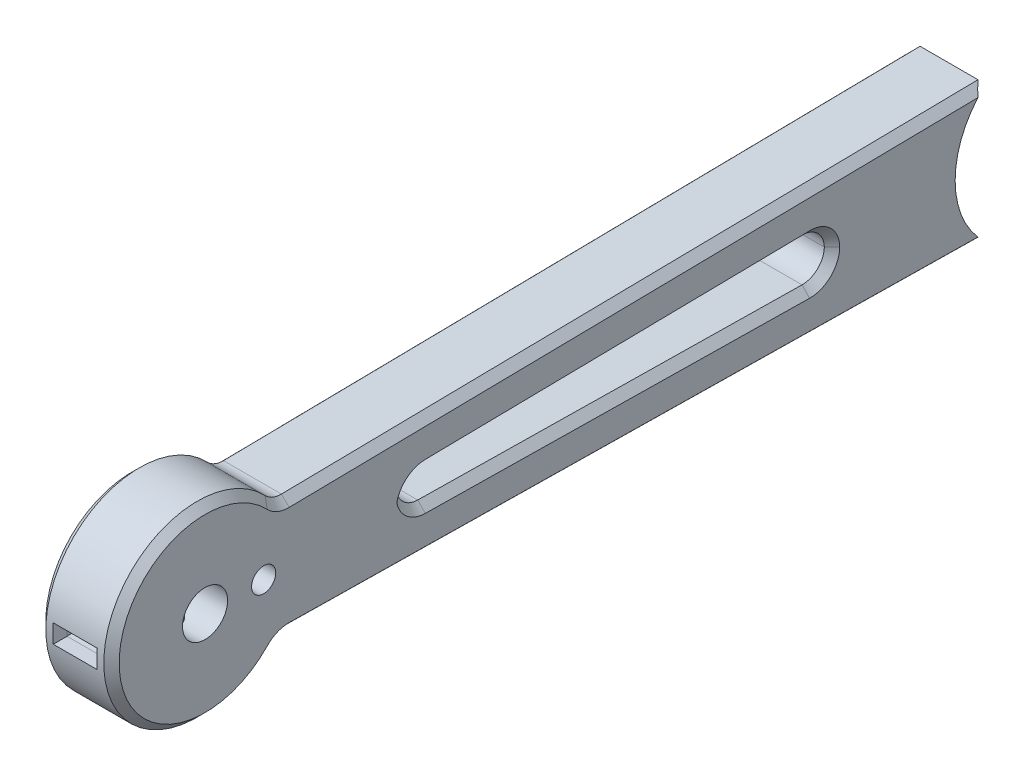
ISO-10303-21;
HEADER;
FILE_DESCRIPTION(('STEP AP214'),'2;1');
FILE_NAME('part.step','',(''),(''),'','','');
FILE_SCHEMA(('AUTOMOTIVE_DESIGN { 1 0 10303 214 1 1 1 1 }'));
ENDSEC;
DATA;
#1=APPLICATION_CONTEXT('core data for automotive mechanical design processes');
#2=APPLICATION_PROTOCOL_DEFINITION('international standard','automotive_design',2000,#1);
#3=PRODUCT_CONTEXT('',#1,'mechanical');
#4=PRODUCT('Part','Part','',(#3));
#5=PRODUCT_RELATED_PRODUCT_CATEGORY('part','',(#4));
#6=PRODUCT_DEFINITION_FORMATION('','',#4);
#7=PRODUCT_DEFINITION_CONTEXT('part definition',#1,'design');
#8=PRODUCT_DEFINITION('design','',#6,#7);
#9=PRODUCT_DEFINITION_SHAPE('','',#8);
#10=(LENGTH_UNIT() NAMED_UNIT(*) SI_UNIT(.MILLI.,.METRE.));
#11=(NAMED_UNIT(*) PLANE_ANGLE_UNIT() SI_UNIT($,.RADIAN.));
#12=(NAMED_UNIT(*) SI_UNIT($,.STERADIAN.) SOLID_ANGLE_UNIT());
#13=UNCERTAINTY_MEASURE_WITH_UNIT(LENGTH_MEASURE(1.E-05),#10,'distance_accuracy_value','');
#14=(GEOMETRIC_REPRESENTATION_CONTEXT(3) GLOBAL_UNCERTAINTY_ASSIGNED_CONTEXT((#13)) GLOBAL_UNIT_ASSIGNED_CONTEXT((#10,
#11,#12)) REPRESENTATION_CONTEXT('',''));
#15=CARTESIAN_POINT('',(0.,0.,0.));
#16=DIRECTION('',(0.,0.,1.));
#17=DIRECTION('',(1.,0.,0.));
#18=AXIS2_PLACEMENT_3D('',#15,#16,#17);
#19=CARTESIAN_POINT('',(0.,0.,106.767792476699));
#20=DIRECTION('',(1.,0.,0.));
#21=DIRECTION('',(0.,0.,-1.));
#22=AXIS2_PLACEMENT_3D('',#19,#20,#21);
#23=CYLINDRICAL_SURFACE('',#22,1.65);
#24=CARTESIAN_POINT('',(10.,0.,106.767792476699));
#25=DIRECTION('',(1.,0.,0.));
#26=DIRECTION('',(0.,0.,-1.));
#27=AXIS2_PLACEMENT_3D('',#24,#25,#26);
#28=CIRCLE('',#27,1.65);
#29=CARTESIAN_POINT('',(10.,0.,105.117792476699));
#30=VERTEX_POINT('',#29);
#31=EDGE_CURVE('E470',#30,#30,#28,.T.);
#32=ORIENTED_EDGE('',*,*,#31,.T.);
#33=EDGE_LOOP('',(#32));
#34=FACE_BOUND('',#33,.T.);
#35=CARTESIAN_POINT('',(2.7,0.,106.767792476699));
#36=DIRECTION('',(-1.,0.,0.));
#37=DIRECTION('',(0.,0.,1.));
#38=AXIS2_PLACEMENT_3D('',#35,#36,#37);
#39=CIRCLE('',#38,1.65);
#40=CARTESIAN_POINT('',(2.7,0.,108.417792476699));
#41=VERTEX_POINT('',#40);
#42=EDGE_CURVE('E48',#41,#41,#39,.F.);
#43=ORIENTED_EDGE('',*,*,#42,.F.);
#44=EDGE_LOOP('',(#43));
#45=FACE_BOUND('',#44,.T.);
#46=ADVANCED_FACE('F43',(#34,#45),#23,.F.);
#47=CARTESIAN_POINT('',(0.,0.,0.));
#48=DIRECTION('',(1.,0.,0.));
#49=DIRECTION('',(0.,0.,-1.));
#50=AXIS2_PLACEMENT_3D('',#47,#48,#49);
#51=PLANE('',#50);
#52=DIRECTION('',(0.,0.881508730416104,-0.472167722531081));
#53=VECTOR('',#52,1.);
#54=CARTESIAN_POINT('',(0.,-0.104799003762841,110.057019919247));
#55=LINE('',#54,#53);
#56=CARTESIAN_POINT('',(0.,-0.104799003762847,110.057019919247));
#57=VERTEX_POINT('',#56);
#58=CARTESIAN_POINT('',(0.,2.79615502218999,108.503164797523));
#59=VERTEX_POINT('',#58);
#60=EDGE_CURVE('E451',#57,#59,#55,.T.);
#61=ORIENTED_EDGE('',*,*,#60,.F.);
#62=DIRECTION('',(0.,0.84966360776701,0.527325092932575));
#63=VECTOR('',#62,1.);
#64=CARTESIAN_POINT('',(0.,-2.90095402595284,108.321647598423));
#65=LINE('',#64,#63);
#66=CARTESIAN_POINT('',(0.,-2.90095402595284,108.321647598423));
#67=VERTEX_POINT('',#66);
#68=EDGE_CURVE('E60',#67,#57,#65,.T.);
#69=ORIENTED_EDGE('',*,*,#68,.F.);
#70=DIRECTION('',(0.,-0.0318451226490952,0.999492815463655));
#71=VECTOR('',#70,1.);
#72=CARTESIAN_POINT('',(0.,-2.79615502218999,105.032420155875));
#73=LINE('',#72,#71);
#74=CARTESIAN_POINT('',(0.,-2.79615502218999,105.032420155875));
#75=VERTEX_POINT('',#74);
#76=EDGE_CURVE('E437',#75,#67,#73,.T.);
#77=ORIENTED_EDGE('',*,*,#76,.F.);
#78=DIRECTION('',(0.,-0.881508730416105,0.472167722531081));
#79=VECTOR('',#78,1.);
#80=CARTESIAN_POINT('',(0.,0.104799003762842,103.478565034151));
#81=LINE('',#80,#79);
#82=CARTESIAN_POINT('',(0.,0.104799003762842,103.478565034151));
#83=VERTEX_POINT('',#82);
#84=EDGE_CURVE('E440',#83,#75,#81,.T.);
#85=ORIENTED_EDGE('',*,*,#84,.F.);
#86=DIRECTION('',(0.,-0.849663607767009,-0.527325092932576));
#87=VECTOR('',#86,1.);
#88=CARTESIAN_POINT('',(0.,2.90095402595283,105.213937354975));
#89=LINE('',#88,#87);
#90=CARTESIAN_POINT('',(0.,2.90095402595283,105.213937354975));
#91=VERTEX_POINT('',#90);
#92=EDGE_CURVE('E456',#91,#83,#89,.T.);
#93=ORIENTED_EDGE('',*,*,#92,.F.);
#94=DIRECTION('',(0.,0.0318451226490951,-0.999492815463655));
#95=VECTOR('',#94,1.);
#96=CARTESIAN_POINT('',(0.,2.79615502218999,108.503164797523));
#97=LINE('',#96,#95);
#98=EDGE_CURVE('E453',#59,#91,#97,.T.);
#99=ORIENTED_EDGE('',*,*,#98,.F.);
#100=EDGE_LOOP('',(#61,#69,#77,#85,#93,#99));
#101=FACE_BOUND('',#100,.T.);
#102=DIRECTION('',(0.,0.0151779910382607,0.999884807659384));
#103=VECTOR('',#102,1.);
#104=CARTESIAN_POINT('',(0.,-5.2878719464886,117.698389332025));
#105=LINE('',#104,#103);
#106=CARTESIAN_POINT('',(0.,-5.37969879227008,111.649086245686));
#107=VERTEX_POINT('',#106);
#108=CARTESIAN_POINT('',(0.,-5.28255964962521,118.048349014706));
#109=VERTEX_POINT('',#108);
#110=EDGE_CURVE('E1045',#107,#109,#105,.T.);
#111=ORIENTED_EDGE('',*,*,#110,.T.);
#112=DIRECTION('',(0.,-0.999884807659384,0.0151779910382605));
#113=VECTOR('',#112,1.);
#114=CARTESIAN_POINT('',(0.,-8.23221983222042,118.093124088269));
#115=LINE('',#114,#113);
#116=CARTESIAN_POINT('',(0.,-8.58217951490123,118.098436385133));
#117=VERTEX_POINT('',#116);
#118=EDGE_CURVE('E1051',#109,#117,#115,.T.);
#119=ORIENTED_EDGE('',*,*,#118,.T.);
#120=DIRECTION('',(0.,-0.0151779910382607,-0.999884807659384));
#121=VECTOR('',#120,1.);
#122=CARTESIAN_POINT('',(0.,-10.3724929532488,0.157451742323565));
#123=LINE('',#122,#121);
#124=CARTESIAN_POINT('',(0.,-8.6793186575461,111.699173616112));
#125=VERTEX_POINT('',#124);
#126=EDGE_CURVE('E1049',#117,#125,#123,.T.);
#127=ORIENTED_EDGE('',*,*,#126,.T.);
#128=DIRECTION('',(0.,0.999884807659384,-0.0151779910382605));
#129=VECTOR('',#128,1.);
#130=CARTESIAN_POINT('',(0.,-5.72965847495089,111.65439854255));
#131=LINE('',#130,#129);
#132=EDGE_CURVE('E1047',#125,#107,#131,.T.);
#133=ORIENTED_EDGE('',*,*,#132,.T.);
#134=EDGE_LOOP('',(#111,#119,#127,#133));
#135=FACE_BOUND('',#134,.T.);
#136=CARTESIAN_POINT('',(0.,0.,114.767792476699));
#137=DIRECTION('',(1.,0.,0.));
#138=DIRECTION('',(0.,0.,-1.));
#139=AXIS2_PLACEMENT_3D('',#136,#137,#138);
#140=CIRCLE('',#139,3.07499999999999);
#141=CARTESIAN_POINT('',(0.,0.,111.692792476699));
#142=VERTEX_POINT('',#141);
#143=EDGE_CURVE('E1269',#142,#142,#140,.T.);
#144=ORIENTED_EDGE('',*,*,#143,.T.);
#145=EDGE_LOOP('',(#144));
#146=FACE_BOUND('',#145,.T.);
#147=CARTESIAN_POINT('',(0.,-0.00137714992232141,114.75925490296));
#148=DIRECTION('',(1.,0.,0.));
#149=DIRECTION('',(0.,0.,-1.));
#150=AXIS2_PLACEMENT_3D('',#147,#148,#149);
#151=CIRCLE('',#150,16.06);
#152=CARTESIAN_POINT('',(0.,6.85310394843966,100.235491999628));
#153=VERTEX_POINT('',#152);
#154=CARTESIAN_POINT('',(0.,-0.0013771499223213,98.6992549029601));
#155=VERTEX_POINT('',#154);
#156=EDGE_CURVE('E1077',#153,#155,#151,.F.);
#157=ORIENTED_EDGE('',*,*,#156,.T.);
#158=CARTESIAN_POINT('',(0.,-0.00137714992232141,114.75925490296));
#159=DIRECTION('',(1.,0.,0.));
#160=DIRECTION('',(0.,0.,-1.));
#161=AXIS2_PLACEMENT_3D('',#158,#159,#160);
#162=CIRCLE('',#161,16.06);
#163=CARTESIAN_POINT('',(0.,-6.85312353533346,100.23420166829));
#164=VERTEX_POINT('',#163);
#165=EDGE_CURVE('E1081',#155,#164,#162,.F.);
#166=ORIENTED_EDGE('',*,*,#165,.T.);
#167=DIRECTION('',(0.,0.0151779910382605,0.999884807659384));
#168=VECTOR('',#167,1.);
#169=CARTESIAN_POINT('',(0.,-8.37272333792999,0.127095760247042));
#170=LINE('',#169,#168);
#171=CARTESIAN_POINT('',(0.,-6.80686715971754,103.281446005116));
#172=VERTEX_POINT('',#171);
#173=EDGE_CURVE('E1207',#164,#172,#170,.T.);
#174=ORIENTED_EDGE('',*,*,#173,.T.);
#175=CARTESIAN_POINT('',(0.,-10.8564006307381,103.342916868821));
#176=DIRECTION('',(1.,0.,0.));
#177=DIRECTION('',(0.,0.,-1.));
#178=AXIS2_PLACEMENT_3D('',#175,#176,#177);
#179=CIRCLE('',#178,4.05000000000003);
#180=CARTESIAN_POINT('',(0.,-8.06659134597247,106.278809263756));
#181=VERTEX_POINT('',#180);
#182=EDGE_CURVE('E1448',#172,#181,#179,.T.);
#183=ORIENTED_EDGE('',*,*,#182,.T.);
#184=CARTESIAN_POINT('',(0.,0.,114.767792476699));
#185=DIRECTION('',(1.,0.,0.));
#186=DIRECTION('',(0.,0.,-1.));
#187=AXIS2_PLACEMENT_3D('',#184,#185,#186);
#188=CIRCLE('',#187,11.710368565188);
#189=CARTESIAN_POINT('',(0.,8.06659134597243,106.278809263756));
#190=VERTEX_POINT('',#189);
#191=EDGE_CURVE('E1446',#181,#190,#188,.F.);
#192=ORIENTED_EDGE('',*,*,#191,.T.);
#193=CARTESIAN_POINT('',(0.,10.856400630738,103.342916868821));
#194=DIRECTION('',(1.,0.,0.));
#195=DIRECTION('',(0.,0.,-1.));
#196=AXIS2_PLACEMENT_3D('',#193,#194,#195);
#197=CIRCLE('',#196,4.05000000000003);
#198=CARTESIAN_POINT('',(0.,6.80686715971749,103.281446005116));
#199=VERTEX_POINT('',#198);
#200=EDGE_CURVE('E1248',#190,#199,#197,.T.);
#201=ORIENTED_EDGE('',*,*,#200,.T.);
#202=DIRECTION('',(0.,0.0151779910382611,-0.999884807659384));
#203=VECTOR('',#202,1.);
#204=CARTESIAN_POINT('',(0.,8.37272333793,0.127095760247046));
#205=LINE('',#204,#203);
#206=EDGE_CURVE('E1442',#199,#153,#205,.T.);
#207=ORIENTED_EDGE('',*,*,#206,.T.);
#208=EDGE_LOOP('',(#157,#166,#174,#183,#192,#201,#207));
#209=FACE_BOUND('',#208,.T.);
#210=ADVANCED_FACE('F930',(#101,#135,#146,#209),#51,.F.);
#211=CARTESIAN_POINT('',(0.7,-0.00137714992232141,114.75925490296));
#212=DIRECTION('',(-1.,0.,0.));
#213=DIRECTION('',(0.,0.,1.));
#214=AXIS2_PLACEMENT_3D('',#211,#212,#213);
#215=PLANE('',#214);
#216=CARTESIAN_POINT('',(0.7,-0.00137714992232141,114.75925490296));
#217=DIRECTION('',(-1.,0.,0.));
#218=DIRECTION('',(0.,0.,1.));
#219=AXIS2_PLACEMENT_3D('',#216,#217,#218);
#220=CIRCLE('',#219,16.76);
#221=CARTESIAN_POINT('',(0.7,-0.701377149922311,98.0138794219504));
#222=VERTEX_POINT('',#221);
#223=CARTESIAN_POINT('',(0.700000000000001,-7.55978951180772,99.80037785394));
#224=VERTEX_POINT('',#223);
#225=EDGE_CURVE('E477',#222,#224,#220,.T.);
#226=ORIENTED_EDGE('',*,*,#225,.F.);
#227=DIRECTION('',(0.,0.,-1.));
#228=VECTOR('',#227,1.);
#229=CARTESIAN_POINT('',(0.7,-0.701377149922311,0.));
#230=LINE('',#229,#228);
#231=CARTESIAN_POINT('',(0.7,-0.701377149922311,93.8109470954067));
#232=VERTEX_POINT('',#231);
#233=EDGE_CURVE('E1074',#222,#232,#230,.T.);
#234=ORIENTED_EDGE('',*,*,#233,.T.);
#235=CARTESIAN_POINT('',(0.7,-0.00137714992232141,114.75925490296));
#236=DIRECTION('',(-1.,0.,0.));
#237=DIRECTION('',(0.,0.,1.));
#238=AXIS2_PLACEMENT_3D('',#235,#236,#237);
#239=CIRCLE('',#238,20.96);
#240=CARTESIAN_POINT('',(0.7,-7.62906875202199,95.2364497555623));
#241=VERTEX_POINT('',#240);
#242=EDGE_CURVE('E476',#232,#241,#239,.T.);
#243=ORIENTED_EDGE('',*,*,#242,.T.);
#244=DIRECTION('',(0.,0.0151779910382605,0.999884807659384));
#245=VECTOR('',#244,1.);
#246=CARTESIAN_POINT('',(0.7,-8.82313112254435,16.5748653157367));
#247=LINE('',#246,#245);
#248=EDGE_CURVE('E1060',#224,#241,#247,.F.);
#249=ORIENTED_EDGE('',*,*,#248,.F.);
#250=EDGE_LOOP('',(#226,#234,#243,#249));
#251=FACE_BOUND('',#250,.T.);
#252=ADVANCED_FACE('F936',(#251),#215,.T.);
#253=CARTESIAN_POINT('',(4.99999999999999,-12.9510833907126,114.964386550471));
#254=DIRECTION('',(0.,0.999884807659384,-0.0151779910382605));
#255=DIRECTION('',(0.,0.0151779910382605,0.999884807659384));
#256=AXIS2_PLACEMENT_3D('',#253,#254,#255);
#257=CYLINDRICAL_SURFACE('',#256,1.6);
#258=CARTESIAN_POINT('',(4.99999999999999,-8.28078940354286,114.893492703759));
#259=DIRECTION('',(0.,-0.999884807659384,0.0151779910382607));
#260=DIRECTION('',(0.,-0.0151779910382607,-0.999884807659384));
#261=AXIS2_PLACEMENT_3D('',#258,#259,#260);
#262=CIRCLE('',#261,1.6);
#263=CARTESIAN_POINT('',(4.99999999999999,-8.30507418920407,113.293677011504));
#264=VERTEX_POINT('',#263);
#265=EDGE_CURVE('E526',#264,#264,#262,.T.);
#266=ORIENTED_EDGE('',*,*,#265,.F.);
#267=EDGE_LOOP('',(#266));
#268=FACE_BOUND('',#267,.T.);
#269=CARTESIAN_POINT('',(4.99999999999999,-11.6803977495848,114.945097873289));
#270=DIRECTION('',(0.,-0.999884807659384,0.0151779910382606));
#271=DIRECTION('',(0.,-0.0151779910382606,-0.999884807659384));
#272=AXIS2_PLACEMENT_3D('',#269,#270,#271);
#273=CIRCLE('',#272,1.6);
#274=CARTESIAN_POINT('',(4.99999999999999,-11.704682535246,113.345282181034));
#275=VERTEX_POINT('',#274);
#276=EDGE_CURVE('E488',#275,#275,#273,.T.);
#277=ORIENTED_EDGE('',*,*,#276,.T.);
#278=EDGE_LOOP('',(#277));
#279=FACE_BOUND('',#278,.T.);
#280=ADVANCED_FACE('F779',(#268,#279),#257,.F.);
#281=CARTESIAN_POINT('',(4.99999999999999,-2.60136493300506,116.407464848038));
#282=CARTESIAN_POINT('',(4.91716698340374,-2.60137308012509,116.407458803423));
#283=CARTESIAN_POINT('',(4.83424169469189,-2.6054426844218,116.401049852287));
#284=CARTESIAN_POINT('',(4.67098015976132,-2.62112343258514,116.375755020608));
#285=CARTESIAN_POINT('',(4.59064922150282,-2.63274912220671,116.356845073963));
#286=CARTESIAN_POINT('',(4.43525220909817,-2.6618471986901,116.307597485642));
#287=CARTESIAN_POINT('',(4.3601591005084,-2.67928638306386,116.277324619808));
#288=CARTESIAN_POINT('',(4.21618288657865,-2.71803170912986,116.206388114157));
#289=CARTESIAN_POINT('',(4.14730053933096,-2.73933832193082,116.165723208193));
#290=CARTESIAN_POINT('',(4.01088488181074,-2.7857987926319,116.070857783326));
#291=CARTESIAN_POINT('',(3.94402743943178,-2.81112631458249,116.015770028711));
#292=CARTESIAN_POINT('',(3.82003160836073,-2.86152877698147,115.895416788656));
#293=CARTESIAN_POINT('',(3.76289842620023,-2.88660357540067,115.830145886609));
#294=CARTESIAN_POINT('',(3.65579660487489,-2.93599262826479,115.685313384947));
#295=CARTESIAN_POINT('',(3.60667884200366,-2.96011104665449,115.605049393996));
#296=CARTESIAN_POINT('',(3.52301471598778,-3.00280543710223,115.435901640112));
#297=CARTESIAN_POINT('',(3.4884584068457,-3.02138518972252,115.347023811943));
#298=CARTESIAN_POINT('',(3.4376404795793,-3.04975337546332,115.17030771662));
#299=CARTESIAN_POINT('',(3.42018800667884,-3.06010265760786,115.082903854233));
#300=CARTESIAN_POINT('',(3.40013140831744,-3.07317720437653,114.905867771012));
#301=CARTESIAN_POINT('',(3.39751742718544,-3.07590752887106,114.816237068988));
#302=CARTESIAN_POINT('',(3.40679851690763,-3.07366441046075,114.646329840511));
#303=CARTESIAN_POINT('',(3.41735298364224,-3.06939091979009,114.565965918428));
#304=CARTESIAN_POINT('',(3.45024429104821,-3.05493488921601,114.408251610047));
#305=CARTESIAN_POINT('',(3.47258202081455,-3.04475190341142,114.330901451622));
#306=CARTESIAN_POINT('',(3.52849839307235,-3.01930811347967,114.180145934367));
#307=CARTESIAN_POINT('',(3.56221732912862,-3.00398395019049,114.106803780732));
#308=CARTESIAN_POINT('',(3.6397176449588,-2.96966757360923,113.96659531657));
#309=CARTESIAN_POINT('',(3.68350250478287,-2.95067409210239,113.899731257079));
#310=CARTESIAN_POINT('',(3.7849097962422,-2.90857845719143,113.767243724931));
#311=CARTESIAN_POINT('',(3.84347867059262,-2.8852553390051,113.70241449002));
#312=CARTESIAN_POINT('',(3.97028335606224,-2.83832925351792,113.583041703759));
#313=CARTESIAN_POINT('',(4.03852757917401,-2.81472605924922,113.528507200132));
#314=CARTESIAN_POINT('',(4.18879416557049,-2.76807309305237,113.427374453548));
#315=CARTESIAN_POINT('',(4.27145821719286,-2.74518903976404,113.381644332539));
#316=CARTESIAN_POINT('',(4.44472989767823,-2.70521744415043,113.305156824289));
#317=CARTESIAN_POINT('',(4.5353286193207,-2.68812350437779,113.274382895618));
#318=CARTESIAN_POINT('',(4.71425647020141,-2.66372007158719,113.231305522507));
#319=CARTESIAN_POINT('',(4.80217791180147,-2.6557318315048,113.217711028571));
#320=CARTESIAN_POINT('',(4.9793823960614,-2.64856411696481,113.205488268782));
#321=CARTESIAN_POINT('',(5.06866420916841,-2.64937711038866,113.20684720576));
#322=CARTESIAN_POINT('',(5.23428825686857,-2.65899330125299,113.22330535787));
#323=CARTESIAN_POINT('',(5.31086953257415,-2.66679978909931,113.236691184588));
#324=CARTESIAN_POINT('',(5.4605472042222,-2.68798210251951,113.274193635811));
#325=CARTESIAN_POINT('',(5.53364232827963,-2.70135994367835,113.298314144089));
#326=CARTESIAN_POINT('',(5.67807899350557,-2.73284752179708,113.357706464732));
#327=CARTESIAN_POINT('',(5.74919022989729,-2.75114452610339,113.393434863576));
#328=CARTESIAN_POINT('',(5.88487543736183,-2.79022436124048,113.474617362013));
#329=CARTESIAN_POINT('',(5.94944602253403,-2.81100846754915,113.520076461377));
#330=CARTESIAN_POINT('',(6.07959645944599,-2.85612726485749,113.626758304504));
#331=CARTESIAN_POINT('',(6.14407387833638,-2.88055455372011,113.689292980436));
#332=CARTESIAN_POINT('',(6.26206753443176,-2.9276515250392,113.824599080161));
#333=CARTESIAN_POINT('',(6.31557904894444,-2.950320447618,113.897374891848));
#334=CARTESIAN_POINT('',(6.4117914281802,-2.99226046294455,114.054467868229));
#335=CARTESIAN_POINT('',(6.454045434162,-3.01138385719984,114.139101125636));
#336=CARTESIAN_POINT('',(6.52332908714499,-3.04287657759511,114.31554412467));
#337=CARTESIAN_POINT('',(6.55037315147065,-3.05525229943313,114.407346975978));
#338=CARTESIAN_POINT('',(6.58596732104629,-3.07080145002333,114.585977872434));
#339=CARTESIAN_POINT('',(6.59604705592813,-3.0747460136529,114.672434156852));
#340=CARTESIAN_POINT('',(6.60203937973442,-3.07522963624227,114.845844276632));
#341=CARTESIAN_POINT('',(6.59795782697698,-3.07177175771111,114.932797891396));
#342=CARTESIAN_POINT('',(6.57670256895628,-3.05827357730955,115.097845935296));
#343=CARTESIAN_POINT('',(6.56053352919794,-3.04874630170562,115.176115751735));
#344=CARTESIAN_POINT('',(6.51699120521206,-3.0244155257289,115.328595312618));
#345=CARTESIAN_POINT('',(6.48961643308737,-3.00961132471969,115.402804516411));
#346=CARTESIAN_POINT('',(6.42334058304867,-2.97524016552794,115.548429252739));
#347=CARTESIAN_POINT('',(6.38402230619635,-2.95550640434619,115.619614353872));
#348=CARTESIAN_POINT('',(6.29548983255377,-2.91321784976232,115.754604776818));
#349=CARTESIAN_POINT('',(6.24627121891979,-2.89066179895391,115.818406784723));
#350=CARTESIAN_POINT('',(6.13329515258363,-2.84203085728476,115.94401015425));
#351=CARTESIAN_POINT('',(6.06854826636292,-2.81583682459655,116.004877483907));
#352=CARTESIAN_POINT('',(5.92947140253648,-2.76470373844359,116.115290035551));
#353=CARTESIAN_POINT('',(5.85513181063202,-2.73976597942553,116.164823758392));
#354=CARTESIAN_POINT('',(5.69471849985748,-2.69292306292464,116.253189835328));
#355=CARTESIAN_POINT('',(5.60826843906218,-2.67120366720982,116.291443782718));
#356=CARTESIAN_POINT('',(5.42868233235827,-2.63552577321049,116.352375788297));
#357=CARTESIAN_POINT('',(5.33556957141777,-2.62154160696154,116.3751054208));
#358=CARTESIAN_POINT('',(5.20109753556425,-2.60893610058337,116.395402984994));
#359=CARTESIAN_POINT('',(5.16107295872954,-2.60610903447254,116.399917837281));
#360=CARTESIAN_POINT('',(5.0807062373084,-2.60232141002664,116.405950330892));
#361=CARTESIAN_POINT('',(5.04036407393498,-2.60136096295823,116.407467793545));
#362=CARTESIAN_POINT('',(4.99999999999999,-2.60136493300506,116.407464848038));
#363=B_SPLINE_CURVE_WITH_KNOTS('',3,(#281,#282,#283,#284,#285,#286,#287,#288,#289,#290,#291,
#292,#293,#294,#295,#296,#297,#298,#299,#300,#301,#302,#303,#304,#305,#306,#307,#308,#309,#310,
#311,#312,#313,#314,#315,#316,#317,#318,#319,#320,#321,#322,#323,#324,#325,#326,#327,#328,#329,
#330,#331,#332,#333,#334,#335,#336,#337,#338,#339,#340,#341,#342,#343,#344,#345,#346,#347,#348,
#349,#350,#351,#352,#353,#354,#355,#356,#357,#358,#359,#360,#361,#362),.UNSPECIFIED.,.T.,.F.,(4,
2,2,2,2,2,2,2,2,2,2,2,2,2,2,2,2,2,2,2,2,2,2,2,2,2,2,2,2,2,2,2,2,2,2,2,2,2,2,2,4),(0.,
0.248328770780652,0.497137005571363,0.744547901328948,0.99198895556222,1.26163676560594,
1.53142849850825,1.82131996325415,2.11101309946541,2.37868832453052,2.64618573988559,
2.88854125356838,3.13091505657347,3.37639282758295,3.62195559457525,3.89210047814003,
4.16248168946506,4.45256943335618,4.74233560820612,5.00869841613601,5.27483328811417,
5.50818110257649,5.74161341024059,5.98564441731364,6.22980111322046,6.50782565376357,
6.785969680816,7.07390477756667,7.36156648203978,7.6215380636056,7.8814021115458,
8.12178023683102,8.36219028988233,8.61221536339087,8.86235222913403,9.1390853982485,
9.41609810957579,9.70551310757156,9.99396188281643,10.1149639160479,10.2359731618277),.UNSPECIFIED.);
#364=CARTESIAN_POINT('',(4.99999999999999,-2.60136493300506,116.407464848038));
#365=VERTEX_POINT('',#364);
#366=EDGE_CURVE('E572',#365,#365,#363,.T.);
#367=ORIENTED_EDGE('',*,*,#366,.F.);
#368=EDGE_LOOP('',(#367));
#369=FACE_BOUND('',#368,.T.);
#370=CARTESIAN_POINT('',(4.99999999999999,-5.68108890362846,114.85402992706));
#371=DIRECTION('',(0.,-0.999884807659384,0.0151779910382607));
#372=DIRECTION('',(0.,-0.0151779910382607,-0.999884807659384));
#373=AXIS2_PLACEMENT_3D('',#370,#371,#372);
#374=CIRCLE('',#373,1.6);
#375=CARTESIAN_POINT('',(4.99999999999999,-5.70537368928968,113.254214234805));
#376=VERTEX_POINT('',#375);
#377=EDGE_CURVE('E521',#376,#376,#374,.T.);
#378=ORIENTED_EDGE('',*,*,#377,.T.);
#379=EDGE_LOOP('',(#378));
#380=FACE_BOUND('',#379,.T.);
#381=ADVANCED_FACE('F780',(#369,#380),#257,.F.);
#382=CARTESIAN_POINT('',(10.,0.,114.767792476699));
#383=DIRECTION('',(-1.,0.,0.));
#384=DIRECTION('',(0.,0.,1.));
#385=AXIS2_PLACEMENT_3D('',#382,#383,#384);
#386=CYLINDRICAL_SURFACE('',#385,12.7603685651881);
#387=CARTESIAN_POINT('',(4.99999999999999,-12.4468068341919,111.956386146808));
#388=CARTESIAN_POINT('',(4.834006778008,-12.4468100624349,111.956391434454));
#389=CARTESIAN_POINT('',(4.66795323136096,-12.4499653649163,111.970259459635));
#390=CARTESIAN_POINT('',(4.34059185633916,-12.462200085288,112.02528612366));
#391=CARTESIAN_POINT('',(4.17928718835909,-12.4712833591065,112.066462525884));
#392=CARTESIAN_POINT('',(3.86620602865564,-12.49423636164,112.17470566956));
#393=CARTESIAN_POINT('',(3.71441840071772,-12.5081003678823,112.241741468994));
#394=CARTESIAN_POINT('',(3.42419712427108,-12.5389610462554,112.399690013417));
#395=CARTESIAN_POINT('',(3.28576363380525,-12.555957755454,112.490603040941));
#396=CARTESIAN_POINT('',(3.02348223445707,-12.5914245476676,112.695592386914));
#397=CARTESIAN_POINT('',(2.89993268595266,-12.6099152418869,112.810046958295));
#398=CARTESIAN_POINT('',(2.67354718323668,-12.6459233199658,113.05802627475));
#399=CARTESIAN_POINT('',(2.57071299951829,-12.6634406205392,113.19155264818));
#400=CARTESIAN_POINT('',(2.38747644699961,-12.6956163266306,113.475887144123));
#401=CARTESIAN_POINT('',(2.30736418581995,-12.7102370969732,113.626886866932));
#402=CARTESIAN_POINT('',(2.17372720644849,-12.7344994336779,113.940600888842));
#403=CARTESIAN_POINT('',(2.12019903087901,-12.7441416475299,114.103313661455));
#404=CARTESIAN_POINT('',(2.04219690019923,-12.7570134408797,114.432710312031));
#405=CARTESIAN_POINT('',(2.01721707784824,-12.7603553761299,114.599269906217));
#406=CARTESIAN_POINT('',(1.99543592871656,-12.7603816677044,114.934212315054));
#407=CARTESIAN_POINT('',(1.99863089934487,-12.7570668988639,115.102594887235));
#408=CARTESIAN_POINT('',(2.03273844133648,-12.7440742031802,115.432908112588));
#409=CARTESIAN_POINT('',(2.06310537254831,-12.7345225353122,115.594900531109));
#410=CARTESIAN_POINT('',(2.14982150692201,-12.7100161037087,115.911338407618));
#411=CARTESIAN_POINT('',(2.20617199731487,-12.6950610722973,116.065783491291));
#412=CARTESIAN_POINT('',(2.34371719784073,-12.6610092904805,116.364230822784));
#413=CARTESIAN_POINT('',(2.42511227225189,-12.6418795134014,116.508136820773));
#414=CARTESIAN_POINT('',(2.61028547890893,-12.601403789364,116.780403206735));
#415=CARTESIAN_POINT('',(2.71406709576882,-12.580057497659,116.908761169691));
#416=CARTESIAN_POINT('',(2.94401533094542,-12.5367287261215,117.149553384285));
#417=CARTESIAN_POINT('',(3.07065923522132,-12.5147432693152,117.261531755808));
#418=CARTESIAN_POINT('',(3.34119381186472,-12.4729562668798,117.462780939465));
#419=CARTESIAN_POINT('',(3.48508511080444,-12.4531548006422,117.552050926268));
#420=CARTESIAN_POINT('',(3.78684605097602,-12.4178274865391,117.705619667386));
#421=CARTESIAN_POINT('',(3.94476753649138,-12.4023184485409,117.769820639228));
#422=CARTESIAN_POINT('',(4.26962163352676,-12.3774635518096,117.870715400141));
#423=CARTESIAN_POINT('',(4.4365525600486,-12.3681165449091,117.907414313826));
#424=CARTESIAN_POINT('',(4.77049060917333,-12.3568292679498,117.951546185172));
#425=CARTESIAN_POINT('',(4.93740407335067,-12.3547203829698,117.95964551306));
#426=CARTESIAN_POINT('',(5.27020186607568,-12.3576805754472,117.94816531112));
#427=CARTESIAN_POINT('',(5.43608627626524,-12.3627490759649,117.928588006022));
#428=CARTESIAN_POINT('',(5.7597103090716,-12.3793584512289,117.862885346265));
#429=CARTESIAN_POINT('',(5.91753171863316,-12.3908072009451,117.817137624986));
#430=CARTESIAN_POINT('',(6.2232397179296,-12.418859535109,117.700793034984));
#431=CARTESIAN_POINT('',(6.37112523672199,-12.4354636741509,117.630193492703));
#432=CARTESIAN_POINT('',(6.65562732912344,-12.4724091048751,117.464698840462));
#433=CARTESIAN_POINT('',(6.7920003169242,-12.4928109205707,117.369398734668));
#434=CARTESIAN_POINT('',(7.04701416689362,-12.5350291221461,117.157703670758));
#435=CARTESIAN_POINT('',(7.16565246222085,-12.5568457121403,117.041305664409));
#436=CARTESIAN_POINT('',(7.3844826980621,-12.6001607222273,116.787652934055));
#437=CARTESIAN_POINT('',(7.48421519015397,-12.6216417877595,116.649998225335));
#438=CARTESIAN_POINT('',(7.6590913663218,-12.6615587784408,116.359459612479));
#439=CARTESIAN_POINT('',(7.73423628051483,-12.6799948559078,116.206576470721));
#440=CARTESIAN_POINT('',(7.85719328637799,-12.7118276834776,115.890916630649));
#441=CARTESIAN_POINT('',(7.90519209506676,-12.7252586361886,115.728216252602));
#442=CARTESIAN_POINT('',(7.9730672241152,-12.7459430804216,115.396678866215));
#443=CARTESIAN_POINT('',(7.99294830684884,-12.7531976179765,115.227842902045));
#444=CARTESIAN_POINT('',(8.00378196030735,-12.7608245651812,114.893157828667));
#445=CARTESIAN_POINT('',(7.99541633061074,-12.7613577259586,114.727334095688));
#446=CARTESIAN_POINT('',(7.95153765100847,-12.7561047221,114.39943073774));
#447=CARTESIAN_POINT('',(7.91602524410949,-12.7503187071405,114.237351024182));
#448=CARTESIAN_POINT('',(7.8192083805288,-12.7332931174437,113.922169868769));
#449=CARTESIAN_POINT('',(7.75801425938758,-12.7220768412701,113.769033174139));
#450=CARTESIAN_POINT('',(7.61167387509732,-12.6955757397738,113.475054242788));
#451=CARTESIAN_POINT('',(7.5265249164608,-12.6802904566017,113.33421339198));
#452=CARTESIAN_POINT('',(7.33254176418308,-12.6470606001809,113.065558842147));
#453=CARTESIAN_POINT('',(7.22323648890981,-12.6290657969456,112.93809148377));
#454=CARTESIAN_POINT('',(6.98497581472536,-12.5927796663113,112.703069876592));
#455=CARTESIAN_POINT('',(6.8560155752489,-12.5744882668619,112.595520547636));
#456=CARTESIAN_POINT('',(6.57962453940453,-12.5394845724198,112.401739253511));
#457=CARTESIAN_POINT('',(6.43193144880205,-12.5228021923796,112.315875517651));
#458=CARTESIAN_POINT('',(6.12385554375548,-12.4934394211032,112.170384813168));
#459=CARTESIAN_POINT('',(5.96348283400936,-12.4807558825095,112.110737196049));
#460=CARTESIAN_POINT('',(5.66930062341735,-12.4630728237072,112.029151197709));
#461=CARTESIAN_POINT('',(5.53699716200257,-12.4570183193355,112.001920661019));
#462=CARTESIAN_POINT('',(5.26980897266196,-12.4488841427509,111.965536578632));
#463=CARTESIAN_POINT('',(5.13492441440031,-12.4468042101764,111.956381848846));
#464=CARTESIAN_POINT('',(4.99999999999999,-12.4468068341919,111.956386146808));
#465=B_SPLINE_CURVE_WITH_KNOTS('',3,(#387,#388,#389,#390,#391,#392,#393,#394,#395,#396,#397,
#398,#399,#400,#401,#402,#403,#404,#405,#406,#407,#408,#409,#410,#411,#412,#413,#414,#415,#416,
#417,#418,#419,#420,#421,#422,#423,#424,#425,#426,#427,#428,#429,#430,#431,#432,#433,#434,#435,
#436,#437,#438,#439,#440,#441,#442,#443,#444,#445,#446,#447,#448,#449,#450,#451,#452,#453,#454,
#455,#456,#457,#458,#459,#460,#461,#462,#463,#464),.UNSPECIFIED.,.T.,.F.,(4,2,2,2,2,2,2,2,2,2,2,
2,2,2,2,2,2,2,2,2,2,2,2,2,2,2,2,2,2,2,2,2,2,2,2,2,2,2,4),(0.,0.497484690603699,
0.995293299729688,1.49250809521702,1.98972877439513,2.4956691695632,3.00165278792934,
3.51383240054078,4.02594538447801,4.52883590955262,5.03166034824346,5.52460869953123,
6.01758147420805,6.5146055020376,7.01170695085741,7.5207338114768,8.02977916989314,
8.5407907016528,9.05170699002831,9.55063738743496,10.0495276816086,10.5413944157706,
11.0333140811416,11.5338749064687,12.0345081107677,12.5460749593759,13.0576162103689,
13.5655947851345,14.0734873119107,14.5692091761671,15.0649192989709,15.5585211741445,
16.0521786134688,16.5564795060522,17.060904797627,17.5733931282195,18.0854770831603,
18.4898744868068,18.8942453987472),.UNSPECIFIED.);
#466=CARTESIAN_POINT('',(4.99999999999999,-12.4468068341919,111.956386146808));
#467=VERTEX_POINT('',#466);
#468=EDGE_CURVE('E506',#467,#467,#465,.T.);
#469=ORIENTED_EDGE('',*,*,#468,.T.);
#470=EDGE_LOOP('',(#469));
#471=FACE_BOUND('',#470,.T.);
#472=CARTESIAN_POINT('',(2.,0.,114.767792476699));
#473=DIRECTION('',(-1.,0.,0.));
#474=DIRECTION('',(0.,-1.,0.));
#475=AXIS2_PLACEMENT_3D('',#472,#473,#474);
#476=CIRCLE('',#475,12.7603685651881);
#477=CARTESIAN_POINT('',(1.99999999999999,-1.27623481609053,127.464178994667));
#478=VERTEX_POINT('',#477);
#479=CARTESIAN_POINT('',(2.00000000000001,1.25974688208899,127.465825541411));
#480=VERTEX_POINT('',#479);
#481=EDGE_CURVE('E1231',#478,#480,#476,.T.);
#482=ORIENTED_EDGE('',*,*,#481,.T.);
#483=DIRECTION('',(-1.,0.,0.));
#484=VECTOR('',#483,1.);
#485=CARTESIAN_POINT('',(10.,1.25974688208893,127.465825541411));
#486=LINE('',#485,#484);
#487=CARTESIAN_POINT('',(8.00000000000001,1.25974688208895,127.465825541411));
#488=VERTEX_POINT('',#487);
#489=EDGE_CURVE('E1411',#480,#488,#486,.F.);
#490=ORIENTED_EDGE('',*,*,#489,.T.);
#491=CARTESIAN_POINT('',(8.,0.,114.767792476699));
#492=DIRECTION('',(1.,0.,0.));
#493=DIRECTION('',(0.,1.,0.));
#494=AXIS2_PLACEMENT_3D('',#491,#492,#493);
#495=CIRCLE('',#494,12.7603685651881);
#496=CARTESIAN_POINT('',(7.99999999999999,-1.27623481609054,127.464178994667));
#497=VERTEX_POINT('',#496);
#498=EDGE_CURVE('E1405',#488,#497,#495,.T.);
#499=ORIENTED_EDGE('',*,*,#498,.T.);
#500=DIRECTION('',(-1.,0.,0.));
#501=VECTOR('',#500,1.);
#502=CARTESIAN_POINT('',(10.,-1.27623481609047,127.464178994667));
#503=LINE('',#502,#501);
#504=EDGE_CURVE('E1408',#497,#478,#503,.T.);
#505=ORIENTED_EDGE('',*,*,#504,.T.);
#506=EDGE_LOOP('',(#482,#490,#499,#505));
#507=FACE_BOUND('',#506,.T.);
#508=DIRECTION('',(-1.,0.,0.));
#509=VECTOR('',#508,1.);
#510=CARTESIAN_POINT('',(10.,8.78987523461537,105.51765197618));
#511=LINE('',#510,#509);
#512=CARTESIAN_POINT('',(8.95000000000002,8.78987523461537,105.51765197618));
#513=VERTEX_POINT('',#512);
#514=CARTESIAN_POINT('',(1.05000000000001,8.78987523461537,105.51765197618));
#515=VERTEX_POINT('',#514);
#516=EDGE_CURVE('E1234',#513,#515,#511,.T.);
#517=ORIENTED_EDGE('',*,*,#516,.T.);
#518=CARTESIAN_POINT('',(1.05000000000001,0.,114.767792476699));
#519=DIRECTION('',(1.,0.,0.));
#520=DIRECTION('',(0.,0.,-1.));
#521=AXIS2_PLACEMENT_3D('',#518,#519,#520);
#522=CIRCLE('',#521,12.7603685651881);
#523=CARTESIAN_POINT('',(1.05000000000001,-8.78987523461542,105.51765197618));
#524=VERTEX_POINT('',#523);
#525=EDGE_CURVE('E1238',#515,#524,#522,.T.);
#526=ORIENTED_EDGE('',*,*,#525,.T.);
#527=DIRECTION('',(-1.,0.,0.));
#528=VECTOR('',#527,1.);
#529=CARTESIAN_POINT('',(10.,-8.78987523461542,105.51765197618));
#530=LINE('',#529,#528);
#531=CARTESIAN_POINT('',(8.95000000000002,-8.78987523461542,105.51765197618));
#532=VERTEX_POINT('',#531);
#533=EDGE_CURVE('E1244',#524,#532,#530,.F.);
#534=ORIENTED_EDGE('',*,*,#533,.T.);
#535=CARTESIAN_POINT('',(8.95000000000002,0.,114.767792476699));
#536=DIRECTION('',(1.,0.,0.));
#537=DIRECTION('',(0.,0.,-1.));
#538=AXIS2_PLACEMENT_3D('',#535,#536,#537);
#539=CIRCLE('',#538,12.7603685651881);
#540=EDGE_CURVE('E1241',#532,#513,#539,.F.);
#541=ORIENTED_EDGE('',*,*,#540,.T.);
#542=EDGE_LOOP('',(#517,#526,#534,#541));
#543=FACE_BOUND('',#542,.T.);
#544=ADVANCED_FACE('F756',(#471,#507,#543),#386,.T.);
#545=CARTESIAN_POINT('',(10.,0.,114.767792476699));
#546=DIRECTION('',(-1.,0.,0.));
#547=DIRECTION('',(0.,0.,1.));
#548=AXIS2_PLACEMENT_3D('',#545,#546,#547);
#549=CYLINDRICAL_SURFACE('',#548,3.07499999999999);
#550=CARTESIAN_POINT('',(4.99999999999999,2.6499345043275,116.32775148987));
#551=CARTESIAN_POINT('',(5.08283301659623,2.64994246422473,116.327745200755));
#552=CARTESIAN_POINT('',(5.16575830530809,2.65381566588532,116.321215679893));
#553=CARTESIAN_POINT('',(5.32901984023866,2.66872142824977,116.295456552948));
#554=CARTESIAN_POINT('',(5.40935077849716,2.6797677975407,116.276202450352));
#555=CARTESIAN_POINT('',(5.56474779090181,2.70735768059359,116.226094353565));
#556=CARTESIAN_POINT('',(5.63984089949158,2.72386997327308,116.19530611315));
#557=CARTESIAN_POINT('',(5.78381711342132,2.76044434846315,116.123226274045));
#558=CARTESIAN_POINT('',(5.85269946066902,2.78050686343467,116.081933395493));
#559=CARTESIAN_POINT('',(5.98911511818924,2.82406652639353,115.985701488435));
#560=CARTESIAN_POINT('',(6.0559725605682,2.84771032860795,115.92987036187));
#561=CARTESIAN_POINT('',(6.17996839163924,2.89443654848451,115.808042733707));
#562=CARTESIAN_POINT('',(6.23710157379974,2.91751865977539,115.74204082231));
#563=CARTESIAN_POINT('',(6.34420339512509,2.9624889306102,115.595775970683));
#564=CARTESIAN_POINT('',(6.39332115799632,2.98416002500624,115.51481690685));
#565=CARTESIAN_POINT('',(6.4769852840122,3.02170068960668,115.344451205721));
#566=CARTESIAN_POINT('',(6.51154159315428,3.03757421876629,115.255050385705));
#567=CARTESIAN_POINT('',(6.56235952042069,3.06056556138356,115.077554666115));
#568=CARTESIAN_POINT('',(6.57981199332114,3.06825715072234,114.989876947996));
#569=CARTESIAN_POINT('',(6.59986859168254,3.07595218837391,114.812525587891));
#570=CARTESIAN_POINT('',(6.60248257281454,3.0759607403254,114.722853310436));
#571=CARTESIAN_POINT('',(6.59320148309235,3.06856154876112,114.553092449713));
#572=CARTESIAN_POINT('',(6.58264701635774,3.06185078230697,114.472895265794));
#573=CARTESIAN_POINT('',(6.54975570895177,3.04261439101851,114.315692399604));
#574=CARTESIAN_POINT('',(6.52741797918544,3.03008832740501,114.238686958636));
#575=CARTESIAN_POINT('',(6.47150160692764,3.00008045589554,114.088773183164));
#576=CARTESIAN_POINT('',(6.43778267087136,2.98253723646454,114.015929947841));
#577=CARTESIAN_POINT('',(6.36028235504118,2.94398099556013,113.876827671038));
#578=CARTESIAN_POINT('',(6.31649749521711,2.92296677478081,113.810570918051));
#579=CARTESIAN_POINT('',(6.21509020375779,2.87686920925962,113.679422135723));
#580=CARTESIAN_POINT('',(6.15652132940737,2.85158910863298,113.615330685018));
#581=CARTESIAN_POINT('',(6.02971664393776,2.80106138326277,113.497437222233));
#582=CARTESIAN_POINT('',(5.96147242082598,2.77581380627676,113.443644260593));
#583=CARTESIAN_POINT('',(5.81120583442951,2.72611270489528,113.343974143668));
#584=CARTESIAN_POINT('',(5.72854178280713,2.7018511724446,113.298959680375));
#585=CARTESIAN_POINT('',(5.55527010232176,2.65957640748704,113.223720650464));
#586=CARTESIAN_POINT('',(5.46467138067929,2.64155627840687,113.193479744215));
#587=CARTESIAN_POINT('',(5.28574352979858,2.6158565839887,113.151162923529));
#588=CARTESIAN_POINT('',(5.19782208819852,2.60745939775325,113.137817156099));
#589=CARTESIAN_POINT('',(5.02061760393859,2.59992399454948,113.125817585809));
#590=CARTESIAN_POINT('',(4.93133579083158,2.60077786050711,113.127151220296));
#591=CARTESIAN_POINT('',(4.76571174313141,2.61088916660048,113.143309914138));
#592=CARTESIAN_POINT('',(4.68913046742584,2.61909835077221,113.156452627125));
#593=CARTESIAN_POINT('',(4.53945279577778,2.64140919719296,113.193294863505));
#594=CARTESIAN_POINT('',(4.46635767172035,2.65551299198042,113.216998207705));
#595=CARTESIAN_POINT('',(4.32192100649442,2.68878876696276,113.275407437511));
#596=CARTESIAN_POINT('',(4.25080977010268,2.70816178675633,113.310564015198));
#597=CARTESIAN_POINT('',(4.11512456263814,2.74968770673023,113.390522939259));
#598=CARTESIAN_POINT('',(4.05055397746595,2.77184203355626,113.435330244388));
#599=CARTESIAN_POINT('',(3.92040354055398,2.82017810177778,113.540593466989));
#600=CARTESIAN_POINT('',(3.8559261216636,2.84649221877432,113.602357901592));
#601=CARTESIAN_POINT('',(3.73793246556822,2.89767436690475,113.736172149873));
#602=CARTESIAN_POINT('',(3.68442095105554,2.92254177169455,113.808226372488));
#603=CARTESIAN_POINT('',(3.58820857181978,2.96923062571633,113.963973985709));
#604=CARTESIAN_POINT('',(3.54595456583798,2.99091403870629,114.047987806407));
#605=CARTESIAN_POINT('',(3.47667091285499,3.02774773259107,114.223393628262));
#606=CARTESIAN_POINT('',(3.44962684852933,3.04290419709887,114.31477854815));
#607=CARTESIAN_POINT('',(3.41403267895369,3.06386807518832,114.492855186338));
#608=CARTESIAN_POINT('',(3.40395294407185,3.07043498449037,114.579151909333));
#609=CARTESIAN_POINT('',(3.39796062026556,3.07618181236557,114.752467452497));
#610=CARTESIAN_POINT('',(3.402042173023,3.07536478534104,114.839485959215));
#611=CARTESIAN_POINT('',(3.4232974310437,3.06688244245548,115.004867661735));
#612=CARTESIAN_POINT('',(3.43946647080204,3.05973523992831,115.083390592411));
#613=CARTESIAN_POINT('',(3.48300879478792,3.04004380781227,115.236538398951));
#614=CARTESIAN_POINT('',(3.51038356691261,3.02749886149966,115.311162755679));
#615=CARTESIAN_POINT('',(3.57665941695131,2.99756361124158,115.457763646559));
#616=CARTESIAN_POINT('',(3.61597769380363,2.97999958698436,115.529514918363));
#617=CARTESIAN_POINT('',(3.7045101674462,2.94182781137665,115.665726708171));
#618=CARTESIAN_POINT('',(3.75372878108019,2.92121870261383,115.73018395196));
#619=CARTESIAN_POINT('',(3.86670484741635,2.87642254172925,115.857205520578));
#620=CARTESIAN_POINT('',(3.93145173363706,2.8520880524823,115.918839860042));
#621=CARTESIAN_POINT('',(4.07052859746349,2.80432982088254,116.03075355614));
#622=CARTESIAN_POINT('',(4.14486818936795,2.78090702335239,116.081021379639));
#623=CARTESIAN_POINT('',(4.3052815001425,2.73676781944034,116.170768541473));
#624=CARTESIAN_POINT('',(4.3917315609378,2.71621953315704,116.209664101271));
#625=CARTESIAN_POINT('',(4.57131766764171,2.68240751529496,116.271650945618));
#626=CARTESIAN_POINT('',(4.66443042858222,2.66911969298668,116.294794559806));
#627=CARTESIAN_POINT('',(4.79890246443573,2.65713607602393,116.31546538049));
#628=CARTESIAN_POINT('',(4.83892704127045,2.65444734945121,116.320063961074));
#629=CARTESIAN_POINT('',(4.91929376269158,2.65084457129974,116.326208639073));
#630=CARTESIAN_POINT('',(4.959635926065,2.64993062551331,116.327754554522));
#631=CARTESIAN_POINT('',(4.99999999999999,2.6499345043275,116.32775148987));
#632=B_SPLINE_CURVE_WITH_KNOTS('',3,(#550,#551,#552,#553,#554,#555,#556,#557,#558,#559,#560,
#561,#562,#563,#564,#565,#566,#567,#568,#569,#570,#571,#572,#573,#574,#575,#576,#577,#578,#579,
#580,#581,#582,#583,#584,#585,#586,#587,#588,#589,#590,#591,#592,#593,#594,#595,#596,#597,#598,
#599,#600,#601,#602,#603,#604,#605,#606,#607,#608,#609,#610,#611,#612,#613,#614,#615,#616,#617,
#618,#619,#620,#621,#622,#623,#624,#625,#626,#627,#628,#629,#630,#631),.UNSPECIFIED.,.T.,.F.,(4,
2,2,2,2,2,2,2,2,2,2,2,2,2,2,2,2,2,2,2,2,2,2,2,2,2,2,2,2,2,2,2,2,2,2,2,2,2,2,2,4),(0.,
0.248328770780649,0.497137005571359,0.744547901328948,0.991988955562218,1.26163676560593,
1.53142849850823,1.82131996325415,2.11101309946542,2.37868832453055,2.64618573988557,
2.88854125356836,3.13091505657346,3.37639282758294,3.62195559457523,3.89210047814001,
4.16248168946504,4.45256943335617,4.7423356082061,5.008698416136,5.27483328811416,
5.50818110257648,5.74161341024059,5.98564441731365,6.22980111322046,6.50782565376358,
6.785969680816,7.07390477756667,7.36156648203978,7.62153806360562,7.88140211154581,
8.12178023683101,8.36219028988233,8.61221536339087,8.86235222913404,9.1390853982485,
9.41609810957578,9.70551310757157,9.99396188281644,10.1149639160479,10.2359731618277),.UNSPECIFIED.);
#633=CARTESIAN_POINT('',(4.99999999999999,2.6499345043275,116.32775148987));
#634=VERTEX_POINT('',#633);
#635=EDGE_CURVE('E525',#634,#634,#632,.T.);
#636=ORIENTED_EDGE('',*,*,#635,.T.);
#637=EDGE_LOOP('',(#636));
#638=FACE_BOUND('',#637,.T.);
#639=CARTESIAN_POINT('',(10.,0.,114.767792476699));
#640=DIRECTION('',(1.,0.,0.));
#641=DIRECTION('',(0.,0.,-1.));
#642=AXIS2_PLACEMENT_3D('',#639,#640,#641);
#643=CIRCLE('',#642,3.07499999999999);
#644=CARTESIAN_POINT('',(10.,0.,111.692792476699));
#645=VERTEX_POINT('',#644);
#646=EDGE_CURVE('E726',#645,#645,#643,.T.);
#647=ORIENTED_EDGE('',*,*,#646,.T.);
#648=EDGE_LOOP('',(#647));
#649=FACE_BOUND('',#648,.T.);
#650=ORIENTED_EDGE('',*,*,#143,.F.);
#651=EDGE_LOOP('',(#650));
#652=FACE_BOUND('',#651,.T.);
#653=ORIENTED_EDGE('',*,*,#366,.T.);
#654=EDGE_LOOP('',(#653));
#655=FACE_BOUND('',#654,.T.);
#656=ADVANCED_FACE('F751',(#638,#649,#652,#655),#549,.F.);
#657=CARTESIAN_POINT('',(10.,0.,0.));
#658=DIRECTION('',(1.,0.,0.));
#659=DIRECTION('',(0.,0.,-1.));
#660=AXIS2_PLACEMENT_3D('',#657,#658,#659);
#661=PLANE('',#660);
#662=ORIENTED_EDGE('',*,*,#31,.F.);
#663=EDGE_LOOP('',(#662));
#664=FACE_BOUND('',#663,.T.);
#665=ORIENTED_EDGE('',*,*,#646,.F.);
#666=EDGE_LOOP('',(#665));
#667=FACE_BOUND('',#666,.T.);
#668=DIRECTION('',(0.,-0.0151779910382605,-0.999884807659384));
#669=VECTOR('',#668,1.);
#670=CARTESIAN_POINT('',(10.,-8.24905314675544,8.27415191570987));
#671=LINE('',#670,#669);
#672=CARTESIAN_POINT('',(10.,-6.80686715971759,103.281446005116));
#673=VERTEX_POINT('',#672);
#674=CARTESIAN_POINT('',(10.,-8.23272575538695,9.34975609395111));
#675=VERTEX_POINT('',#674);
#676=EDGE_CURVE('E1017',#673,#675,#671,.T.);
#677=ORIENTED_EDGE('',*,*,#676,.T.);
#678=CARTESIAN_POINT('',(10.,0.,0.));
#679=DIRECTION('',(-1.,0.,0.));
#680=DIRECTION('',(0.,0.,-1.));
#681=AXIS2_PLACEMENT_3D('',#678,#679,#680);
#682=CIRCLE('',#681,12.4577571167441);
#683=CARTESIAN_POINT('',(10.,8.23272575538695,9.3497560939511));
#684=VERTEX_POINT('',#683);
#685=EDGE_CURVE('E1462',#675,#684,#682,.T.);
#686=ORIENTED_EDGE('',*,*,#685,.T.);
#687=DIRECTION('',(0.,-0.0151779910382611,0.999884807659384));
#688=VECTOR('',#687,1.);
#689=CARTESIAN_POINT('',(10.,6.80686715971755,103.281446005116));
#690=LINE('',#689,#688);
#691=CARTESIAN_POINT('',(10.,6.80686715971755,103.281446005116));
#692=VERTEX_POINT('',#691);
#693=EDGE_CURVE('E1004',#684,#692,#690,.T.);
#694=ORIENTED_EDGE('',*,*,#693,.T.);
#695=CARTESIAN_POINT('',(10.,10.856400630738,103.342916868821));
#696=DIRECTION('',(1.,0.,0.));
#697=DIRECTION('',(0.,0.,-1.));
#698=AXIS2_PLACEMENT_3D('',#695,#696,#697);
#699=CIRCLE('',#698,4.04999999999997);
#700=CARTESIAN_POINT('',(10.,8.06659134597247,106.278809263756));
#701=VERTEX_POINT('',#700);
#702=EDGE_CURVE('E1006',#692,#701,#699,.F.);
#703=ORIENTED_EDGE('',*,*,#702,.T.);
#704=CARTESIAN_POINT('',(10.,0.,114.767792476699));
#705=DIRECTION('',(1.,0.,0.));
#706=DIRECTION('',(0.,0.,-1.));
#707=AXIS2_PLACEMENT_3D('',#704,#705,#706);
#708=CIRCLE('',#707,11.7103685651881);
#709=CARTESIAN_POINT('',(10.,-8.0665913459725,106.278809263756));
#710=VERTEX_POINT('',#709);
#711=EDGE_CURVE('E1013',#701,#710,#708,.T.);
#712=ORIENTED_EDGE('',*,*,#711,.T.);
#713=CARTESIAN_POINT('',(10.,-10.8564006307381,103.342916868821));
#714=DIRECTION('',(1.,0.,0.));
#715=DIRECTION('',(0.,0.,-1.));
#716=AXIS2_PLACEMENT_3D('',#713,#714,#715);
#717=CIRCLE('',#716,4.04999999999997);
#718=EDGE_CURVE('E1015',#710,#673,#717,.F.);
#719=ORIENTED_EDGE('',*,*,#718,.T.);
#720=EDGE_LOOP('',(#677,#686,#694,#703,#712,#719));
#721=FACE_BOUND('',#720,.T.);
#722=DIRECTION('',(0.,0.0151779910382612,-0.999884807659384));
#723=VECTOR('',#722,1.);
#724=CARTESIAN_POINT('',(10.,3.98376764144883,32.3085696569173));
#725=LINE('',#724,#723);
#726=CARTESIAN_POINT('',(10.,3.18811816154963,84.723795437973));
#727=VERTEX_POINT('',#726);
#728=CARTESIAN_POINT('',(10.,3.98376764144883,32.3085696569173));
#729=VERTEX_POINT('',#728);
#730=EDGE_CURVE('E1316',#727,#729,#725,.T.);
#731=ORIENTED_EDGE('',*,*,#730,.T.);
#732=CARTESIAN_POINT('',(10.,-0.0657658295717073,32.2470987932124));
#733=DIRECTION('',(1.,0.,0.));
#734=DIRECTION('',(0.,0.,-1.));
#735=AXIS2_PLACEMENT_3D('',#732,#733,#734);
#736=CIRCLE('',#735,4.05000000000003);
#737=CARTESIAN_POINT('',(10.,0.00772078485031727,28.1977655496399));
#738=VERTEX_POINT('',#737);
#739=EDGE_CURVE('E1320',#729,#738,#736,.F.);
#740=ORIENTED_EDGE('',*,*,#739,.T.);
#741=CARTESIAN_POINT('',(10.,0.0657696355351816,32.2473495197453));
#742=DIRECTION('',(1.,0.,0.));
#743=DIRECTION('',(0.,0.,-1.));
#744=AXIS2_PLACEMENT_3D('',#741,#742,#743);
#745=CIRCLE('',#744,4.05000000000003);
#746=CARTESIAN_POINT('',(10.,-3.98376383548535,32.3088203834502));
#747=VERTEX_POINT('',#746);
#748=EDGE_CURVE('E1318',#738,#747,#745,.F.);
#749=ORIENTED_EDGE('',*,*,#748,.T.);
#750=DIRECTION('',(0.,0.0151779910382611,0.999884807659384));
#751=VECTOR('',#750,1.);
#752=CARTESIAN_POINT('',(10.,-3.18811816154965,84.723795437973));
#753=LINE('',#752,#751);
#754=CARTESIAN_POINT('',(10.,-3.18811816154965,84.723795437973));
#755=VERTEX_POINT('',#754);
#756=EDGE_CURVE('E1312',#747,#755,#753,.T.);
#757=ORIENTED_EDGE('',*,*,#756,.T.);
#758=CARTESIAN_POINT('',(10.,0.861415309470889,84.662324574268));
#759=DIRECTION('',(1.,0.,0.));
#760=DIRECTION('',(0.,0.,-1.));
#761=AXIS2_PLACEMENT_3D('',#758,#759,#760);
#762=CIRCLE('',#761,4.05000000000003);
#763=CARTESIAN_POINT('',(10.,0.,88.6196549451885));
#764=VERTEX_POINT('',#763);
#765=EDGE_CURVE('E1310',#755,#764,#762,.F.);
#766=ORIENTED_EDGE('',*,*,#765,.T.);
#767=CARTESIAN_POINT('',(10.,-0.861415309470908,84.662324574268));
#768=DIRECTION('',(1.,0.,0.));
#769=DIRECTION('',(0.,0.,-1.));
#770=AXIS2_PLACEMENT_3D('',#767,#768,#769);
#771=CIRCLE('',#770,4.05000000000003);
#772=EDGE_CURVE('E1314',#764,#727,#771,.F.);
#773=ORIENTED_EDGE('',*,*,#772,.T.);
#774=EDGE_LOOP('',(#731,#740,#749,#757,#766,#773));
#775=FACE_BOUND('',#774,.T.);
#776=ADVANCED_FACE('F755',(#664,#667,#721,#775),#661,.T.);
#777=CARTESIAN_POINT('',(10.,-9.17309080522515,16.5801776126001));
#778=DIRECTION('',(0.,0.999884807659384,-0.0151779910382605));
#779=DIRECTION('',(0.,0.0151779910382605,0.999884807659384));
#780=AXIS2_PLACEMENT_3D('',#777,#778,#779);
#781=PLANE('',#780);
#782=DIRECTION('',(1.,0.,0.));
#783=VECTOR('',#782,1.);
#784=CARTESIAN_POINT('',(0.,-7.85674620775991,103.297382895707));
#785=LINE('',#784,#783);
#786=CARTESIAN_POINT('',(8.95000000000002,-7.85674620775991,103.297382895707));
#787=VERTEX_POINT('',#786);
#788=CARTESIAN_POINT('',(1.05000000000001,-7.85674620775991,103.297382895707));
#789=VERTEX_POINT('',#788);
#790=EDGE_CURVE('E1245',#787,#789,#785,.F.);
#791=ORIENTED_EDGE('',*,*,#790,.T.);
#792=DIRECTION('',(0.,-0.0151779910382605,-0.999884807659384));
#793=VECTOR('',#792,1.);
#794=CARTESIAN_POINT('',(1.05000000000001,-9.17309080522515,16.5801776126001));
#795=LINE('',#794,#793);
#796=CARTESIAN_POINT('',(1.05000000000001,-9.29893219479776,8.29008880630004));
#797=VERTEX_POINT('',#796);
#798=EDGE_CURVE('E1424',#789,#797,#795,.T.);
#799=ORIENTED_EDGE('',*,*,#798,.T.);
#800=DIRECTION('',(-1.,0.,0.));
#801=VECTOR('',#800,1.);
#802=CARTESIAN_POINT('',(10.,-9.29893219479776,8.29008880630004));
#803=LINE('',#802,#801);
#804=CARTESIAN_POINT('',(8.95000000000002,-9.29893219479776,8.29008880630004));
#805=VERTEX_POINT('',#804);
#806=EDGE_CURVE('E994',#805,#797,#803,.T.);
#807=ORIENTED_EDGE('',*,*,#806,.F.);
#808=DIRECTION('',(0.,0.0151779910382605,0.999884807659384));
#809=VECTOR('',#808,1.);
#810=CARTESIAN_POINT('',(8.95000000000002,-7.85674620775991,103.297382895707));
#811=LINE('',#810,#809);
#812=EDGE_CURVE('E969',#805,#787,#811,.T.);
#813=ORIENTED_EDGE('',*,*,#812,.T.);
#814=EDGE_LOOP('',(#791,#799,#807,#813));
#815=FACE_BOUND('',#814,.T.);
#816=CARTESIAN_POINT('',(5.,-8.89328346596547,35.0131248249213));
#817=DIRECTION('',(0.,0.999884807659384,-0.0151779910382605));
#818=DIRECTION('',(0.,0.0151779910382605,0.999884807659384));
#819=AXIS2_PLACEMENT_3D('',#816,#817,#818);
#820=ELLIPSE('',#819,11.2566469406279,3.85);
#821=CARTESIAN_POINT('',(6.48682284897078,-9.05088198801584,24.6309624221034));
#822=VERTEX_POINT('',#821);
#823=CARTESIAN_POINT('',(3.51317715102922,-9.05088198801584,24.6309624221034));
#824=VERTEX_POINT('',#823);
#825=EDGE_CURVE('E1323',#822,#824,#820,.F.);
#826=ORIENTED_EDGE('',*,*,#825,.F.);
#827=DIRECTION('',(-1.,0.,0.));
#828=VECTOR('',#827,1.);
#829=CARTESIAN_POINT('',(10.,-9.05088198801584,24.6309624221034));
#830=LINE('',#829,#828);
#831=EDGE_CURVE('E715',#822,#824,#830,.T.);
#832=ORIENTED_EDGE('',*,*,#831,.T.);
#833=EDGE_LOOP('',(#826,#832));
#834=FACE_BOUND('',#833,.T.);
#835=ADVANCED_FACE('F975',(#815,#834),#781,.F.);
#836=CARTESIAN_POINT('',(0.,-0.00137714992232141,114.75925490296));
#837=DIRECTION('',(1.,0.,0.));
#838=DIRECTION('',(0.,0.,-1.));
#839=AXIS2_PLACEMENT_3D('',#836,#837,#838);
#840=CIRCLE('',#839,21.66);
#841=CARTESIAN_POINT('',(0.,-6.94408237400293,94.2420805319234));
#842=VERTEX_POINT('',#841);
#843=CARTESIAN_POINT('',(0.,-0.00137714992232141,93.09925490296));
#844=VERTEX_POINT('',#843);
#845=EDGE_CURVE('E1136',#842,#844,#840,.T.);
#846=ORIENTED_EDGE('',*,*,#845,.T.);
#847=CARTESIAN_POINT('',(0.,-0.00137714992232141,114.75925490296));
#848=DIRECTION('',(1.,0.,0.));
#849=DIRECTION('',(0.,0.,-1.));
#850=AXIS2_PLACEMENT_3D('',#847,#848,#849);
#851=CIRCLE('',#850,21.66);
#852=CARTESIAN_POINT('',(0.,6.9440682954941,94.2430079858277));
#853=VERTEX_POINT('',#852);
#854=EDGE_CURVE('E1188',#844,#853,#851,.T.);
#855=ORIENTED_EDGE('',*,*,#854,.T.);
#856=CARTESIAN_POINT('',(0.,8.2327257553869,9.34975609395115));
#857=VERTEX_POINT('',#856);
#858=EDGE_CURVE('E1441',#853,#857,#205,.T.);
#859=ORIENTED_EDGE('',*,*,#858,.T.);
#860=CARTESIAN_POINT('',(0.,0.,0.));
#861=DIRECTION('',(-1.,0.,0.));
#862=DIRECTION('',(0.,0.,-1.));
#863=AXIS2_PLACEMENT_3D('',#860,#861,#862);
#864=CIRCLE('',#863,12.4577571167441);
#865=CARTESIAN_POINT('',(0.,-8.23272575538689,9.34975609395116));
#866=VERTEX_POINT('',#865);
#867=EDGE_CURVE('E1461',#866,#857,#864,.T.);
#868=ORIENTED_EDGE('',*,*,#867,.F.);
#869=EDGE_CURVE('E1197',#866,#842,#170,.T.);
#870=ORIENTED_EDGE('',*,*,#869,.T.);
#871=EDGE_LOOP('',(#846,#855,#859,#868,#870));
#872=FACE_BOUND('',#871,.T.);
#873=CARTESIAN_POINT('',(0.,0.0657696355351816,32.2473495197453));
#874=DIRECTION('',(1.,0.,0.));
#875=DIRECTION('',(0.,0.,-1.));
#876=AXIS2_PLACEMENT_3D('',#873,#874,#875);
#877=CIRCLE('',#876,4.05);
#878=CARTESIAN_POINT('',(0.,-3.98376383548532,32.3088203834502));
#879=VERTEX_POINT('',#878);
#880=CARTESIAN_POINT('',(0.,0.0077207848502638,28.1977655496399));
#881=VERTEX_POINT('',#880);
#882=EDGE_CURVE('E1279',#879,#881,#877,.T.);
#883=ORIENTED_EDGE('',*,*,#882,.T.);
#884=CARTESIAN_POINT('',(0.,-0.0657658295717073,32.2470987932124));
#885=DIRECTION('',(1.,0.,0.));
#886=DIRECTION('',(0.,0.,-1.));
#887=AXIS2_PLACEMENT_3D('',#884,#885,#886);
#888=CIRCLE('',#887,4.05);
#889=CARTESIAN_POINT('',(0.,3.9837676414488,32.3085696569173));
#890=VERTEX_POINT('',#889);
#891=EDGE_CURVE('E1281',#881,#890,#888,.T.);
#892=ORIENTED_EDGE('',*,*,#891,.T.);
#893=DIRECTION('',(0.,-0.0151779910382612,0.999884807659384));
#894=VECTOR('',#893,1.);
#895=CARTESIAN_POINT('',(0.,4.47317258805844,0.0679015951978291));
#896=LINE('',#895,#894);
#897=CARTESIAN_POINT('',(0.,3.1881181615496,84.723795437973));
#898=VERTEX_POINT('',#897);
#899=EDGE_CURVE('E1277',#890,#898,#896,.T.);
#900=ORIENTED_EDGE('',*,*,#899,.T.);
#901=CARTESIAN_POINT('',(0.,-0.861415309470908,84.662324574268));
#902=DIRECTION('',(1.,0.,0.));
#903=DIRECTION('',(0.,0.,-1.));
#904=AXIS2_PLACEMENT_3D('',#901,#902,#903);
#905=CIRCLE('',#904,4.05);
#906=CARTESIAN_POINT('',(0.,0.,88.6196549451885));
#907=VERTEX_POINT('',#906);
#908=EDGE_CURVE('E1275',#898,#907,#905,.T.);
#909=ORIENTED_EDGE('',*,*,#908,.T.);
#910=CARTESIAN_POINT('',(0.,0.861415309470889,84.662324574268));
#911=DIRECTION('',(1.,0.,0.));
#912=DIRECTION('',(0.,0.,-1.));
#913=AXIS2_PLACEMENT_3D('',#910,#911,#912);
#914=CIRCLE('',#913,4.05);
#915=CARTESIAN_POINT('',(0.,-3.18811816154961,84.723795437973));
#916=VERTEX_POINT('',#915);
#917=EDGE_CURVE('E1262',#907,#916,#914,.T.);
#918=ORIENTED_EDGE('',*,*,#917,.T.);
#919=DIRECTION('',(0.,-0.0151779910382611,-0.999884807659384));
#920=VECTOR('',#919,1.);
#921=CARTESIAN_POINT('',(0.,-4.47317258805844,0.0679015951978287));
#922=LINE('',#921,#920);
#923=EDGE_CURVE('E1260',#916,#879,#922,.T.);
#924=ORIENTED_EDGE('',*,*,#923,.T.);
#925=EDGE_LOOP('',(#883,#892,#900,#909,#918,#924));
#926=FACE_BOUND('',#925,.T.);
#927=ADVANCED_FACE('F938',(#872,#926),#51,.F.);
#928=CARTESIAN_POINT('',(10.,0.,0.));
#929=DIRECTION('',(-1.,0.,0.));
#930=DIRECTION('',(0.,0.,1.));
#931=AXIS2_PLACEMENT_3D('',#928,#929,#930);
#932=CYLINDRICAL_SURFACE('',#931,12.4577571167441);
#933=DIRECTION('',(1.,0.,0.));
#934=VECTOR('',#933,1.);
#935=CARTESIAN_POINT('',(5.,4.18311508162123,11.7344476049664));
#936=LINE('',#935,#934);
#937=CARTESIAN_POINT('',(2.,4.18311508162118,11.734447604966));
#938=VERTEX_POINT('',#937);
#939=CARTESIAN_POINT('',(8.,4.18311508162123,11.7344476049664));
#940=VERTEX_POINT('',#939);
#941=EDGE_CURVE('E1413',#938,#940,#936,.T.);
#942=ORIENTED_EDGE('',*,*,#941,.T.);
#943=CARTESIAN_POINT('',(8.,0.,0.));
#944=DIRECTION('',(1.,0.,0.));
#945=DIRECTION('',(0.,0.,-1.));
#946=AXIS2_PLACEMENT_3D('',#943,#944,#945);
#947=CIRCLE('',#946,12.4577571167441);
#948=CARTESIAN_POINT('',(8.,6.5331500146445,10.6072457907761));
#949=VERTEX_POINT('',#948);
#950=EDGE_CURVE('E1421',#940,#949,#947,.F.);
#951=ORIENTED_EDGE('',*,*,#950,.T.);
#952=DIRECTION('',(-1.,0.,0.));
#953=VECTOR('',#952,1.);
#954=CARTESIAN_POINT('',(5.,6.5331500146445,10.6072457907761));
#955=LINE('',#954,#953);
#956=CARTESIAN_POINT('',(2.,6.5331500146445,10.6072457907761));
#957=VERTEX_POINT('',#956);
#958=EDGE_CURVE('E1419',#949,#957,#955,.T.);
#959=ORIENTED_EDGE('',*,*,#958,.T.);
#960=CARTESIAN_POINT('',(2.,0.,0.));
#961=DIRECTION('',(-1.,0.,0.));
#962=DIRECTION('',(0.,0.,1.));
#963=AXIS2_PLACEMENT_3D('',#960,#961,#962);
#964=CIRCLE('',#963,12.4577571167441);
#965=EDGE_CURVE('E1416',#957,#938,#964,.F.);
#966=ORIENTED_EDGE('',*,*,#965,.T.);
#967=EDGE_LOOP('',(#942,#951,#959,#966));
#968=FACE_BOUND('',#967,.T.);
#969=CARTESIAN_POINT('',(5.,1.22728120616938,12.397156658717));
#970=CARTESIAN_POINT('',(4.88642651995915,1.2272747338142,12.3971586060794));
#971=CARTESIAN_POINT('',(4.77278851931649,1.21736541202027,12.3981506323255));
#972=CARTESIAN_POINT('',(4.54887006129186,1.17820606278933,12.4019317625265));
#973=CARTESIAN_POINT('',(4.43859304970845,1.14893684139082,12.4047226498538));
#974=CARTESIAN_POINT('',(4.22483089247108,1.07255443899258,12.4115588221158));
#975=CARTESIAN_POINT('',(4.12132745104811,1.02549186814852,12.4156005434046));
#976=CARTESIAN_POINT('',(3.92323044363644,0.915453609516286,12.4241977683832));
#977=CARTESIAN_POINT('',(3.82863744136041,0.85247691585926,12.4287533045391));
#978=CARTESIAN_POINT('',(3.64601499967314,0.709453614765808,12.4377549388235));
#979=CARTESIAN_POINT('',(3.55850801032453,0.6287402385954,12.4421856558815));
#980=CARTESIAN_POINT('',(3.39699668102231,0.454726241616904,12.4497598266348));
#981=CARTESIAN_POINT('',(3.32299704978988,0.36142125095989,12.4529028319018));
#982=CARTESIAN_POINT('',(3.18461840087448,0.156911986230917,12.4572203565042));
#983=CARTESIAN_POINT('',(3.12145976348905,0.0448762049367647,12.458219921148));
#984=CARTESIAN_POINT('',(3.01395331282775,-0.187886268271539,12.4568838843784));
#985=CARTESIAN_POINT('',(2.96960998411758,-0.308615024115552,12.4545474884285));
#986=CARTESIAN_POINT('',(2.90002469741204,-0.559198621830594,12.4458493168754));
#987=CARTESIAN_POINT('',(2.87538425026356,-0.689217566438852,12.4393709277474));
#988=CARTESIAN_POINT('',(2.84855343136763,-0.951278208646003,12.4220776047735));
#989=CARTESIAN_POINT('',(2.84635954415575,-1.08331958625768,12.4112633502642));
#990=CARTESIAN_POINT('',(2.86478402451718,-1.34193807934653,12.385933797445));
#991=CARTESIAN_POINT('',(2.88480472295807,-1.46856762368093,12.3715231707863));
#992=CARTESIAN_POINT('',(2.94661490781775,-1.71599518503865,12.3396364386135));
#993=CARTESIAN_POINT('',(2.98839893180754,-1.83679465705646,12.3221611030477));
#994=CARTESIAN_POINT('',(3.09064669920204,-2.06390236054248,12.2861186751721));
#995=CARTESIAN_POINT('',(3.15026538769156,-2.17060350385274,12.2676267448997));
#996=CARTESIAN_POINT('',(3.28711818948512,-2.37196689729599,12.2302895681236));
#997=CARTESIAN_POINT('',(3.36435009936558,-2.46663065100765,12.2114443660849));
#998=CARTESIAN_POINT('',(3.53234520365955,-2.63924978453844,12.175290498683));
#999=CARTESIAN_POINT('',(3.62277134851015,-2.71752839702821,12.1579570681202));
#1000=CARTESIAN_POINT('',(3.8158129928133,-2.85787998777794,12.125734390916));
#1001=CARTESIAN_POINT('',(3.91842823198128,-2.91995331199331,12.1108450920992));
#1002=CARTESIAN_POINT('',(4.13263529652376,-3.02616286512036,12.0847444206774));
#1003=CARTESIAN_POINT('',(4.24420244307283,-3.07034650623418,12.0735233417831));
#1004=CARTESIAN_POINT('',(4.47339377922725,-3.13993180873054,12.0556144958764));
#1005=CARTESIAN_POINT('',(4.59101804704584,-3.16533322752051,12.0489267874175));
#1006=CARTESIAN_POINT('',(4.82932586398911,-3.19678708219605,12.0406202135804));
#1007=CARTESIAN_POINT('',(4.95001683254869,-3.20278695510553,12.039015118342));
#1008=CARTESIAN_POINT('',(5.19073224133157,-3.19514696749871,12.0410449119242));
#1009=CARTESIAN_POINT('',(5.31075667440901,-3.18150689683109,12.0446798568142));
#1010=CARTESIAN_POINT('',(5.54686181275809,-3.13488745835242,12.0568971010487));
#1011=CARTESIAN_POINT('',(5.66293823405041,-3.10188774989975,12.0654846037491));
#1012=CARTESIAN_POINT('',(5.88770793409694,-3.01733542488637,12.0869056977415));
#1013=CARTESIAN_POINT('',(5.99640128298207,-2.96578298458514,12.099739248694));
#1014=CARTESIAN_POINT('',(6.20316254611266,-2.84549783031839,12.128588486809));
#1015=CARTESIAN_POINT('',(6.30124450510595,-2.77678823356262,12.1445998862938));
#1016=CARTESIAN_POINT('',(6.48415773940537,-2.62394237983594,12.1785363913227));
#1017=CARTESIAN_POINT('',(6.56898959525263,-2.53980679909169,12.1964614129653));
#1018=CARTESIAN_POINT('',(6.72283035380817,-2.35862980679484,12.2327868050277));
#1019=CARTESIAN_POINT('',(6.79188126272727,-2.26162376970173,12.2511857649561));
#1020=CARTESIAN_POINT('',(6.91263619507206,-2.05722945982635,12.287158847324));
#1021=CARTESIAN_POINT('',(6.96434053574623,-1.94984137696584,12.3047329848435));
#1022=CARTESIAN_POINT('',(7.04938622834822,-1.72724563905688,12.3379511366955));
#1023=CARTESIAN_POINT('',(7.08265202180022,-1.61200795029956,12.3535870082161));
#1024=CARTESIAN_POINT('',(7.12995658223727,-1.37731623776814,12.3819499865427));
#1025=CARTESIAN_POINT('',(7.14399327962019,-1.25786176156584,12.3946767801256));
#1026=CARTESIAN_POINT('',(7.1530007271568,-1.01510254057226,12.416943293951));
#1027=CARTESIAN_POINT('',(7.14751320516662,-0.891773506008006,12.4264006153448));
#1028=CARTESIAN_POINT('',(7.11703553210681,-0.647316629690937,12.4415315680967));
#1029=CARTESIAN_POINT('',(7.09204111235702,-0.526189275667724,12.4472043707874));
#1030=CARTESIAN_POINT('',(7.02207494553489,-0.284330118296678,12.4551234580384));
#1031=CARTESIAN_POINT('',(6.97632660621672,-0.16381788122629,12.4572198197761));
#1032=CARTESIAN_POINT('',(6.8660086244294,0.0682977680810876,12.4581113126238));
#1033=CARTESIAN_POINT('',(6.80143423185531,0.179898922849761,12.4569056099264));
#1034=CARTESIAN_POINT('',(6.6529779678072,0.393919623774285,12.4520002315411));
#1035=CARTESIAN_POINT('',(6.56862137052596,0.496009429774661,12.448234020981));
#1036=CARTESIAN_POINT('',(6.38352075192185,0.684092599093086,12.4393172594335));
#1037=CARTESIAN_POINT('',(6.28277476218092,0.770084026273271,12.4341665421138));
#1038=CARTESIAN_POINT('',(6.07054784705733,0.920239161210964,12.4239440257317));
#1039=CARTESIAN_POINT('',(5.95946932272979,0.984969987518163,12.4188743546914));
#1040=CARTESIAN_POINT('',(5.7273444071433,1.09284262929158,12.4098498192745));
#1041=CARTESIAN_POINT('',(5.60631675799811,1.13602400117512,12.4058929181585));
#1042=CARTESIAN_POINT('',(5.40358410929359,1.1871093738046,12.4010830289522));
#1043=CARTESIAN_POINT('',(5.32362757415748,1.20213502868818,12.3996243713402));
#1044=CARTESIAN_POINT('',(5.16245829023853,1.22222281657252,12.3976605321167));
#1045=CARTESIAN_POINT('',(5.08124565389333,1.22728583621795,12.3971552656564));
#1046=CARTESIAN_POINT('',(5.,1.22728120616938,12.397156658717));
#1047=B_SPLINE_CURVE_WITH_KNOTS('',3,(#969,#970,#971,#972,#973,#974,#975,#976,#977,#978,#979,
#980,#981,#982,#983,#984,#985,#986,#987,#988,#989,#990,#991,#992,#993,#994,#995,#996,#997,#998,
#999,#1000,#1001,#1002,#1003,#1004,#1005,#1006,#1007,#1008,#1009,#1010,#1011,#1012,#1013,#1014,
#1015,#1016,#1017,#1018,#1019,#1020,#1021,#1022,#1023,#1024,#1025,#1026,#1027,#1028,#1029,#1030,
#1031,#1032,#1033,#1034,#1035,#1036,#1037,#1038,#1039,#1040,#1041,#1042,#1043,#1044,#1045,
#1046),.UNSPECIFIED.,.T.,.F.,(4,2,2,2,2,2,2,2,2,2,2,2,2,2,2,2,2,2,2,2,2,2,2,2,2,2,2,2,2,2,2,2,2,
2,2,2,2,2,4),(0.,0.340406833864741,0.681151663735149,1.02093450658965,1.36073883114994,
1.71662381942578,2.07263263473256,2.45674142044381,2.84094170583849,3.23646582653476,
3.63192800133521,4.01700303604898,4.4019814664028,4.7710200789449,5.14001254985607,
5.5008440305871,5.86166780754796,6.22152895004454,6.58139474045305,6.94223467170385,
7.30307846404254,7.66430206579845,8.02552223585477,8.38625830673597,8.74697856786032,
9.10672716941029,9.46646919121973,9.82767468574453,10.1889190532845,10.5586979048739,
10.9285576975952,11.3135721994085,11.6986839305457,12.0942058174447,12.4897752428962,
12.873721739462,13.2569608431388,13.5004951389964,13.7440077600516),.UNSPECIFIED.);
#1048=CARTESIAN_POINT('',(5.,1.22728120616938,12.397156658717));
#1049=VERTEX_POINT('',#1048);
#1050=EDGE_CURVE('E718',#1049,#1049,#1047,.T.);
#1051=ORIENTED_EDGE('',*,*,#1050,.T.);
#1052=EDGE_LOOP('',(#1051));
#1053=FACE_BOUND('',#1052,.T.);
#1054=ORIENTED_EDGE('',*,*,#806,.T.);
#1055=CARTESIAN_POINT('',(-8.37368792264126,0.,0.));
#1056=DIRECTION('',(0.707106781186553,0.707025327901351,-0.0107324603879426));
#1057=DIRECTION('',(-0.707106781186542,0.707025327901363,-0.0107324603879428));
#1058=AXIS2_PLACEMENT_3D('',#1055,#1056,#1057);
#1059=ELLIPSE('',#1058,17.6179290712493,12.4577571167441);
#1060=EDGE_CURVE('E1439',#797,#866,#1059,.F.);
#1061=ORIENTED_EDGE('',*,*,#1060,.T.);
#1062=ORIENTED_EDGE('',*,*,#867,.T.);
#1063=CARTESIAN_POINT('',(-8.37368792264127,0.,0.));
#1064=DIRECTION('',(0.707106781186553,-0.707025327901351,-0.010732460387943));
#1065=DIRECTION('',(-0.707106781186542,-0.707025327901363,-0.0107324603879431));
#1066=AXIS2_PLACEMENT_3D('',#1063,#1064,#1065);
#1067=ELLIPSE('',#1066,17.6179290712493,12.4577571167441);
#1068=CARTESIAN_POINT('',(1.05000000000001,9.29893219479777,8.29008880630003));
#1069=VERTEX_POINT('',#1068);
#1070=EDGE_CURVE('E1000',#857,#1069,#1067,.F.);
#1071=ORIENTED_EDGE('',*,*,#1070,.T.);
#1072=DIRECTION('',(-1.,0.,0.));
#1073=VECTOR('',#1072,1.);
#1074=CARTESIAN_POINT('',(10.,9.29893219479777,8.29008880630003));
#1075=LINE('',#1074,#1073);
#1076=CARTESIAN_POINT('',(8.95000000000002,9.29893219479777,8.29008880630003));
#1077=VERTEX_POINT('',#1076);
#1078=EDGE_CURVE('E984',#1077,#1069,#1075,.T.);
#1079=ORIENTED_EDGE('',*,*,#1078,.F.);
#1080=CARTESIAN_POINT('',(18.3736879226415,0.,0.));
#1081=DIRECTION('',(0.707106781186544,0.707025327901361,0.0107324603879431));
#1082=DIRECTION('',(-0.707106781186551,0.707025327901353,0.010732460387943));
#1083=AXIS2_PLACEMENT_3D('',#1080,#1081,#1082);
#1084=ELLIPSE('',#1083,17.6179290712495,12.4577571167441);
#1085=EDGE_CURVE('E1431',#1077,#684,#1084,.T.);
#1086=ORIENTED_EDGE('',*,*,#1085,.T.);
#1087=ORIENTED_EDGE('',*,*,#685,.F.);
#1088=CARTESIAN_POINT('',(18.3736879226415,0.,0.));
#1089=DIRECTION('',(0.707106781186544,-0.707025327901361,0.0107324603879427));
#1090=DIRECTION('',(-0.707106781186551,-0.707025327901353,0.0107324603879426));
#1091=AXIS2_PLACEMENT_3D('',#1088,#1089,#1090);
#1092=ELLIPSE('',#1091,17.6179290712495,12.4577571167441);
#1093=EDGE_CURVE('E1434',#675,#805,#1092,.T.);
#1094=ORIENTED_EDGE('',*,*,#1093,.T.);
#1095=EDGE_LOOP('',(#1054,#1061,#1062,#1071,#1079,#1086,#1087,#1094));
#1096=FACE_BOUND('',#1095,.T.);
#1097=ADVANCED_FACE('F728',(#968,#1053,#1096),#932,.F.);
#1098=CARTESIAN_POINT('',(10.,7.83550863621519,104.696456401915));
#1099=DIRECTION('',(0.,-0.999884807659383,-0.0151779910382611));
#1100=DIRECTION('',(0.,0.0151779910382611,-0.999884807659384));
#1101=AXIS2_PLACEMENT_3D('',#1098,#1099,#1100);
#1102=PLANE('',#1101);
#1103=ORIENTED_EDGE('',*,*,#1078,.T.);
#1104=DIRECTION('',(0.,-0.0151779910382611,0.999884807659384));
#1105=VECTOR('',#1104,1.);
#1106=CARTESIAN_POINT('',(1.05000000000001,7.83550863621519,104.696456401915));
#1107=LINE('',#1106,#1105);
#1108=CARTESIAN_POINT('',(1.05000000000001,7.85674620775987,103.297382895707));
#1109=VERTEX_POINT('',#1108);
#1110=EDGE_CURVE('E987',#1069,#1109,#1107,.T.);
#1111=ORIENTED_EDGE('',*,*,#1110,.T.);
#1112=DIRECTION('',(1.,0.,0.));
#1113=VECTOR('',#1112,1.);
#1114=CARTESIAN_POINT('',(10.,7.85674620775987,103.297382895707));
#1115=LINE('',#1114,#1113);
#1116=CARTESIAN_POINT('',(8.95000000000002,7.85674620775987,103.297382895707));
#1117=VERTEX_POINT('',#1116);
#1118=EDGE_CURVE('E1259',#1109,#1117,#1115,.T.);
#1119=ORIENTED_EDGE('',*,*,#1118,.T.);
#1120=DIRECTION('',(0.,0.0151779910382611,-0.999884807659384));
#1121=VECTOR('',#1120,1.);
#1122=CARTESIAN_POINT('',(8.95000000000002,9.29893219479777,8.29008880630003));
#1123=LINE('',#1122,#1121);
#1124=EDGE_CURVE('E990',#1117,#1077,#1123,.T.);
#1125=ORIENTED_EDGE('',*,*,#1124,.T.);
#1126=EDGE_LOOP('',(#1103,#1111,#1119,#1125));
#1127=FACE_BOUND('',#1126,.T.);
#1128=ADVANCED_FACE('F745',(#1127),#1102,.F.);
#1129=CARTESIAN_POINT('',(0.,2.09235097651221,87.7308443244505));
#1130=DIRECTION('',(0.,0.999884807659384,0.0151779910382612));
#1131=DIRECTION('',(0.,-0.0151779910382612,0.999884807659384));
#1132=AXIS2_PLACEMENT_3D('',#1129,#1130,#1131);
#1133=PLANE('',#1132);
#1134=DIRECTION('',(-1.,0.,0.));
#1135=VECTOR('',#1134,1.);
#1136=CARTESIAN_POINT('',(0.,2.13823911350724,84.7078585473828));
#1137=LINE('',#1136,#1135);
#1138=CARTESIAN_POINT('',(8.94999999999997,2.13823911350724,84.7078585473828));
#1139=VERTEX_POINT('',#1138);
#1140=CARTESIAN_POINT('',(1.05000000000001,2.13823911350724,84.7078585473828));
#1141=VERTEX_POINT('',#1140);
#1142=EDGE_CURVE('E993',#1139,#1141,#1137,.T.);
#1143=ORIENTED_EDGE('',*,*,#1142,.T.);
#1144=DIRECTION('',(0.,0.0151779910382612,-0.999884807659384));
#1145=VECTOR('',#1144,1.);
#1146=CARTESIAN_POINT('',(1.05000000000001,2.09235097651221,87.7308443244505));
#1147=LINE('',#1146,#1145);
#1148=CARTESIAN_POINT('',(1.05000000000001,2.93388859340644,32.2926327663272));
#1149=VERTEX_POINT('',#1148);
#1150=EDGE_CURVE('E1296',#1141,#1149,#1147,.T.);
#1151=ORIENTED_EDGE('',*,*,#1150,.T.);
#1152=DIRECTION('',(1.,0.,0.));
#1153=VECTOR('',#1152,1.);
#1154=CARTESIAN_POINT('',(10.,2.93388859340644,32.2926327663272));
#1155=LINE('',#1154,#1153);
#1156=CARTESIAN_POINT('',(8.94999999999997,2.93388859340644,32.2926327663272));
#1157=VERTEX_POINT('',#1156);
#1158=EDGE_CURVE('E1471',#1149,#1157,#1155,.T.);
#1159=ORIENTED_EDGE('',*,*,#1158,.T.);
#1160=DIRECTION('',(0.,-0.0151779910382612,0.999884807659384));
#1161=VECTOR('',#1160,1.);
#1162=CARTESIAN_POINT('',(8.94999999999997,2.13823911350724,84.7078585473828));
#1163=LINE('',#1162,#1161);
#1164=EDGE_CURVE('E1294',#1157,#1139,#1163,.T.);
#1165=ORIENTED_EDGE('',*,*,#1164,.T.);
#1166=EDGE_LOOP('',(#1143,#1151,#1159,#1165));
#1167=FACE_BOUND('',#1166,.T.);
#1168=ADVANCED_FACE('F741',(#1167),#1133,.F.);
#1169=CARTESIAN_POINT('',(0.,-2.09235097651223,87.7308443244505));
#1170=DIRECTION('',(0.,-0.999884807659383,0.0151779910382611));
#1171=DIRECTION('',(0.,-0.0151779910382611,-0.999884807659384));
#1172=AXIS2_PLACEMENT_3D('',#1169,#1170,#1171);
#1173=PLANE('',#1172);
#1174=DIRECTION('',(1.,0.,0.));
#1175=VECTOR('',#1174,1.);
#1176=CARTESIAN_POINT('',(0.,-2.93388478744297,32.2928834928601));
#1177=LINE('',#1176,#1175);
#1178=CARTESIAN_POINT('',(8.94999999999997,-2.93388478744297,32.2928834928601));
#1179=VERTEX_POINT('',#1178);
#1180=CARTESIAN_POINT('',(1.05000000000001,-2.93388478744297,32.2928834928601));
#1181=VERTEX_POINT('',#1180);
#1182=EDGE_CURVE('E1457',#1179,#1181,#1177,.F.);
#1183=ORIENTED_EDGE('',*,*,#1182,.T.);
#1184=DIRECTION('',(0.,0.0151779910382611,0.999884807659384));
#1185=VECTOR('',#1184,1.);
#1186=CARTESIAN_POINT('',(1.05000000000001,-2.09235097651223,87.7308443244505));
#1187=LINE('',#1186,#1185);
#1188=CARTESIAN_POINT('',(1.05000000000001,-2.13823911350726,84.7078585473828));
#1189=VERTEX_POINT('',#1188);
#1190=EDGE_CURVE('E1308',#1181,#1189,#1187,.T.);
#1191=ORIENTED_EDGE('',*,*,#1190,.T.);
#1192=DIRECTION('',(-1.,0.,0.));
#1193=VECTOR('',#1192,1.);
#1194=CARTESIAN_POINT('',(10.,-2.13823911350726,84.7078585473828));
#1195=LINE('',#1194,#1193);
#1196=CARTESIAN_POINT('',(8.94999999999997,-2.13823911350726,84.7078585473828));
#1197=VERTEX_POINT('',#1196);
#1198=EDGE_CURVE('E1474',#1189,#1197,#1195,.F.);
#1199=ORIENTED_EDGE('',*,*,#1198,.T.);
#1200=DIRECTION('',(0.,-0.0151779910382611,-0.999884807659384));
#1201=VECTOR('',#1200,1.);
#1202=CARTESIAN_POINT('',(8.94999999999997,-2.93388478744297,32.2928834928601));
#1203=LINE('',#1202,#1201);
#1204=EDGE_CURVE('E1306',#1197,#1179,#1203,.T.);
#1205=ORIENTED_EDGE('',*,*,#1204,.T.);
#1206=EDGE_LOOP('',(#1183,#1191,#1199,#1205));
#1207=FACE_BOUND('',#1206,.T.);
#1208=ADVANCED_FACE('F744',(#1207),#1173,.F.);
#1209=CARTESIAN_POINT('',(0.,0.0657696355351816,32.2473495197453));
#1210=DIRECTION('',(-1.,0.,0.));
#1211=DIRECTION('',(0.,0.,1.));
#1212=AXIS2_PLACEMENT_3D('',#1209,#1210,#1211);
#1213=CYLINDRICAL_SURFACE('',#1212,3.);
#1214=DIRECTION('',(-1.,0.,0.));
#1215=VECTOR('',#1214,1.);
#1216=CARTESIAN_POINT('',(5.,0.00571897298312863,29.2479505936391));
#1217=LINE('',#1216,#1215);
#1218=CARTESIAN_POINT('',(1.05000000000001,0.00571897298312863,29.2479505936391));
#1219=VERTEX_POINT('',#1218);
#1220=CARTESIAN_POINT('',(8.94999999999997,0.00571897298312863,29.2479505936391));
#1221=VERTEX_POINT('',#1220);
#1222=EDGE_CURVE('E1266',#1219,#1221,#1217,.F.);
#1223=ORIENTED_EDGE('',*,*,#1222,.F.);
#1224=CARTESIAN_POINT('',(1.05000000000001,0.0657696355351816,32.2473495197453));
#1225=DIRECTION('',(1.,0.,0.));
#1226=DIRECTION('',(0.,0.,-1.));
#1227=AXIS2_PLACEMENT_3D('',#1224,#1225,#1226);
#1228=CIRCLE('',#1227,3.);
#1229=EDGE_CURVE('E1292',#1219,#1181,#1228,.F.);
#1230=ORIENTED_EDGE('',*,*,#1229,.T.);
#1231=ORIENTED_EDGE('',*,*,#1182,.F.);
#1232=CARTESIAN_POINT('',(8.94999999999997,0.0657696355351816,32.2473495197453));
#1233=DIRECTION('',(1.,0.,0.));
#1234=DIRECTION('',(0.,0.,-1.));
#1235=AXIS2_PLACEMENT_3D('',#1232,#1233,#1234);
#1236=CIRCLE('',#1235,3.);
#1237=EDGE_CURVE('E1290',#1179,#1221,#1236,.T.);
#1238=ORIENTED_EDGE('',*,*,#1237,.T.);
#1239=EDGE_LOOP('',(#1223,#1230,#1231,#1238));
#1240=FACE_BOUND('',#1239,.T.);
#1241=ADVANCED_FACE('F749',(#1240),#1213,.F.);
#1242=CARTESIAN_POINT('',(0.,-0.0657658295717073,32.2470987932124));
#1243=DIRECTION('',(-1.,0.,0.));
#1244=DIRECTION('',(0.,0.,1.));
#1245=AXIS2_PLACEMENT_3D('',#1242,#1243,#1244);
#1246=CYLINDRICAL_SURFACE('',#1245,3.);
#1247=ORIENTED_EDGE('',*,*,#1158,.F.);
#1248=CARTESIAN_POINT('',(1.05000000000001,-0.0657658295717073,32.2470987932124));
#1249=DIRECTION('',(1.,0.,0.));
#1250=DIRECTION('',(0.,0.,-1.));
#1251=AXIS2_PLACEMENT_3D('',#1248,#1249,#1250);
#1252=CIRCLE('',#1251,3.);
#1253=EDGE_CURVE('E1287',#1149,#1219,#1252,.F.);
#1254=ORIENTED_EDGE('',*,*,#1253,.T.);
#1255=ORIENTED_EDGE('',*,*,#1222,.T.);
#1256=CARTESIAN_POINT('',(8.94999999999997,-0.0657658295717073,32.2470987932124));
#1257=DIRECTION('',(1.,0.,0.));
#1258=DIRECTION('',(0.,0.,-1.));
#1259=AXIS2_PLACEMENT_3D('',#1256,#1257,#1258);
#1260=CIRCLE('',#1259,3.);
#1261=EDGE_CURVE('E1284',#1221,#1157,#1260,.T.);
#1262=ORIENTED_EDGE('',*,*,#1261,.T.);
#1263=EDGE_LOOP('',(#1247,#1254,#1255,#1262));
#1264=FACE_BOUND('',#1263,.T.);
#1265=ADVANCED_FACE('F1509',(#1264),#1246,.F.);
#1266=CARTESIAN_POINT('',(0.,0.861415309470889,84.662324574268));
#1267=DIRECTION('',(1.,0.,0.));
#1268=DIRECTION('',(0.,0.,-1.));
#1269=AXIS2_PLACEMENT_3D('',#1266,#1267,#1268);
#1270=CYLINDRICAL_SURFACE('',#1269,3.);
#1271=ORIENTED_EDGE('',*,*,#1198,.F.);
#1272=CARTESIAN_POINT('',(1.05000000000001,0.861415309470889,84.662324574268));
#1273=DIRECTION('',(1.,0.,0.));
#1274=DIRECTION('',(0.,0.,-1.));
#1275=AXIS2_PLACEMENT_3D('',#1272,#1273,#1274);
#1276=CIRCLE('',#1275,3.);
#1277=CARTESIAN_POINT('',(1.05000000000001,0.,87.535991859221));
#1278=VERTEX_POINT('',#1277);
#1279=EDGE_CURVE('E1304',#1189,#1278,#1276,.F.);
#1280=ORIENTED_EDGE('',*,*,#1279,.T.);
#1281=DIRECTION('',(1.,0.,0.));
#1282=VECTOR('',#1281,1.);
#1283=CARTESIAN_POINT('',(5.,0.,87.535991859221));
#1284=LINE('',#1283,#1282);
#1285=CARTESIAN_POINT('',(8.94999999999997,0.,87.535991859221));
#1286=VERTEX_POINT('',#1285);
#1287=EDGE_CURVE('E1270',#1286,#1278,#1284,.F.);
#1288=ORIENTED_EDGE('',*,*,#1287,.F.);
#1289=CARTESIAN_POINT('',(8.94999999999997,0.861415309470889,84.662324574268));
#1290=DIRECTION('',(1.,0.,0.));
#1291=DIRECTION('',(0.,0.,-1.));
#1292=AXIS2_PLACEMENT_3D('',#1289,#1290,#1291);
#1293=CIRCLE('',#1292,3.);
#1294=EDGE_CURVE('E1302',#1286,#1197,#1293,.T.);
#1295=ORIENTED_EDGE('',*,*,#1294,.T.);
#1296=EDGE_LOOP('',(#1271,#1280,#1288,#1295));
#1297=FACE_BOUND('',#1296,.T.);
#1298=ADVANCED_FACE('F2200',(#1297),#1270,.F.);
#1299=CARTESIAN_POINT('',(0.,-0.861415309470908,84.662324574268));
#1300=DIRECTION('',(1.,0.,0.));
#1301=DIRECTION('',(0.,0.,-1.));
#1302=AXIS2_PLACEMENT_3D('',#1299,#1300,#1301);
#1303=CYLINDRICAL_SURFACE('',#1302,3.);
#1304=ORIENTED_EDGE('',*,*,#1287,.T.);
#1305=CARTESIAN_POINT('',(1.05000000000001,-0.861415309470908,84.662324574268));
#1306=DIRECTION('',(1.,0.,0.));
#1307=DIRECTION('',(0.,0.,-1.));
#1308=AXIS2_PLACEMENT_3D('',#1305,#1306,#1307);
#1309=CIRCLE('',#1308,3.);
#1310=EDGE_CURVE('E1300',#1278,#1141,#1309,.F.);
#1311=ORIENTED_EDGE('',*,*,#1310,.T.);
#1312=ORIENTED_EDGE('',*,*,#1142,.F.);
#1313=CARTESIAN_POINT('',(8.94999999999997,-0.861415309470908,84.662324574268));
#1314=DIRECTION('',(1.,0.,0.));
#1315=DIRECTION('',(0.,0.,-1.));
#1316=AXIS2_PLACEMENT_3D('',#1313,#1314,#1315);
#1317=CIRCLE('',#1316,3.);
#1318=EDGE_CURVE('E1298',#1139,#1286,#1317,.T.);
#1319=ORIENTED_EDGE('',*,*,#1318,.T.);
#1320=EDGE_LOOP('',(#1304,#1311,#1312,#1319));
#1321=FACE_BOUND('',#1320,.T.);
#1322=ADVANCED_FACE('F1523',(#1321),#1303,.F.);
#1323=CARTESIAN_POINT('',(10.,-10.8564006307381,103.342916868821));
#1324=DIRECTION('',(-1.,0.,0.));
#1325=DIRECTION('',(0.,0.,1.));
#1326=AXIS2_PLACEMENT_3D('',#1323,#1324,#1325);
#1327=CYLINDRICAL_SURFACE('',#1326,3.);
#1328=ORIENTED_EDGE('',*,*,#533,.F.);
#1329=CARTESIAN_POINT('',(1.05000000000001,-10.8564006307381,103.342916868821));
#1330=DIRECTION('',(1.,0.,0.));
#1331=DIRECTION('',(0.,0.,-1.));
#1332=AXIS2_PLACEMENT_3D('',#1329,#1330,#1331);
#1333=CIRCLE('',#1332,3.);
#1334=EDGE_CURVE('E1255',#524,#789,#1333,.F.);
#1335=ORIENTED_EDGE('',*,*,#1334,.T.);
#1336=ORIENTED_EDGE('',*,*,#790,.F.);
#1337=CARTESIAN_POINT('',(8.95000000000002,-10.8564006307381,103.342916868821));
#1338=DIRECTION('',(1.,0.,0.));
#1339=DIRECTION('',(0.,0.,-1.));
#1340=AXIS2_PLACEMENT_3D('',#1337,#1338,#1339);
#1341=CIRCLE('',#1340,3.);
#1342=EDGE_CURVE('E1451',#787,#532,#1341,.T.);
#1343=ORIENTED_EDGE('',*,*,#1342,.T.);
#1344=EDGE_LOOP('',(#1328,#1335,#1336,#1343));
#1345=FACE_BOUND('',#1344,.T.);
#1346=ADVANCED_FACE('F1453',(#1345),#1327,.F.);
#1347=CARTESIAN_POINT('',(10.,10.856400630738,103.342916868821));
#1348=DIRECTION('',(-1.,0.,0.));
#1349=DIRECTION('',(0.,0.,1.));
#1350=AXIS2_PLACEMENT_3D('',#1347,#1348,#1349);
#1351=CYLINDRICAL_SURFACE('',#1350,3.);
#1352=ORIENTED_EDGE('',*,*,#1118,.F.);
#1353=CARTESIAN_POINT('',(1.05000000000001,10.856400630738,103.342916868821));
#1354=DIRECTION('',(1.,0.,0.));
#1355=DIRECTION('',(0.,0.,-1.));
#1356=AXIS2_PLACEMENT_3D('',#1353,#1354,#1355);
#1357=CIRCLE('',#1356,3.);
#1358=EDGE_CURVE('E1008',#1109,#515,#1357,.F.);
#1359=ORIENTED_EDGE('',*,*,#1358,.T.);
#1360=ORIENTED_EDGE('',*,*,#516,.F.);
#1361=CARTESIAN_POINT('',(8.95000000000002,10.856400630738,103.342916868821));
#1362=DIRECTION('',(1.,0.,0.));
#1363=DIRECTION('',(0.,0.,-1.));
#1364=AXIS2_PLACEMENT_3D('',#1361,#1362,#1363);
#1365=CIRCLE('',#1364,3.);
#1366=EDGE_CURVE('E1252',#513,#1117,#1365,.T.);
#1367=ORIENTED_EDGE('',*,*,#1366,.T.);
#1368=EDGE_LOOP('',(#1352,#1359,#1360,#1367));
#1369=FACE_BOUND('',#1368,.T.);
#1370=ADVANCED_FACE('F1258',(#1369),#1351,.F.);
#1371=CARTESIAN_POINT('',(0.,0.861415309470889,84.662324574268));
#1372=DIRECTION('',(-1.,0.,0.));
#1373=DIRECTION('',(0.,0.,1.));
#1374=AXIS2_PLACEMENT_3D('',#1371,#1372,#1373);
#1375=CONICAL_SURFACE('',#1374,4.05,0.785398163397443);
#1376=CARTESIAN_POINT('',(0.,0.,88.6196549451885));
#1377=CARTESIAN_POINT('',(0.0878777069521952,0.,88.5297162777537));
#1378=CARTESIAN_POINT('',(0.175689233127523,0.,88.4397128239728));
#1379=CARTESIAN_POINT('',(0.351140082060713,0.,88.2595392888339));
#1380=CARTESIAN_POINT('',(0.438779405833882,0.,88.1693692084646));
#1381=CARTESIAN_POINT('',(0.613847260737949,0.,87.9888240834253));
#1382=CARTESIAN_POINT('',(0.701275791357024,0.,87.8984490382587));
#1383=CARTESIAN_POINT('',(0.875859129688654,0.,87.7174339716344));
#1384=CARTESIAN_POINT('',(0.963013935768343,0.,87.6267939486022));
#1385=CARTESIAN_POINT('',(1.05000000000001,0.,87.535991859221));
#1386=B_SPLINE_CURVE_WITH_KNOTS('',3,(#1376,#1377,#1378,#1379,#1380,#1381,#1382,#1383,#1384,
#1385),.UNSPECIFIED.,.F.,.F.,(4,2,2,2,4),(0.,0.377230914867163,0.754459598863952,
1.13168919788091,1.50892104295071),.UNSPECIFIED.);
#1387=EDGE_CURVE('E1358',#1278,#907,#1386,.F.);
#1388=ORIENTED_EDGE('',*,*,#1387,.F.);
#1389=ORIENTED_EDGE('',*,*,#1279,.F.);
#1390=DIRECTION('',(0.707106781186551,0.707025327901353,-0.0107324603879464));
#1391=VECTOR('',#1390,1.);
#1392=CARTESIAN_POINT('',(0.,-3.18811816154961,84.723795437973));
#1393=LINE('',#1392,#1391);
#1394=EDGE_CURVE('E1272',#916,#1189,#1393,.T.);
#1395=ORIENTED_EDGE('',*,*,#1394,.F.);
#1396=ORIENTED_EDGE('',*,*,#917,.F.);
#1397=EDGE_LOOP('',(#1388,#1389,#1395,#1396));
#1398=FACE_BOUND('',#1397,.T.);
#1399=ADVANCED_FACE('F1354',(#1398),#1375,.F.);
#1400=CARTESIAN_POINT('',(0.,-4.47317258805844,0.0679015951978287));
#1401=DIRECTION('',(0.707106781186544,-0.707025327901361,0.0107324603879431));
#1402=DIRECTION('',(0.,-0.0151779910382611,-0.999884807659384));
#1403=AXIS2_PLACEMENT_3D('',#1400,#1401,#1402);
#1404=PLANE('',#1403);
#1405=ORIENTED_EDGE('',*,*,#1394,.T.);
#1406=ORIENTED_EDGE('',*,*,#1190,.F.);
#1407=DIRECTION('',(0.707106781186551,0.707025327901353,-0.0107324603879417));
#1408=VECTOR('',#1407,1.);
#1409=CARTESIAN_POINT('',(0.,-3.98376383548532,32.3088203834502));
#1410=LINE('',#1409,#1408);
#1411=EDGE_CURVE('E1364',#879,#1181,#1410,.T.);
#1412=ORIENTED_EDGE('',*,*,#1411,.F.);
#1413=ORIENTED_EDGE('',*,*,#923,.F.);
#1414=EDGE_LOOP('',(#1405,#1406,#1412,#1413));
#1415=FACE_BOUND('',#1414,.T.);
#1416=ADVANCED_FACE('F1352',(#1415),#1404,.F.);
#1417=CARTESIAN_POINT('',(0.,-0.861415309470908,84.662324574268));
#1418=DIRECTION('',(-1.,0.,0.));
#1419=DIRECTION('',(0.,0.,1.));
#1420=AXIS2_PLACEMENT_3D('',#1417,#1418,#1419);
#1421=CONICAL_SURFACE('',#1420,4.05,0.785398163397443);
#1422=ORIENTED_EDGE('',*,*,#1387,.T.);
#1423=ORIENTED_EDGE('',*,*,#908,.F.);
#1424=DIRECTION('',(-0.70710678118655,0.707025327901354,0.0107324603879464));
#1425=VECTOR('',#1424,1.);
#1426=CARTESIAN_POINT('',(1.05000000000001,2.13823911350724,84.7078585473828));
#1427=LINE('',#1426,#1425);
#1428=EDGE_CURVE('E1334',#1141,#898,#1427,.T.);
#1429=ORIENTED_EDGE('',*,*,#1428,.F.);
#1430=ORIENTED_EDGE('',*,*,#1310,.F.);
#1431=EDGE_LOOP('',(#1422,#1423,#1429,#1430));
#1432=FACE_BOUND('',#1431,.T.);
#1433=ADVANCED_FACE('F1344',(#1432),#1421,.F.);
#1434=CARTESIAN_POINT('',(0.,0.0657696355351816,32.2473495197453));
#1435=DIRECTION('',(-1.,0.,0.));
#1436=DIRECTION('',(0.,0.,1.));
#1437=AXIS2_PLACEMENT_3D('',#1434,#1435,#1436);
#1438=CONICAL_SURFACE('',#1437,4.05,0.785398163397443);
#1439=ORIENTED_EDGE('',*,*,#1411,.T.);
#1440=ORIENTED_EDGE('',*,*,#1229,.F.);
#1441=CARTESIAN_POINT('',(1.05000000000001,0.00571897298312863,29.2479505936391));
#1442=CARTESIAN_POINT('',(0.875004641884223,0.00605261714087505,29.0729151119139));
#1443=CARTESIAN_POINT('',(0.700006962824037,0.00638625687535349,28.8978819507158));
#1444=CARTESIAN_POINT('',(0.350006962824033,0.00705352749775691,28.5478202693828));
#1445=CARTESIAN_POINT('',(0.175004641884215,0.0073871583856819,28.3727917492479));
#1446=CARTESIAN_POINT('',(0.,0.0077207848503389,28.1977655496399));
#1447=B_SPLINE_CURVE_WITH_KNOTS('',3,(#1441,#1442,#1443,#1444,#1445,#1446),.UNSPECIFIED.,.F.,
.F.,(4,2,4),(0.,0.74252822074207,1.48505644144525),.UNSPECIFIED.);
#1448=EDGE_CURVE('E1326',#881,#1219,#1447,.F.);
#1449=ORIENTED_EDGE('',*,*,#1448,.F.);
#1450=ORIENTED_EDGE('',*,*,#882,.F.);
#1451=EDGE_LOOP('',(#1439,#1440,#1449,#1450));
#1452=FACE_BOUND('',#1451,.T.);
#1453=ADVANCED_FACE('F1339',(#1452),#1438,.F.);
#1454=CARTESIAN_POINT('',(0.,4.47317258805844,0.0679015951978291));
#1455=DIRECTION('',(0.707106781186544,0.707025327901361,0.0107324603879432));
#1456=DIRECTION('',(0.,-0.0151779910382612,0.999884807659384));
#1457=AXIS2_PLACEMENT_3D('',#1454,#1455,#1456);
#1458=PLANE('',#1457);
#1459=ORIENTED_EDGE('',*,*,#1428,.T.);
#1460=ORIENTED_EDGE('',*,*,#899,.F.);
#1461=DIRECTION('',(-0.707106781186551,0.707025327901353,0.0107324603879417));
#1462=VECTOR('',#1461,1.);
#1463=CARTESIAN_POINT('',(1.05000000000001,2.93388859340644,32.2926327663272));
#1464=LINE('',#1463,#1462);
#1465=EDGE_CURVE('E1324',#1149,#890,#1464,.T.);
#1466=ORIENTED_EDGE('',*,*,#1465,.F.);
#1467=ORIENTED_EDGE('',*,*,#1150,.F.);
#1468=EDGE_LOOP('',(#1459,#1460,#1466,#1467));
#1469=FACE_BOUND('',#1468,.T.);
#1470=ADVANCED_FACE('F1343',(#1469),#1458,.F.);
#1471=CARTESIAN_POINT('',(0.,-0.0657658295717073,32.2470987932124));
#1472=DIRECTION('',(-1.,0.,0.));
#1473=DIRECTION('',(0.,0.,1.));
#1474=AXIS2_PLACEMENT_3D('',#1471,#1472,#1473);
#1475=CONICAL_SURFACE('',#1474,4.05,0.785398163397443);
#1476=ORIENTED_EDGE('',*,*,#1448,.T.);
#1477=ORIENTED_EDGE('',*,*,#1253,.F.);
#1478=ORIENTED_EDGE('',*,*,#1465,.T.);
#1479=ORIENTED_EDGE('',*,*,#891,.F.);
#1480=EDGE_LOOP('',(#1476,#1477,#1478,#1479));
#1481=FACE_BOUND('',#1480,.T.);
#1482=ADVANCED_FACE('F1336',(#1481),#1475,.F.);
#1483=CARTESIAN_POINT('',(10.,0.861415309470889,84.662324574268));
#1484=DIRECTION('',(1.,0.,0.));
#1485=DIRECTION('',(0.,0.,-1.));
#1486=AXIS2_PLACEMENT_3D('',#1483,#1484,#1485);
#1487=CONICAL_SURFACE('',#1486,4.05000000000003,0.785398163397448);
#1488=DIRECTION('',(0.707106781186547,-0.707025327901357,0.0107324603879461));
#1489=VECTOR('',#1488,1.);
#1490=CARTESIAN_POINT('',(8.94999999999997,-2.13823911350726,84.7078585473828));
#1491=LINE('',#1490,#1489);
#1492=EDGE_CURVE('E1399',#1197,#755,#1491,.T.);
#1493=ORIENTED_EDGE('',*,*,#1492,.F.);
#1494=ORIENTED_EDGE('',*,*,#1294,.F.);
#1495=CARTESIAN_POINT('',(8.94999999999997,0.,87.535991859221));
#1496=CARTESIAN_POINT('',(9.03698606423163,0.,87.6267939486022));
#1497=CARTESIAN_POINT('',(9.12414087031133,0.,87.7174339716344));
#1498=CARTESIAN_POINT('',(9.29872420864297,0.,87.8984490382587));
#1499=CARTESIAN_POINT('',(9.38615273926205,0.,87.9888240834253));
#1500=CARTESIAN_POINT('',(9.56122059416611,0.,88.1693692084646));
#1501=CARTESIAN_POINT('',(9.64885991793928,0.,88.259539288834));
#1502=CARTESIAN_POINT('',(9.82431076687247,0.,88.4397128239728));
#1503=CARTESIAN_POINT('',(9.9121222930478,0.,88.5297162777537));
#1504=CARTESIAN_POINT('',(10.,0.,88.6196549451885));
#1505=B_SPLINE_CURVE_WITH_KNOTS('',3,(#1495,#1496,#1497,#1498,#1499,#1500,#1501,#1502,#1503,
#1504),.UNSPECIFIED.,.F.,.F.,(4,2,2,2,4),(0.,0.377231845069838,0.754461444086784,
1.13169012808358,1.50892104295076),.UNSPECIFIED.);
#1506=EDGE_CURVE('E1327',#764,#1286,#1505,.F.);
#1507=ORIENTED_EDGE('',*,*,#1506,.F.);
#1508=ORIENTED_EDGE('',*,*,#765,.F.);
#1509=EDGE_LOOP('',(#1493,#1494,#1507,#1508));
#1510=FACE_BOUND('',#1509,.T.);
#1511=ADVANCED_FACE('F1104',(#1510),#1487,.F.);
#1512=CARTESIAN_POINT('',(10.,-0.861415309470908,84.662324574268));
#1513=DIRECTION('',(1.,0.,0.));
#1514=DIRECTION('',(0.,0.,-1.));
#1515=AXIS2_PLACEMENT_3D('',#1512,#1513,#1514);
#1516=CONICAL_SURFACE('',#1515,4.05000000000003,0.785398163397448);
#1517=ORIENTED_EDGE('',*,*,#1506,.T.);
#1518=ORIENTED_EDGE('',*,*,#1318,.F.);
#1519=DIRECTION('',(-0.707106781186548,-0.707025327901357,-0.0107324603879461));
#1520=VECTOR('',#1519,1.);
#1521=CARTESIAN_POINT('',(10.,3.18811816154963,84.723795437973));
#1522=LINE('',#1521,#1520);
#1523=EDGE_CURVE('E1528',#727,#1139,#1522,.T.);
#1524=ORIENTED_EDGE('',*,*,#1523,.F.);
#1525=ORIENTED_EDGE('',*,*,#772,.F.);
#1526=EDGE_LOOP('',(#1517,#1518,#1524,#1525));
#1527=FACE_BOUND('',#1526,.T.);
#1528=ADVANCED_FACE('F1387',(#1527),#1516,.F.);
#1529=CARTESIAN_POINT('',(8.94999999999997,-2.09235097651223,87.7308443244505));
#1530=DIRECTION('',(0.707106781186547,0.707025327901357,-0.0107324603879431));
#1531=DIRECTION('',(0.,0.0151779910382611,0.999884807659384));
#1532=AXIS2_PLACEMENT_3D('',#1529,#1530,#1531);
#1533=PLANE('',#1532);
#1534=ORIENTED_EDGE('',*,*,#1492,.T.);
#1535=ORIENTED_EDGE('',*,*,#756,.F.);
#1536=DIRECTION('',(0.707106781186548,-0.707025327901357,0.0107324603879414));
#1537=VECTOR('',#1536,1.);
#1538=CARTESIAN_POINT('',(8.94999999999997,-2.93388478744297,32.2928834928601));
#1539=LINE('',#1538,#1537);
#1540=EDGE_CURVE('E1515',#1179,#747,#1539,.T.);
#1541=ORIENTED_EDGE('',*,*,#1540,.F.);
#1542=ORIENTED_EDGE('',*,*,#1204,.F.);
#1543=EDGE_LOOP('',(#1534,#1535,#1541,#1542));
#1544=FACE_BOUND('',#1543,.T.);
#1545=ADVANCED_FACE('F1384',(#1544),#1533,.T.);
#1546=CARTESIAN_POINT('',(8.94999999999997,2.09235097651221,87.7308443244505));
#1547=DIRECTION('',(0.707106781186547,-0.707025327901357,-0.0107324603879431));
#1548=DIRECTION('',(0.,0.0151779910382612,-0.999884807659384));
#1549=AXIS2_PLACEMENT_3D('',#1546,#1547,#1548);
#1550=PLANE('',#1549);
#1551=ORIENTED_EDGE('',*,*,#1523,.T.);
#1552=ORIENTED_EDGE('',*,*,#1164,.F.);
#1553=DIRECTION('',(-0.707106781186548,-0.707025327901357,-0.0107324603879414));
#1554=VECTOR('',#1553,1.);
#1555=CARTESIAN_POINT('',(10.,3.98376764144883,32.3085696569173));
#1556=LINE('',#1555,#1554);
#1557=EDGE_CURVE('E1373',#729,#1157,#1556,.T.);
#1558=ORIENTED_EDGE('',*,*,#1557,.F.);
#1559=ORIENTED_EDGE('',*,*,#730,.F.);
#1560=EDGE_LOOP('',(#1551,#1552,#1558,#1559));
#1561=FACE_BOUND('',#1560,.T.);
#1562=ADVANCED_FACE('F1380',(#1561),#1550,.T.);
#1563=CARTESIAN_POINT('',(10.,0.0657696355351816,32.2473495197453));
#1564=DIRECTION('',(1.,0.,0.));
#1565=DIRECTION('',(0.,0.,-1.));
#1566=AXIS2_PLACEMENT_3D('',#1563,#1564,#1565);
#1567=CONICAL_SURFACE('',#1566,4.05000000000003,0.785398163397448);
#1568=ORIENTED_EDGE('',*,*,#1540,.T.);
#1569=ORIENTED_EDGE('',*,*,#748,.F.);
#1570=CARTESIAN_POINT('',(10.,0.00772078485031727,28.1977655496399));
#1571=CARTESIAN_POINT('',(9.82499535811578,0.00738715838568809,28.3727917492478));
#1572=CARTESIAN_POINT('',(9.64999303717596,0.00705352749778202,28.5478202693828));
#1573=CARTESIAN_POINT('',(9.29999303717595,0.00638625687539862,28.8978819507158));
#1574=CARTESIAN_POINT('',(9.12499535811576,0.0060526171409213,29.0729151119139));
#1575=CARTESIAN_POINT('',(8.94999999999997,0.00571897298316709,29.2479505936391));
#1576=B_SPLINE_CURVE_WITH_KNOTS('',3,(#1570,#1571,#1572,#1573,#1574,#1575),.UNSPECIFIED.,.F.,
.F.,(4,2,4),(0.,0.742528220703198,1.48505644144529),.UNSPECIFIED.);
#1577=EDGE_CURVE('E725',#1221,#738,#1576,.F.);
#1578=ORIENTED_EDGE('',*,*,#1577,.F.);
#1579=ORIENTED_EDGE('',*,*,#1237,.F.);
#1580=EDGE_LOOP('',(#1568,#1569,#1578,#1579));
#1581=FACE_BOUND('',#1580,.T.);
#1582=ADVANCED_FACE('F1376',(#1581),#1567,.F.);
#1583=CARTESIAN_POINT('',(10.,-0.0657658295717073,32.2470987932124));
#1584=DIRECTION('',(1.,0.,0.));
#1585=DIRECTION('',(0.,0.,-1.));
#1586=AXIS2_PLACEMENT_3D('',#1583,#1584,#1585);
#1587=CONICAL_SURFACE('',#1586,4.05000000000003,0.785398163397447);
#1588=ORIENTED_EDGE('',*,*,#1557,.T.);
#1589=ORIENTED_EDGE('',*,*,#1261,.F.);
#1590=ORIENTED_EDGE('',*,*,#1577,.T.);
#1591=ORIENTED_EDGE('',*,*,#739,.F.);
#1592=EDGE_LOOP('',(#1588,#1589,#1590,#1591));
#1593=FACE_BOUND('',#1592,.T.);
#1594=ADVANCED_FACE('F738',(#1593),#1587,.F.);
#1595=CARTESIAN_POINT('',(5.,-37.9531151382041,118.789451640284));
#1596=DIRECTION('',(0.,0.327718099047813,-0.944775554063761));
#1597=DIRECTION('',(0.,0.944775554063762,0.327718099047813));
#1598=AXIS2_PLACEMENT_3D('',#1595,#1596,#1597);
#1599=CYLINDRICAL_SURFACE('',#1598,2.15);
#1600=CARTESIAN_POINT('',(5.,-5.69568378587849,25.7947935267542));
#1601=DIRECTION('',(0.,0.327718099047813,-0.944775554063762));
#1602=DIRECTION('',(0.,0.944775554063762,0.327718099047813));
#1603=AXIS2_PLACEMENT_3D('',#1600,#1601,#1602);
#1604=CIRCLE('',#1603,2.15);
#1605=CARTESIAN_POINT('',(5.,-3.6644163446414,26.499387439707));
#1606=VERTEX_POINT('',#1605);
#1607=EDGE_CURVE('E714',#1606,#1606,#1604,.F.);
#1608=ORIENTED_EDGE('',*,*,#1607,.T.);
#1609=EDGE_LOOP('',(#1608));
#1610=FACE_BOUND('',#1609,.T.);
#1611=ORIENTED_EDGE('',*,*,#1050,.F.);
#1612=EDGE_LOOP('',(#1611));
#1613=FACE_BOUND('',#1612,.T.);
#1614=ADVANCED_FACE('F732',(#1610,#1613),#1599,.F.);
#1615=CARTESIAN_POINT('',(5.,-5.69568378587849,25.7947935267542));
#1616=DIRECTION('',(0.,-0.327718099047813,0.944775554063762));
#1617=DIRECTION('',(0.,-0.944775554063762,-0.327718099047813));
#1618=AXIS2_PLACEMENT_3D('',#1615,#1616,#1617);
#1619=CYLINDRICAL_SURFACE('',#1618,3.85);
#1620=ORIENTED_EDGE('',*,*,#825,.T.);
#1621=CARTESIAN_POINT('',(5.,-5.69568378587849,25.7947935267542));
#1622=DIRECTION('',(0.,0.327718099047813,-0.944775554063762));
#1623=DIRECTION('',(0.,0.944775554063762,0.327718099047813));
#1624=AXIS2_PLACEMENT_3D('',#1621,#1622,#1623);
#1625=CIRCLE('',#1624,3.85);
#1626=EDGE_CURVE('E711',#824,#822,#1625,.T.);
#1627=ORIENTED_EDGE('',*,*,#1626,.T.);
#1628=EDGE_LOOP('',(#1620,#1627));
#1629=FACE_BOUND('',#1628,.T.);
#1630=ADVANCED_FACE('F737',(#1629),#1619,.F.);
#1631=CARTESIAN_POINT('',(5.,-5.69568378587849,25.7947935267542));
#1632=DIRECTION('',(0.,0.327718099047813,-0.944775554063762));
#1633=DIRECTION('',(0.,0.944775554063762,0.327718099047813));
#1634=AXIS2_PLACEMENT_3D('',#1631,#1632,#1633);
#1635=PLANE('',#1634);
#1636=ORIENTED_EDGE('',*,*,#1607,.F.);
#1637=EDGE_LOOP('',(#1636));
#1638=FACE_BOUND('',#1637,.T.);
#1639=ORIENTED_EDGE('',*,*,#1626,.F.);
#1640=ORIENTED_EDGE('',*,*,#831,.F.);
#1641=EDGE_LOOP('',(#1639,#1640));
#1642=FACE_BOUND('',#1641,.T.);
#1643=ADVANCED_FACE('F887',(#1638,#1642),#1635,.F.);
#1644=CARTESIAN_POINT('',(8.,2.29519616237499,0.));
#1645=DIRECTION('',(1.,0.,0.));
#1646=DIRECTION('',(0.,1.,0.));
#1647=AXIS2_PLACEMENT_3D('',#1644,#1645,#1646);
#1648=PLANE('',#1647);
#1649=CARTESIAN_POINT('',(8.,2.29519616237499,0.));
#1650=CARTESIAN_POINT('',(8.,2.82182313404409,3.02548926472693));
#1651=CARTESIAN_POINT('',(8.,3.80304065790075,8.66261619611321));
#1652=CARTESIAN_POINT('',(8.,4.7665323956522,16.0985766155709));
#1653=CARTESIAN_POINT('',(8.,5.31352268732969,22.0519924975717));
#1654=CARTESIAN_POINT('',(8.,5.38069897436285,25.3600238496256));
#1655=CARTESIAN_POINT('',(8.,5.41172957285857,26.8880956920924));
#1656=B_SPLINE_CURVE_WITH_KNOTS('',3,(#1649,#1650,#1651,#1652,#1653,#1654,#1655),.UNSPECIFIED.,
.F.,.F.,(4,1,1,1,4),(0.,0.33926845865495,0.632128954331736,0.830070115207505,1.),.UNSPECIFIED.);
#1657=CARTESIAN_POINT('',(8.,5.41172957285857,26.8880956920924));
#1658=VERTEX_POINT('',#1657);
#1659=EDGE_CURVE('E637',#940,#1658,#1656,.T.);
#1660=ORIENTED_EDGE('',*,*,#1659,.T.);
#1661=DIRECTION('',(0.,0.999943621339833,0.0106185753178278));
#1662=VECTOR('',#1661,1.);
#1663=CARTESIAN_POINT('',(8.,6.67972042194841,26.9015607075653));
#1664=LINE('',#1663,#1662);
#1665=CARTESIAN_POINT('',(8.,7.94771127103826,26.9150257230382));
#1666=VERTEX_POINT('',#1665);
#1667=EDGE_CURVE('E664',#1658,#1666,#1664,.T.);
#1668=ORIENTED_EDGE('',*,*,#1667,.T.);
#1669=CARTESIAN_POINT('',(8.,4.79519616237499,0.));
#1670=CARTESIAN_POINT('',(8.,5.32222338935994,3.01359024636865));
#1671=CARTESIAN_POINT('',(8.,6.3041866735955,8.62854678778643));
#1672=CARTESIAN_POINT('',(8.,7.27270484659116,16.0757381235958));
#1673=CARTESIAN_POINT('',(8.,7.83148886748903,22.0186164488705));
#1674=CARTESIAN_POINT('',(8.,7.91098827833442,25.3678988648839));
#1675=CARTESIAN_POINT('',(8.,7.94771127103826,26.9150257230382));
#1676=B_SPLINE_CURVE_WITH_KNOTS('',3,(#1669,#1670,#1671,#1672,#1673,#1674,#1675),.UNSPECIFIED.,
.F.,.F.,(4,1,1,1,4),(0.,0.33926845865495,0.632128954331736,0.830070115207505,1.),.UNSPECIFIED.);
#1677=EDGE_CURVE('E657',#949,#1666,#1676,.T.);
#1678=ORIENTED_EDGE('',*,*,#1677,.F.);
#1679=ORIENTED_EDGE('',*,*,#950,.F.);
#1680=EDGE_LOOP('',(#1660,#1668,#1678,#1679));
#1681=FACE_BOUND('',#1680,.T.);
#1682=ADVANCED_FACE('F878',(#1681),#1648,.F.);
#1683=CARTESIAN_POINT('',(8.,4.79519616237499,0.));
#1684=CARTESIAN_POINT('',(8.,5.32222338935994,3.01359024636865));
#1685=CARTESIAN_POINT('',(8.,6.3041866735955,8.62854678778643));
#1686=CARTESIAN_POINT('',(8.,7.27270484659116,16.0757381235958));
#1687=CARTESIAN_POINT('',(8.,7.83148886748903,22.0186164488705));
#1688=CARTESIAN_POINT('',(8.,7.91098827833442,25.3678988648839));
#1689=CARTESIAN_POINT('',(8.,7.94771127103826,26.9150257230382));
#1690=CARTESIAN_POINT('',(2.,4.79519616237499,0.));
#1691=CARTESIAN_POINT('',(2.,5.32222338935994,3.01359024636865));
#1692=CARTESIAN_POINT('',(2.,6.3041866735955,8.62854678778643));
#1693=CARTESIAN_POINT('',(2.,7.27270484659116,16.0757381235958));
#1694=CARTESIAN_POINT('',(2.,7.83148886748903,22.0186164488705));
#1695=CARTESIAN_POINT('',(2.,7.91098827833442,25.3678988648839));
#1696=CARTESIAN_POINT('',(2.,7.94771127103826,26.9150257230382));
#1697=B_SPLINE_SURFACE_WITH_KNOTS('',1,3,((#1683,#1684,#1685,#1686,#1687,#1688,#1689),(#1690,
#1691,#1692,#1693,#1694,#1695,#1696)),.UNSPECIFIED.,.F.,.F.,.F.,(2,2),(4,1,1,1,4),
(0.147058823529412,0.5),(0.,0.33926845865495,0.632128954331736,0.830070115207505,1.),.UNSPECIFIED.);
#1698=DIRECTION('',(-1.,0.,0.));
#1699=VECTOR('',#1698,1.);
#1700=CARTESIAN_POINT('',(5.,7.94771127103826,26.9150257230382));
#1701=LINE('',#1700,#1699);
#1702=CARTESIAN_POINT('',(2.,7.94771127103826,26.9150257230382));
#1703=VERTEX_POINT('',#1702);
#1704=EDGE_CURVE('E656',#1666,#1703,#1701,.T.);
#1705=CARTESIAN_POINT('',(2.,4.79519616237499,0.));
#1706=CARTESIAN_POINT('',(2.,5.32222338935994,3.01359024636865));
#1707=CARTESIAN_POINT('',(2.,6.3041866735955,8.62854678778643));
#1708=CARTESIAN_POINT('',(2.,7.27270484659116,16.0757381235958));
#1709=CARTESIAN_POINT('',(2.,7.83148886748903,22.0186164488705));
#1710=CARTESIAN_POINT('',(2.,7.91098827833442,25.3678988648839));
#1711=CARTESIAN_POINT('',(2.,7.94771127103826,26.9150257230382));
#1712=B_SPLINE_CURVE_WITH_KNOTS('',3,(#1705,#1706,#1707,#1708,#1709,#1710,#1711),.UNSPECIFIED.,
.F.,.F.,(4,1,1,1,4),(0.,0.33926845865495,0.632128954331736,0.830070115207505,1.),.UNSPECIFIED.);
#1713=EDGE_CURVE('E649',#957,#1703,#1712,.T.);
#1714=ORIENTED_EDGE('',*,*,#1677,.T.);
#1715=ORIENTED_EDGE('',*,*,#1704,.T.);
#1716=ORIENTED_EDGE('',*,*,#1713,.F.);
#1717=ORIENTED_EDGE('',*,*,#958,.F.);
#1718=EDGE_LOOP('',(#1714,#1715,#1716,#1717));
#1719=FACE_BOUND('',#1718,.T.);
#1720=ADVANCED_FACE('F868',(#1719),#1697,.F.);
#1721=CARTESIAN_POINT('',(2.,4.79519616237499,0.));
#1722=DIRECTION('',(-1.,0.,0.));
#1723=DIRECTION('',(0.,-1.,0.));
#1724=AXIS2_PLACEMENT_3D('',#1721,#1722,#1723);
#1725=PLANE('',#1724);
#1726=ORIENTED_EDGE('',*,*,#1713,.T.);
#1727=DIRECTION('',(0.,-0.999943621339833,-0.0106185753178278));
#1728=VECTOR('',#1727,1.);
#1729=CARTESIAN_POINT('',(2.,6.67972042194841,26.9015607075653));
#1730=LINE('',#1729,#1728);
#1731=CARTESIAN_POINT('',(2.,5.41172957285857,26.8880956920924));
#1732=VERTEX_POINT('',#1731);
#1733=EDGE_CURVE('E648',#1703,#1732,#1730,.T.);
#1734=ORIENTED_EDGE('',*,*,#1733,.T.);
#1735=CARTESIAN_POINT('',(2.,2.29519616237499,0.));
#1736=CARTESIAN_POINT('',(2.,2.82182313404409,3.02548926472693));
#1737=CARTESIAN_POINT('',(2.,3.80304065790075,8.66261619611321));
#1738=CARTESIAN_POINT('',(2.,4.7665323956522,16.0985766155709));
#1739=CARTESIAN_POINT('',(2.,5.31352268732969,22.0519924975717));
#1740=CARTESIAN_POINT('',(2.,5.38069897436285,25.3600238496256));
#1741=CARTESIAN_POINT('',(2.,5.41172957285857,26.8880956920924));
#1742=B_SPLINE_CURVE_WITH_KNOTS('',3,(#1735,#1736,#1737,#1738,#1739,#1740,#1741),.UNSPECIFIED.,
.F.,.F.,(4,1,1,1,4),(0.,0.33926845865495,0.632128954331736,0.830070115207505,1.),.UNSPECIFIED.);
#1743=EDGE_CURVE('E641',#938,#1732,#1742,.T.);
#1744=ORIENTED_EDGE('',*,*,#1743,.F.);
#1745=ORIENTED_EDGE('',*,*,#965,.F.);
#1746=EDGE_LOOP('',(#1726,#1734,#1744,#1745));
#1747=FACE_BOUND('',#1746,.T.);
#1748=ADVANCED_FACE('F866',(#1747),#1725,.F.);
#1749=CARTESIAN_POINT('',(2.,2.29519616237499,0.));
#1750=CARTESIAN_POINT('',(2.,2.82182313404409,3.02548926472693));
#1751=CARTESIAN_POINT('',(2.,3.80304065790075,8.66261619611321));
#1752=CARTESIAN_POINT('',(2.,4.7665323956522,16.0985766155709));
#1753=CARTESIAN_POINT('',(2.,5.31352268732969,22.0519924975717));
#1754=CARTESIAN_POINT('',(2.,5.38069897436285,25.3600238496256));
#1755=CARTESIAN_POINT('',(2.,5.41172957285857,26.8880956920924));
#1756=CARTESIAN_POINT('',(8.,2.29519616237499,0.));
#1757=CARTESIAN_POINT('',(8.,2.82182313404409,3.02548926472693));
#1758=CARTESIAN_POINT('',(8.,3.80304065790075,8.66261619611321));
#1759=CARTESIAN_POINT('',(8.,4.7665323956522,16.0985766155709));
#1760=CARTESIAN_POINT('',(8.,5.31352268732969,22.0519924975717));
#1761=CARTESIAN_POINT('',(8.,5.38069897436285,25.3600238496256));
#1762=CARTESIAN_POINT('',(8.,5.41172957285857,26.8880956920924));
#1763=B_SPLINE_SURFACE_WITH_KNOTS('',1,3,((#1749,#1750,#1751,#1752,#1753,#1754,#1755),(#1756,
#1757,#1758,#1759,#1760,#1761,#1762)),.UNSPECIFIED.,.F.,.F.,.F.,(2,2),(4,1,1,1,4),
(0.647058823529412,1.),(0.,0.33926845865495,0.632128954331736,0.830070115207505,1.),.UNSPECIFIED.);
#1764=DIRECTION('',(1.,0.,0.));
#1765=VECTOR('',#1764,1.);
#1766=CARTESIAN_POINT('',(5.,5.41172957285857,26.8880956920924));
#1767=LINE('',#1766,#1765);
#1768=EDGE_CURVE('E618',#1732,#1658,#1767,.T.);
#1769=ORIENTED_EDGE('',*,*,#1743,.T.);
#1770=ORIENTED_EDGE('',*,*,#1768,.T.);
#1771=ORIENTED_EDGE('',*,*,#1659,.F.);
#1772=ORIENTED_EDGE('',*,*,#941,.F.);
#1773=EDGE_LOOP('',(#1769,#1770,#1771,#1772));
#1774=FACE_BOUND('',#1773,.T.);
#1775=ADVANCED_FACE('F860',(#1774),#1763,.F.);
#1776=CARTESIAN_POINT('',(5.00000000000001,1.25974688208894,125.580210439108));
#1777=DIRECTION('',(0.,1.,0.));
#1778=DIRECTION('',(-1.,0.,0.));
#1779=AXIS2_PLACEMENT_3D('',#1776,#1777,#1778);
#1780=PLANE('',#1779);
#1781=DIRECTION('',(0.,0.,1.));
#1782=VECTOR('',#1781,1.);
#1783=CARTESIAN_POINT('',(2.00000000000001,1.25974688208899,125.580210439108));
#1784=LINE('',#1783,#1782);
#1785=CARTESIAN_POINT('',(2.00000000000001,1.25974688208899,125.580210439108));
#1786=VERTEX_POINT('',#1785);
#1787=EDGE_CURVE('E705',#1786,#480,#1784,.T.);
#1788=ORIENTED_EDGE('',*,*,#1787,.F.);
#1789=DIRECTION('',(-1.,0.,0.));
#1790=VECTOR('',#1789,1.);
#1791=CARTESIAN_POINT('',(5.00000000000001,1.25974688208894,125.580210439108));
#1792=LINE('',#1791,#1790);
#1793=CARTESIAN_POINT('',(8.00000000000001,1.25974688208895,125.580210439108));
#1794=VERTEX_POINT('',#1793);
#1795=EDGE_CURVE('E685',#1794,#1786,#1792,.T.);
#1796=ORIENTED_EDGE('',*,*,#1795,.F.);
#1797=DIRECTION('',(0.,0.,1.));
#1798=VECTOR('',#1797,1.);
#1799=CARTESIAN_POINT('',(8.00000000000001,1.25974688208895,125.580210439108));
#1800=LINE('',#1799,#1798);
#1801=EDGE_CURVE('E708',#1794,#488,#1800,.T.);
#1802=ORIENTED_EDGE('',*,*,#1801,.T.);
#1803=ORIENTED_EDGE('',*,*,#489,.F.);
#1804=EDGE_LOOP('',(#1788,#1796,#1802,#1803));
#1805=FACE_BOUND('',#1804,.T.);
#1806=ADVANCED_FACE('F865',(#1805),#1780,.F.);
#1807=CARTESIAN_POINT('',(2.,-0.00824396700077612,125.580210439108));
#1808=DIRECTION('',(-1.,0.,0.));
#1809=DIRECTION('',(0.,-1.,0.));
#1810=AXIS2_PLACEMENT_3D('',#1807,#1808,#1809);
#1811=PLANE('',#1810);
#1812=DIRECTION('',(0.,0.,1.));
#1813=VECTOR('',#1812,1.);
#1814=CARTESIAN_POINT('',(1.99999999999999,-1.27623481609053,125.580210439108));
#1815=LINE('',#1814,#1813);
#1816=CARTESIAN_POINT('',(1.99999999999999,-1.27623481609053,125.580210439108));
#1817=VERTEX_POINT('',#1816);
#1818=EDGE_CURVE('E702',#1817,#478,#1815,.T.);
#1819=ORIENTED_EDGE('',*,*,#1818,.F.);
#1820=DIRECTION('',(0.,-1.,0.));
#1821=VECTOR('',#1820,1.);
#1822=CARTESIAN_POINT('',(2.,-0.00824396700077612,125.580210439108));
#1823=LINE('',#1822,#1821);
#1824=EDGE_CURVE('E682',#1786,#1817,#1823,.T.);
#1825=ORIENTED_EDGE('',*,*,#1824,.F.);
#1826=ORIENTED_EDGE('',*,*,#1787,.T.);
#1827=ORIENTED_EDGE('',*,*,#481,.F.);
#1828=EDGE_LOOP('',(#1819,#1825,#1826,#1827));
#1829=FACE_BOUND('',#1828,.T.);
#1830=ADVANCED_FACE('F914',(#1829),#1811,.F.);
#1831=CARTESIAN_POINT('',(4.99999999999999,-1.2762348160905,125.580210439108));
#1832=DIRECTION('',(0.,-1.,0.));
#1833=DIRECTION('',(1.,0.,0.));
#1834=AXIS2_PLACEMENT_3D('',#1831,#1832,#1833);
#1835=PLANE('',#1834);
#1836=DIRECTION('',(0.,0.,1.));
#1837=VECTOR('',#1836,1.);
#1838=CARTESIAN_POINT('',(7.99999999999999,-1.27623481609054,125.580210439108));
#1839=LINE('',#1838,#1837);
#1840=CARTESIAN_POINT('',(7.99999999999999,-1.27623481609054,125.580210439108));
#1841=VERTEX_POINT('',#1840);
#1842=EDGE_CURVE('E700',#1841,#497,#1839,.T.);
#1843=ORIENTED_EDGE('',*,*,#1842,.F.);
#1844=DIRECTION('',(1.,0.,0.));
#1845=VECTOR('',#1844,1.);
#1846=CARTESIAN_POINT('',(4.99999999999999,-1.2762348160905,125.580210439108));
#1847=LINE('',#1846,#1845);
#1848=EDGE_CURVE('E679',#1817,#1841,#1847,.T.);
#1849=ORIENTED_EDGE('',*,*,#1848,.F.);
#1850=ORIENTED_EDGE('',*,*,#1818,.T.);
#1851=ORIENTED_EDGE('',*,*,#504,.F.);
#1852=EDGE_LOOP('',(#1843,#1849,#1850,#1851));
#1853=FACE_BOUND('',#1852,.T.);
#1854=ADVANCED_FACE('F910',(#1853),#1835,.F.);
#1855=CARTESIAN_POINT('',(8.,-0.00824396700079,125.580210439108));
#1856=DIRECTION('',(1.,0.,0.));
#1857=DIRECTION('',(0.,1.,0.));
#1858=AXIS2_PLACEMENT_3D('',#1855,#1856,#1857);
#1859=PLANE('',#1858);
#1860=ORIENTED_EDGE('',*,*,#1801,.F.);
#1861=DIRECTION('',(0.,1.,0.));
#1862=VECTOR('',#1861,1.);
#1863=CARTESIAN_POINT('',(8.,-0.00824396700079,125.580210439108));
#1864=LINE('',#1863,#1862);
#1865=EDGE_CURVE('E670',#1841,#1794,#1864,.T.);
#1866=ORIENTED_EDGE('',*,*,#1865,.F.);
#1867=ORIENTED_EDGE('',*,*,#1842,.T.);
#1868=ORIENTED_EDGE('',*,*,#498,.F.);
#1869=EDGE_LOOP('',(#1860,#1866,#1867,#1868));
#1870=FACE_BOUND('',#1869,.T.);
#1871=ADVANCED_FACE('F906',(#1870),#1859,.F.);
#1872=CARTESIAN_POINT('',(5.,3.,125.580210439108));
#1873=DIRECTION('',(-1.,0.,0.));
#1874=DIRECTION('',(0.,0.,1.));
#1875=AXIS2_PLACEMENT_3D('',#1872,#1873,#1874);
#1876=CYLINDRICAL_SURFACE('',#1875,1.74025311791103);
#1877=DIRECTION('',(-1.,0.,0.));
#1878=VECTOR('',#1877,1.);
#1879=CARTESIAN_POINT('',(5.00000000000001,2.53472860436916,123.90330750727));
#1880=LINE('',#1879,#1878);
#1881=CARTESIAN_POINT('',(8.00000000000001,2.53472860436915,123.90330750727));
#1882=VERTEX_POINT('',#1881);
#1883=CARTESIAN_POINT('',(2.00000000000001,2.53472860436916,123.90330750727));
#1884=VERTEX_POINT('',#1883);
#1885=EDGE_CURVE('E550',#1882,#1884,#1880,.T.);
#1886=ORIENTED_EDGE('',*,*,#1885,.F.);
#1887=CARTESIAN_POINT('',(8.00000000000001,3.,125.580210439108));
#1888=DIRECTION('',(-1.,0.,0.));
#1889=DIRECTION('',(0.,0.,1.));
#1890=AXIS2_PLACEMENT_3D('',#1887,#1888,#1889);
#1891=CIRCLE('',#1890,1.74025311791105);
#1892=EDGE_CURVE('E697',#1882,#1794,#1891,.T.);
#1893=ORIENTED_EDGE('',*,*,#1892,.T.);
#1894=ORIENTED_EDGE('',*,*,#1795,.T.);
#1895=CARTESIAN_POINT('',(2.00000000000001,3.,125.580210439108));
#1896=DIRECTION('',(-1.,0.,0.));
#1897=DIRECTION('',(0.,0.,1.));
#1898=AXIS2_PLACEMENT_3D('',#1895,#1896,#1897);
#1899=CIRCLE('',#1898,1.740253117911);
#1900=EDGE_CURVE('E694',#1884,#1786,#1899,.T.);
#1901=ORIENTED_EDGE('',*,*,#1900,.F.);
#1902=EDGE_LOOP('',(#1886,#1893,#1894,#1901));
#1903=FACE_BOUND('',#1902,.T.);
#1904=ADVANCED_FACE('F902',(#1903),#1876,.T.);
#1905=CARTESIAN_POINT('',(2.,2.19572052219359,122.681475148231));
#1906=DIRECTION('',(-1.,0.,0.));
#1907=DIRECTION('',(0.,0.,1.));
#1908=AXIS2_PLACEMENT_3D('',#1905,#1906,#1907);
#1909=PLANE('',#1908);
#1910=DIRECTION('',(0.,-0.267358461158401,-0.963597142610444));
#1911=VECTOR('',#1910,1.);
#1912=CARTESIAN_POINT('',(2.,2.19572052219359,122.681475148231));
#1913=LINE('',#1912,#1911);
#1914=CARTESIAN_POINT('',(1.99999999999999,1.85671244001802,121.459642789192));
#1915=VERTEX_POINT('',#1914);
#1916=EDGE_CURVE('E541',#1884,#1915,#1913,.T.);
#1917=ORIENTED_EDGE('',*,*,#1916,.F.);
#1918=ORIENTED_EDGE('',*,*,#1900,.T.);
#1919=ORIENTED_EDGE('',*,*,#1824,.T.);
#1920=CARTESIAN_POINT('',(1.99999999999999,3.,125.580210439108));
#1921=DIRECTION('',(-1.,0.,0.));
#1922=DIRECTION('',(0.,0.,1.));
#1923=AXIS2_PLACEMENT_3D('',#1920,#1921,#1922);
#1924=CIRCLE('',#1923,4.27623481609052);
#1925=EDGE_CURVE('E691',#1915,#1817,#1924,.T.);
#1926=ORIENTED_EDGE('',*,*,#1925,.F.);
#1927=EDGE_LOOP('',(#1917,#1918,#1919,#1926));
#1928=FACE_BOUND('',#1927,.T.);
#1929=ADVANCED_FACE('F898',(#1928),#1909,.F.);
#1930=CARTESIAN_POINT('',(5.,3.,125.580210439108));
#1931=DIRECTION('',(-1.,0.,0.));
#1932=DIRECTION('',(0.,0.,1.));
#1933=AXIS2_PLACEMENT_3D('',#1930,#1931,#1932);
#1934=CYLINDRICAL_SURFACE('',#1933,4.27623481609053);
#1935=DIRECTION('',(1.,0.,0.));
#1936=VECTOR('',#1935,1.);
#1937=CARTESIAN_POINT('',(4.99999999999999,1.85671244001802,121.459642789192));
#1938=LINE('',#1937,#1936);
#1939=CARTESIAN_POINT('',(7.99999999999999,1.85671244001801,121.459642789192));
#1940=VERTEX_POINT('',#1939);
#1941=EDGE_CURVE('E533',#1915,#1940,#1938,.T.);
#1942=ORIENTED_EDGE('',*,*,#1941,.F.);
#1943=ORIENTED_EDGE('',*,*,#1925,.T.);
#1944=ORIENTED_EDGE('',*,*,#1848,.T.);
#1945=CARTESIAN_POINT('',(7.99999999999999,3.,125.580210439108));
#1946=DIRECTION('',(-1.,0.,0.));
#1947=DIRECTION('',(0.,0.,1.));
#1948=AXIS2_PLACEMENT_3D('',#1945,#1946,#1947);
#1949=CIRCLE('',#1948,4.27623481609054);
#1950=EDGE_CURVE('E688',#1940,#1841,#1949,.T.);
#1951=ORIENTED_EDGE('',*,*,#1950,.F.);
#1952=EDGE_LOOP('',(#1942,#1943,#1944,#1951));
#1953=FACE_BOUND('',#1952,.T.);
#1954=ADVANCED_FACE('F894',(#1953),#1934,.F.);
#1955=CARTESIAN_POINT('',(8.,2.19572052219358,122.681475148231));
#1956=DIRECTION('',(1.,0.,0.));
#1957=DIRECTION('',(0.,0.,-1.));
#1958=AXIS2_PLACEMENT_3D('',#1955,#1956,#1957);
#1959=PLANE('',#1958);
#1960=DIRECTION('',(0.,0.267358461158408,0.963597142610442));
#1961=VECTOR('',#1960,1.);
#1962=CARTESIAN_POINT('',(8.,2.19572052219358,122.681475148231));
#1963=LINE('',#1962,#1961);
#1964=EDGE_CURVE('E559',#1940,#1882,#1963,.T.);
#1965=ORIENTED_EDGE('',*,*,#1964,.F.);
#1966=ORIENTED_EDGE('',*,*,#1950,.T.);
#1967=ORIENTED_EDGE('',*,*,#1865,.T.);
#1968=ORIENTED_EDGE('',*,*,#1892,.F.);
#1969=EDGE_LOOP('',(#1965,#1966,#1967,#1968));
#1970=FACE_BOUND('',#1969,.T.);
#1971=ADVANCED_FACE('F848',(#1970),#1959,.F.);
#1972=CARTESIAN_POINT('',(8.,5.41172957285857,26.8880956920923));
#1973=DIRECTION('',(1.,0.,0.));
#1974=DIRECTION('',(0.,0.999943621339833,0.0106185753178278));
#1975=AXIS2_PLACEMENT_3D('',#1972,#1973,#1974);
#1976=PLANE('',#1975);
#1977=ORIENTED_EDGE('',*,*,#1667,.F.);
#1978=DIRECTION('',(0.,-0.0212359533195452,0.999774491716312));
#1979=VECTOR('',#1978,1.);
#1980=CARTESIAN_POINT('',(8.,4.61011869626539,64.627400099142));
#1981=LINE('',#1980,#1979);
#1982=CARTESIAN_POINT('',(8.,3.80850781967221,102.366704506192));
#1983=VERTEX_POINT('',#1982);
#1984=EDGE_CURVE('E633',#1658,#1983,#1981,.T.);
#1985=ORIENTED_EDGE('',*,*,#1984,.T.);
#1986=DIRECTION('',(0.,0.999251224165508,0.0386909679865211));
#1987=VECTOR('',#1986,1.);
#1988=CARTESIAN_POINT('',(8.,5.07574245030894,102.415771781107));
#1989=LINE('',#1988,#1987);
#1990=CARTESIAN_POINT('',(8.,6.34297708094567,102.464839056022));
#1991=VERTEX_POINT('',#1990);
#1992=EDGE_CURVE('E615',#1983,#1991,#1989,.T.);
#1993=ORIENTED_EDGE('',*,*,#1992,.T.);
#1994=DIRECTION('',(0.,-0.0212359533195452,0.999774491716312));
#1995=VECTOR('',#1994,1.);
#1996=CARTESIAN_POINT('',(8.,7.14534417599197,64.68993238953));
#1997=LINE('',#1996,#1995);
#1998=EDGE_CURVE('E619',#1666,#1991,#1997,.T.);
#1999=ORIENTED_EDGE('',*,*,#1998,.F.);
#2000=EDGE_LOOP('',(#1977,#1985,#1993,#1999));
#2001=FACE_BOUND('',#2000,.T.);
#2002=ADVANCED_FACE('F844',(#2001),#1976,.F.);
#2003=CARTESIAN_POINT('',(8.,7.94771127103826,26.9150257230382));
#2004=DIRECTION('',(0.,0.999774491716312,0.0212359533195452));
#2005=DIRECTION('',(-1.,0.,0.));
#2006=AXIS2_PLACEMENT_3D('',#2003,#2004,#2005);
#2007=PLANE('',#2006);
#2008=ORIENTED_EDGE('',*,*,#1704,.F.);
#2009=ORIENTED_EDGE('',*,*,#1998,.T.);
#2010=DIRECTION('',(-1.,0.,0.));
#2011=VECTOR('',#2010,1.);
#2012=CARTESIAN_POINT('',(5.,6.34297708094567,102.464839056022));
#2013=LINE('',#2012,#2011);
#2014=CARTESIAN_POINT('',(2.,6.34297708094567,102.464839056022));
#2015=VERTEX_POINT('',#2014);
#2016=EDGE_CURVE('E622',#1991,#2015,#2013,.T.);
#2017=ORIENTED_EDGE('',*,*,#2016,.T.);
#2018=DIRECTION('',(0.,-0.0212359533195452,0.999774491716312));
#2019=VECTOR('',#2018,1.);
#2020=CARTESIAN_POINT('',(2.,7.14534417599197,64.68993238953));
#2021=LINE('',#2020,#2019);
#2022=EDGE_CURVE('E625',#1703,#2015,#2021,.T.);
#2023=ORIENTED_EDGE('',*,*,#2022,.F.);
#2024=EDGE_LOOP('',(#2008,#2009,#2017,#2023));
#2025=FACE_BOUND('',#2024,.T.);
#2026=ADVANCED_FACE('F847',(#2025),#2007,.F.);
#2027=CARTESIAN_POINT('',(2.,7.94771127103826,26.9150257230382));
#2028=DIRECTION('',(-1.,0.,0.));
#2029=DIRECTION('',(0.,-0.999943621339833,-0.0106185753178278));
#2030=AXIS2_PLACEMENT_3D('',#2027,#2028,#2029);
#2031=PLANE('',#2030);
#2032=ORIENTED_EDGE('',*,*,#1733,.F.);
#2033=ORIENTED_EDGE('',*,*,#2022,.T.);
#2034=DIRECTION('',(0.,-0.999251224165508,-0.0386909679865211));
#2035=VECTOR('',#2034,1.);
#2036=CARTESIAN_POINT('',(2.,5.07574245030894,102.415771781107));
#2037=LINE('',#2036,#2035);
#2038=CARTESIAN_POINT('',(2.,3.80850781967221,102.366704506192));
#2039=VERTEX_POINT('',#2038);
#2040=EDGE_CURVE('E627',#2015,#2039,#2037,.T.);
#2041=ORIENTED_EDGE('',*,*,#2040,.T.);
#2042=DIRECTION('',(0.,-0.0212359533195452,0.999774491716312));
#2043=VECTOR('',#2042,1.);
#2044=CARTESIAN_POINT('',(2.,4.61011869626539,64.627400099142));
#2045=LINE('',#2044,#2043);
#2046=EDGE_CURVE('E630',#1732,#2039,#2045,.T.);
#2047=ORIENTED_EDGE('',*,*,#2046,.F.);
#2048=EDGE_LOOP('',(#2032,#2033,#2041,#2047));
#2049=FACE_BOUND('',#2048,.T.);
#2050=ADVANCED_FACE('F852',(#2049),#2031,.F.);
#2051=CARTESIAN_POINT('',(2.,5.41172957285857,26.8880956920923));
#2052=DIRECTION('',(0.,-0.999774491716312,-0.0212359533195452));
#2053=DIRECTION('',(1.,0.,0.));
#2054=AXIS2_PLACEMENT_3D('',#2051,#2052,#2053);
#2055=PLANE('',#2054);
#2056=ORIENTED_EDGE('',*,*,#1768,.F.);
#2057=ORIENTED_EDGE('',*,*,#2046,.T.);
#2058=DIRECTION('',(1.,0.,0.));
#2059=VECTOR('',#2058,1.);
#2060=CARTESIAN_POINT('',(5.,3.80850781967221,102.366704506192));
#2061=LINE('',#2060,#2059);
#2062=EDGE_CURVE('E608',#2039,#1983,#2061,.T.);
#2063=ORIENTED_EDGE('',*,*,#2062,.T.);
#2064=ORIENTED_EDGE('',*,*,#1984,.F.);
#2065=EDGE_LOOP('',(#2056,#2057,#2063,#2064));
#2066=FACE_BOUND('',#2065,.T.);
#2067=ADVANCED_FACE('F839',(#2066),#2055,.F.);
#2068=CARTESIAN_POINT('',(8.,3.80850781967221,102.366704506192));
#2069=DIRECTION('',(1.,0.,0.));
#2070=DIRECTION('',(0.,0.999251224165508,0.0386909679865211));
#2071=AXIS2_PLACEMENT_3D('',#2068,#2069,#2070);
#2072=PLANE('',#2071);
#2073=ORIENTED_EDGE('',*,*,#1992,.F.);
#2074=CARTESIAN_POINT('',(8.,3.80850781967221,102.366704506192));
#2075=CARTESIAN_POINT('',(8.,3.77773075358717,103.026631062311));
#2076=CARTESIAN_POINT('',(8.,3.72126631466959,104.237350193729));
#2077=CARTESIAN_POINT('',(8.,3.74338320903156,105.94625306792));
#2078=CARTESIAN_POINT('',(8.,3.85406829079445,107.250958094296));
#2079=CARTESIAN_POINT('',(8.,4.04490063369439,108.230098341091));
#2080=CARTESIAN_POINT('',(8.,4.24941299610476,108.862281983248));
#2081=CARTESIAN_POINT('',(8.,4.48967490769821,109.336428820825));
#2082=CARTESIAN_POINT('',(8.,4.72614001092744,109.682793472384));
#2083=CARTESIAN_POINT('',(8.,4.91130395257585,109.861867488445));
#2084=CARTESIAN_POINT('',(8.,4.99875590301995,109.94644319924));
#2085=B_SPLINE_CURVE_WITH_KNOTS('',3,(#2074,#2075,#2076,#2077,#2078,#2079,#2080,#2081,#2082,
#2083,#2084),.UNSPECIFIED.,.F.,.F.,(4,1,1,1,1,1,1,1,4),(0.,0.28118770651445,0.515874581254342,
0.705050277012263,0.80658752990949,0.891726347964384,0.930944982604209,0.967385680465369,1.),.UNSPECIFIED.);
#2086=CARTESIAN_POINT('',(8.,4.99875590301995,109.94644319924));
#2087=VERTEX_POINT('',#2086);
#2088=EDGE_CURVE('E573',#1983,#2087,#2085,.T.);
#2089=ORIENTED_EDGE('',*,*,#2088,.T.);
#2090=DIRECTION('',(0.,0.674093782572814,-0.738645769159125));
#2091=VECTOR('',#2090,1.);
#2092=CARTESIAN_POINT('',(8.,5.85474025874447,109.008488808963));
#2093=LINE('',#2092,#2091);
#2094=CARTESIAN_POINT('',(8.,6.710724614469,108.070534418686));
#2095=VERTEX_POINT('',#2094);
#2096=EDGE_CURVE('E602',#2087,#2095,#2093,.T.);
#2097=ORIENTED_EDGE('',*,*,#2096,.T.);
#2098=CARTESIAN_POINT('',(8.,6.34297708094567,102.464839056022));
#2099=CARTESIAN_POINT('',(8.,6.31277218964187,103.111274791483));
#2100=CARTESIAN_POINT('',(8.,6.25735747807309,104.297243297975));
#2101=CARTESIAN_POINT('',(8.,6.27918788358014,105.842167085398));
#2102=CARTESIAN_POINT('',(8.,6.37578728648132,106.940164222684));
#2103=CARTESIAN_POINT('',(8.,6.51308222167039,107.621627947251));
#2104=CARTESIAN_POINT('',(8.,6.61842387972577,107.930564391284));
#2105=CARTESIAN_POINT('',(8.,6.68705687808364,108.052913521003));
#2106=CARTESIAN_POINT('',(8.,6.68882089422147,108.05917948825));
#2107=CARTESIAN_POINT('',(8.,6.70369816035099,108.066891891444));
#2108=CARTESIAN_POINT('',(8.,6.710724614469,108.070534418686));
#2109=B_SPLINE_CURVE_WITH_KNOTS('',3,(#2098,#2099,#2100,#2101,#2102,#2103,#2104,#2105,#2106,
#2107,#2108),.UNSPECIFIED.,.F.,.F.,(4,1,1,1,1,1,1,1,4),(0.,0.28118770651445,0.515874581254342,
0.705050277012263,0.80658752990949,0.891726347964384,0.930944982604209,0.967385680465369,1.),.UNSPECIFIED.);
#2110=EDGE_CURVE('E594',#1991,#2095,#2109,.T.);
#2111=ORIENTED_EDGE('',*,*,#2110,.F.);
#2112=EDGE_LOOP('',(#2073,#2089,#2097,#2111));
#2113=FACE_BOUND('',#2112,.T.);
#2114=ADVANCED_FACE('F830',(#2113),#2072,.F.);
#2115=CARTESIAN_POINT('',(8.,6.34297708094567,102.464839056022));
#2116=CARTESIAN_POINT('',(8.,6.31277218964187,103.111274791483));
#2117=CARTESIAN_POINT('',(8.,6.25735747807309,104.297243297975));
#2118=CARTESIAN_POINT('',(8.,6.27918788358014,105.842167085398));
#2119=CARTESIAN_POINT('',(8.,6.37578728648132,106.940164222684));
#2120=CARTESIAN_POINT('',(8.,6.51308222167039,107.621627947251));
#2121=CARTESIAN_POINT('',(8.,6.61842387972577,107.930564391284));
#2122=CARTESIAN_POINT('',(8.,6.68705687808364,108.052913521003));
#2123=CARTESIAN_POINT('',(8.,6.68882089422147,108.05917948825));
#2124=CARTESIAN_POINT('',(8.,6.70369816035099,108.066891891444));
#2125=CARTESIAN_POINT('',(8.,6.710724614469,108.070534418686));
#2126=CARTESIAN_POINT('',(2.,6.34297708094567,102.464839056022));
#2127=CARTESIAN_POINT('',(2.,6.31277218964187,103.111274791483));
#2128=CARTESIAN_POINT('',(2.,6.25735747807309,104.297243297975));
#2129=CARTESIAN_POINT('',(2.,6.27918788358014,105.842167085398));
#2130=CARTESIAN_POINT('',(2.,6.37578728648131,106.940164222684));
#2131=CARTESIAN_POINT('',(2.,6.51308222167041,107.621627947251));
#2132=CARTESIAN_POINT('',(2.,6.61842387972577,107.930564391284));
#2133=CARTESIAN_POINT('',(2.,6.68705687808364,108.052913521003));
#2134=CARTESIAN_POINT('',(2.,6.68882089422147,108.05917948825));
#2135=CARTESIAN_POINT('',(2.,6.70369816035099,108.066891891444));
#2136=CARTESIAN_POINT('',(2.,6.710724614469,108.070534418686));
#2137=B_SPLINE_SURFACE_WITH_KNOTS('',1,3,((#2115,#2116,#2117,#2118,#2119,#2120,#2121,#2122,
#2123,#2124,#2125),(#2126,#2127,#2128,#2129,#2130,#2131,#2132,#2133,#2134,#2135,#2136)),
.UNSPECIFIED.,.F.,.F.,.F.,(2,2),(4,1,1,1,1,1,1,1,4),(0.148562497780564,0.5),(0.,
0.28118770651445,0.515874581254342,0.705050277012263,0.80658752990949,0.891726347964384,
0.930944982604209,0.967385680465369,1.),.UNSPECIFIED.);
#2138=DIRECTION('',(-1.,0.,0.));
#2139=VECTOR('',#2138,1.);
#2140=CARTESIAN_POINT('',(5.,6.710724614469,108.070534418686));
#2141=LINE('',#2140,#2139);
#2142=CARTESIAN_POINT('',(2.,6.710724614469,108.070534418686));
#2143=VERTEX_POINT('',#2142);
#2144=EDGE_CURVE('E593',#2095,#2143,#2141,.T.);
#2145=CARTESIAN_POINT('',(2.,6.34297708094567,102.464839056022));
#2146=CARTESIAN_POINT('',(2.,6.31277218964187,103.111274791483));
#2147=CARTESIAN_POINT('',(2.,6.25735747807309,104.297243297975));
#2148=CARTESIAN_POINT('',(2.,6.27918788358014,105.842167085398));
#2149=CARTESIAN_POINT('',(2.,6.37578728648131,106.940164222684));
#2150=CARTESIAN_POINT('',(2.,6.51308222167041,107.621627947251));
#2151=CARTESIAN_POINT('',(2.,6.61842387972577,107.930564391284));
#2152=CARTESIAN_POINT('',(2.,6.68705687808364,108.052913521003));
#2153=CARTESIAN_POINT('',(2.,6.68882089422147,108.05917948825));
#2154=CARTESIAN_POINT('',(2.,6.70369816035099,108.066891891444));
#2155=CARTESIAN_POINT('',(2.,6.710724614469,108.070534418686));
#2156=B_SPLINE_CURVE_WITH_KNOTS('',3,(#2145,#2146,#2147,#2148,#2149,#2150,#2151,#2152,#2153,
#2154,#2155),.UNSPECIFIED.,.F.,.F.,(4,1,1,1,1,1,1,1,4),(0.,0.28118770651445,0.515874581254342,
0.705050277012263,0.80658752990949,0.891726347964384,0.930944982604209,0.967385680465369,1.),.UNSPECIFIED.);
#2157=EDGE_CURVE('E586',#2015,#2143,#2156,.T.);
#2158=ORIENTED_EDGE('',*,*,#2016,.F.);
#2159=ORIENTED_EDGE('',*,*,#2110,.T.);
#2160=ORIENTED_EDGE('',*,*,#2144,.T.);
#2161=ORIENTED_EDGE('',*,*,#2157,.F.);
#2162=EDGE_LOOP('',(#2158,#2159,#2160,#2161));
#2163=FACE_BOUND('',#2162,.T.);
#2164=ADVANCED_FACE('F820',(#2163),#2137,.F.);
#2165=CARTESIAN_POINT('',(2.,6.34297708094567,102.464839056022));
#2166=DIRECTION('',(-1.,0.,0.));
#2167=DIRECTION('',(0.,-0.999251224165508,-0.0386909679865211));
#2168=AXIS2_PLACEMENT_3D('',#2165,#2166,#2167);
#2169=PLANE('',#2168);
#2170=ORIENTED_EDGE('',*,*,#2040,.F.);
#2171=ORIENTED_EDGE('',*,*,#2157,.T.);
#2172=DIRECTION('',(0.,-0.674093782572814,0.738645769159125));
#2173=VECTOR('',#2172,1.);
#2174=CARTESIAN_POINT('',(2.,5.85474025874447,109.008488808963));
#2175=LINE('',#2174,#2173);
#2176=CARTESIAN_POINT('',(2.,4.99875590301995,109.94644319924));
#2177=VERTEX_POINT('',#2176);
#2178=EDGE_CURVE('E585',#2143,#2177,#2175,.T.);
#2179=ORIENTED_EDGE('',*,*,#2178,.T.);
#2180=CARTESIAN_POINT('',(2.,3.80850781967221,102.366704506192));
#2181=CARTESIAN_POINT('',(2.,3.77773075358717,103.026631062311));
#2182=CARTESIAN_POINT('',(2.,3.72126631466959,104.237350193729));
#2183=CARTESIAN_POINT('',(2.,3.74338320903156,105.94625306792));
#2184=CARTESIAN_POINT('',(2.,3.85406829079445,107.250958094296));
#2185=CARTESIAN_POINT('',(2.,4.04490063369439,108.230098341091));
#2186=CARTESIAN_POINT('',(2.,4.24941299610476,108.862281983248));
#2187=CARTESIAN_POINT('',(2.,4.48967490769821,109.336428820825));
#2188=CARTESIAN_POINT('',(2.,4.72614001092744,109.682793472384));
#2189=CARTESIAN_POINT('',(2.,4.91130395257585,109.861867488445));
#2190=CARTESIAN_POINT('',(2.,4.99875590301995,109.94644319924));
#2191=B_SPLINE_CURVE_WITH_KNOTS('',3,(#2180,#2181,#2182,#2183,#2184,#2185,#2186,#2187,#2188,
#2189,#2190),.UNSPECIFIED.,.F.,.F.,(4,1,1,1,1,1,1,1,4),(0.,0.28118770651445,0.515874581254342,
0.705050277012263,0.80658752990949,0.891726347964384,0.930944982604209,0.967385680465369,1.),.UNSPECIFIED.);
#2192=EDGE_CURVE('E577',#2039,#2177,#2191,.T.);
#2193=ORIENTED_EDGE('',*,*,#2192,.F.);
#2194=EDGE_LOOP('',(#2170,#2171,#2179,#2193));
#2195=FACE_BOUND('',#2194,.T.);
#2196=ADVANCED_FACE('F818',(#2195),#2169,.F.);
#2197=CARTESIAN_POINT('',(2.,3.80850781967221,102.366704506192));
#2198=CARTESIAN_POINT('',(2.,3.77773075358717,103.026631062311));
#2199=CARTESIAN_POINT('',(2.,3.72126631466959,104.237350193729));
#2200=CARTESIAN_POINT('',(2.,3.74338320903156,105.94625306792));
#2201=CARTESIAN_POINT('',(2.,3.85406829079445,107.250958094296));
#2202=CARTESIAN_POINT('',(2.,4.04490063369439,108.230098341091));
#2203=CARTESIAN_POINT('',(2.,4.24941299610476,108.862281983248));
#2204=CARTESIAN_POINT('',(2.,4.48967490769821,109.336428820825));
#2205=CARTESIAN_POINT('',(2.,4.72614001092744,109.682793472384));
#2206=CARTESIAN_POINT('',(2.,4.91130395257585,109.861867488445));
#2207=CARTESIAN_POINT('',(2.,4.99875590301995,109.94644319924));
#2208=CARTESIAN_POINT('',(8.,3.80850781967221,102.366704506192));
#2209=CARTESIAN_POINT('',(8.,3.77773075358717,103.026631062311));
#2210=CARTESIAN_POINT('',(8.,3.72126631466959,104.237350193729));
#2211=CARTESIAN_POINT('',(8.,3.74338320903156,105.94625306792));
#2212=CARTESIAN_POINT('',(8.,3.85406829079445,107.250958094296));
#2213=CARTESIAN_POINT('',(8.,4.04490063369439,108.230098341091));
#2214=CARTESIAN_POINT('',(8.,4.24941299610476,108.862281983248));
#2215=CARTESIAN_POINT('',(8.,4.48967490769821,109.336428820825));
#2216=CARTESIAN_POINT('',(8.,4.72614001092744,109.682793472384));
#2217=CARTESIAN_POINT('',(8.,4.91130395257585,109.861867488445));
#2218=CARTESIAN_POINT('',(8.,4.99875590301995,109.94644319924));
#2219=B_SPLINE_SURFACE_WITH_KNOTS('',1,3,((#2197,#2198,#2199,#2200,#2201,#2202,#2203,#2204,
#2205,#2206,#2207),(#2208,#2209,#2210,#2211,#2212,#2213,#2214,#2215,#2216,#2217,#2218)),
.UNSPECIFIED.,.F.,.F.,.F.,(2,2),(4,1,1,1,1,1,1,1,4),(0.648562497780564,1.),(0.,0.28118770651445,
0.515874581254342,0.705050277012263,0.80658752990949,0.891726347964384,0.930944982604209,
0.967385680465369,1.),.UNSPECIFIED.);
#2220=DIRECTION('',(1.,0.,0.));
#2221=VECTOR('',#2220,1.);
#2222=CARTESIAN_POINT('',(5.,4.99875590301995,109.94644319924));
#2223=LINE('',#2222,#2221);
#2224=EDGE_CURVE('E565',#2177,#2087,#2223,.T.);
#2225=ORIENTED_EDGE('',*,*,#2062,.F.);
#2226=ORIENTED_EDGE('',*,*,#2192,.T.);
#2227=ORIENTED_EDGE('',*,*,#2224,.T.);
#2228=ORIENTED_EDGE('',*,*,#2088,.F.);
#2229=EDGE_LOOP('',(#2225,#2226,#2227,#2228));
#2230=FACE_BOUND('',#2229,.T.);
#2231=ADVANCED_FACE('F809',(#2230),#2219,.F.);
#2232=CARTESIAN_POINT('',(8.,4.99875590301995,109.94644319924));
#2233=DIRECTION('',(1.,0.,0.));
#2234=DIRECTION('',(0.,0.674093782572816,-0.738645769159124));
#2235=AXIS2_PLACEMENT_3D('',#2232,#2233,#2234);
#2236=PLANE('',#2235);
#2237=ORIENTED_EDGE('',*,*,#2096,.F.);
#2238=CARTESIAN_POINT('',(8.,4.99875590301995,109.94644319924));
#2239=CARTESIAN_POINT('',(8.,5.24021100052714,110.191872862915));
#2240=CARTESIAN_POINT('',(7.99999999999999,5.69238387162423,110.7475231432));
#2241=CARTESIAN_POINT('',(7.99999999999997,6.26735596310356,111.7048550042));
#2242=CARTESIAN_POINT('',(8.,6.70049067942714,112.806799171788));
#2243=CARTESIAN_POINT('',(7.99999999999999,6.93741646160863,114.020373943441));
#2244=CARTESIAN_POINT('',(7.99999999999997,6.95838240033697,115.322206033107));
#2245=CARTESIAN_POINT('',(8.,6.74163101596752,116.607523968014));
#2246=CARTESIAN_POINT('',(7.99999999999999,6.27496721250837,117.824535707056));
#2247=CARTESIAN_POINT('',(8.00000000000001,5.59641588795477,118.935701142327));
#2248=CARTESIAN_POINT('',(7.99999999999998,4.77546771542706,119.860472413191));
#2249=CARTESIAN_POINT('',(7.99999999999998,3.84243332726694,120.588878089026));
#2250=CARTESIAN_POINT('',(7.99999999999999,2.86159831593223,121.123816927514));
#2251=CARTESIAN_POINT('',(7.99999999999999,2.18845722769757,121.367597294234));
#2252=CARTESIAN_POINT('',(7.99999999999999,1.85671244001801,121.459642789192));
#2253=B_SPLINE_CURVE_WITH_KNOTS('',3,(#2238,#2239,#2240,#2241,#2242,#2243,#2244,#2245,#2246,
#2247,#2248,#2249,#2250,#2251,#2252),.UNSPECIFIED.,.F.,.F.,(4,1,1,1,1,1,1,1,1,1,1,1,4),(0.,
0.072172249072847,0.149686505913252,0.232022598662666,0.318858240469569,0.408715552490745,
0.500003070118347,0.591290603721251,0.681147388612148,0.767981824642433,0.850316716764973,
0.9278295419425,1.),.UNSPECIFIED.);
#2254=EDGE_CURVE('E527',#2087,#1940,#2253,.T.);
#2255=ORIENTED_EDGE('',*,*,#2254,.T.);
#2256=ORIENTED_EDGE('',*,*,#1964,.T.);
#2257=CARTESIAN_POINT('',(8.,6.710724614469,108.070534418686));
#2258=CARTESIAN_POINT('',(8.,7.04415190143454,108.409450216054));
#2259=CARTESIAN_POINT('',(8.00000000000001,7.69209609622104,109.160059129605));
#2260=CARTESIAN_POINT('',(8.00000000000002,8.49271210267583,110.46123011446));
#2261=CARTESIAN_POINT('',(8.00000000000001,9.11309269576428,111.9709801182));
#2262=CARTESIAN_POINT('',(8.00000000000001,9.4635178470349,113.658094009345));
#2263=CARTESIAN_POINT('',(8.00000000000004,9.50868418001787,115.412132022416));
#2264=CARTESIAN_POINT('',(8.00000000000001,9.22663068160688,117.201319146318));
#2265=CARTESIAN_POINT('',(8.00000000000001,8.58986621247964,118.896995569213));
#2266=CARTESIAN_POINT('',(7.99999999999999,7.68488095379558,120.400233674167));
#2267=CARTESIAN_POINT('',(8.00000000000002,6.54821967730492,121.695108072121));
#2268=CARTESIAN_POINT('',(8.00000000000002,5.26413342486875,122.703133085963));
#2269=CARTESIAN_POINT('',(8.00000000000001,3.92525841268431,123.437817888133));
#2270=CARTESIAN_POINT('',(8.00000000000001,2.99284189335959,123.776199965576));
#2271=CARTESIAN_POINT('',(8.00000000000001,2.53472860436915,123.90330750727));
#2272=B_SPLINE_CURVE_WITH_KNOTS('',3,(#2257,#2258,#2259,#2260,#2261,#2262,#2263,#2264,#2265,
#2266,#2267,#2268,#2269,#2270,#2271),.UNSPECIFIED.,.F.,.F.,(4,1,1,1,1,1,1,1,1,1,1,1,4),(0.,
0.072172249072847,0.149686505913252,0.232022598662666,0.318858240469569,0.408715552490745,
0.500003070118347,0.591290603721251,0.681147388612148,0.767981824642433,0.850316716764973,
0.9278295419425,1.),.UNSPECIFIED.);
#2273=EDGE_CURVE('E551',#2095,#1882,#2272,.T.);
#2274=ORIENTED_EDGE('',*,*,#2273,.F.);
#2275=EDGE_LOOP('',(#2237,#2255,#2256,#2274));
#2276=FACE_BOUND('',#2275,.T.);
#2277=ADVANCED_FACE('F800',(#2276),#2236,.F.);
#2278=CARTESIAN_POINT('',(8.,6.710724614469,108.070534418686));
#2279=CARTESIAN_POINT('',(8.,7.04415190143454,108.409450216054));
#2280=CARTESIAN_POINT('',(8.00000000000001,7.69209609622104,109.160059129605));
#2281=CARTESIAN_POINT('',(8.00000000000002,8.49271210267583,110.46123011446));
#2282=CARTESIAN_POINT('',(8.00000000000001,9.11309269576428,111.9709801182));
#2283=CARTESIAN_POINT('',(8.00000000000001,9.4635178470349,113.658094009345));
#2284=CARTESIAN_POINT('',(8.00000000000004,9.50868418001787,115.412132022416));
#2285=CARTESIAN_POINT('',(8.00000000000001,9.22663068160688,117.201319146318));
#2286=CARTESIAN_POINT('',(8.00000000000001,8.58986621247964,118.896995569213));
#2287=CARTESIAN_POINT('',(7.99999999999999,7.68488095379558,120.400233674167));
#2288=CARTESIAN_POINT('',(8.00000000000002,6.54821967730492,121.695108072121));
#2289=CARTESIAN_POINT('',(8.00000000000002,5.26413342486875,122.703133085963));
#2290=CARTESIAN_POINT('',(8.00000000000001,3.92525841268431,123.437817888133));
#2291=CARTESIAN_POINT('',(8.00000000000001,2.99284189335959,123.776199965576));
#2292=CARTESIAN_POINT('',(8.00000000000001,2.53472860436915,123.90330750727));
#2293=CARTESIAN_POINT('',(6.,6.710724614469,108.070534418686));
#2294=CARTESIAN_POINT('',(6.,7.10210220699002,108.468354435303));
#2295=CARTESIAN_POINT('',(6.00000000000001,7.66319382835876,109.130681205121));
#2296=CARTESIAN_POINT('',(6.00000000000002,8.50122648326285,110.469884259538));
#2297=CARTESIAN_POINT('',(6.,9.11061266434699,111.968460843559));
#2298=CARTESIAN_POINT('',(6.00000000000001,9.46422774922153,113.658809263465));
#2299=CARTESIAN_POINT('',(6.00000000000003,9.5084700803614,115.411939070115));
#2300=CARTESIAN_POINT('',(6.00000000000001,9.22675565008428,117.201352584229));
#2301=CARTESIAN_POINT('',(6.00000000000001,8.58958435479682,118.897055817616));
#2302=CARTESIAN_POINT('',(5.99999999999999,7.68585320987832,120.399968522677));
#2303=CARTESIAN_POINT('',(6.00000000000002,6.54481288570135,121.696052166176));
#2304=CARTESIAN_POINT('',(6.00000000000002,5.27583202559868,122.699887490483));
#2305=CARTESIAN_POINT('',(6.00000000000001,3.88554689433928,123.448836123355));
#2306=CARTESIAN_POINT('',(6.00000000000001,3.07246480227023,123.754107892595));
#2307=CARTESIAN_POINT('',(6.00000000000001,2.53472860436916,123.90330750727));
#2308=CARTESIAN_POINT('',(4.,6.710724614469,108.070534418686));
#2309=CARTESIAN_POINT('',(4.,7.10874404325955,108.475105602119));
#2310=CARTESIAN_POINT('',(4.00000000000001,7.65988126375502,109.127314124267));
#2311=CARTESIAN_POINT('',(4.00000000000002,8.50220233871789,110.470876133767));
#2312=CARTESIAN_POINT('',(4.,9.11032842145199,111.968172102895));
#2313=CARTESIAN_POINT('',(4.00000000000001,9.46430911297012,113.658891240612));
#2314=CARTESIAN_POINT('',(4.00000000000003,9.50844554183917,115.411916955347));
#2315=CARTESIAN_POINT('',(4.00000000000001,9.22676997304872,117.201356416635));
#2316=CARTESIAN_POINT('',(4.00000000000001,8.58955205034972,118.897062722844));
#2317=CARTESIAN_POINT('',(3.99999999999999,7.68596464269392,120.399938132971));
#2318=CARTESIAN_POINT('',(4.00000000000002,6.54442242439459,121.696160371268));
#2319=CARTESIAN_POINT('',(4.00000000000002,5.27717283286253,122.699515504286));
#2320=CARTESIAN_POINT('',(4.00000000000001,3.88099545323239,123.450098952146));
#2321=CARTESIAN_POINT('',(4.00000000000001,3.0815905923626,123.751575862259));
#2322=CARTESIAN_POINT('',(4.00000000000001,2.53472860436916,123.90330750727));
#2323=CARTESIAN_POINT('',(2.,6.710724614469,108.070534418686));
#2324=CARTESIAN_POINT('',(2.,7.04415190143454,108.409450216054));
#2325=CARTESIAN_POINT('',(2.00000000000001,7.69209609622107,109.160059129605));
#2326=CARTESIAN_POINT('',(2.00000000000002,8.49271210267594,110.46123011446));
#2327=CARTESIAN_POINT('',(2.,9.11309269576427,111.9709801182));
#2328=CARTESIAN_POINT('',(2.00000000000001,9.46351784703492,113.658094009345));
#2329=CARTESIAN_POINT('',(2.00000000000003,9.50868418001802,115.412132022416));
#2330=CARTESIAN_POINT('',(2.00000000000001,9.22663068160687,117.201319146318));
#2331=CARTESIAN_POINT('',(2.00000000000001,8.58986621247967,118.896995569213));
#2332=CARTESIAN_POINT('',(1.99999999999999,7.68488095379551,120.400233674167));
#2333=CARTESIAN_POINT('',(2.00000000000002,6.54821967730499,121.695108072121));
#2334=CARTESIAN_POINT('',(2.00000000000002,5.26413342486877,122.703133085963));
#2335=CARTESIAN_POINT('',(2.00000000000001,3.92525841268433,123.437817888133));
#2336=CARTESIAN_POINT('',(2.00000000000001,2.9928418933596,123.776199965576));
#2337=CARTESIAN_POINT('',(2.00000000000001,2.53472860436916,123.90330750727));
#2338=B_SPLINE_SURFACE_WITH_KNOTS('',3,3,((#2278,#2279,#2280,#2281,#2282,#2283,#2284,#2285,
#2286,#2287,#2288,#2289,#2290,#2291,#2292),(#2293,#2294,#2295,#2296,#2297,#2298,#2299,#2300,
#2301,#2302,#2303,#2304,#2305,#2306,#2307),(#2308,#2309,#2310,#2311,#2312,#2313,#2314,#2315,
#2316,#2317,#2318,#2319,#2320,#2321,#2322),(#2323,#2324,#2325,#2326,#2327,#2328,#2329,#2330,
#2331,#2332,#2333,#2334,#2335,#2336,#2337)),.UNSPECIFIED.,.F.,.F.,.F.,(4,4),(4,1,1,1,1,1,1,1,1,
1,1,1,4),(0.148697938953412,0.5),(0.,0.072172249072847,0.149686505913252,0.232022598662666,
0.318858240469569,0.408715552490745,0.500003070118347,0.591290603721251,0.681147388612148,
0.767981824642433,0.850316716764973,0.9278295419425,1.),.UNSPECIFIED.);
#2339=CARTESIAN_POINT('',(2.,6.710724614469,108.070534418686));
#2340=CARTESIAN_POINT('',(2.,7.04415190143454,108.409450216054));
#2341=CARTESIAN_POINT('',(2.00000000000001,7.69209609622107,109.160059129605));
#2342=CARTESIAN_POINT('',(2.00000000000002,8.49271210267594,110.46123011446));
#2343=CARTESIAN_POINT('',(2.,9.11309269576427,111.9709801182));
#2344=CARTESIAN_POINT('',(2.00000000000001,9.46351784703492,113.658094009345));
#2345=CARTESIAN_POINT('',(2.00000000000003,9.50868418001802,115.412132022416));
#2346=CARTESIAN_POINT('',(2.00000000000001,9.22663068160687,117.201319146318));
#2347=CARTESIAN_POINT('',(2.00000000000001,8.58986621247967,118.896995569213));
#2348=CARTESIAN_POINT('',(1.99999999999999,7.68488095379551,120.400233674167));
#2349=CARTESIAN_POINT('',(2.00000000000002,6.54821967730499,121.695108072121));
#2350=CARTESIAN_POINT('',(2.00000000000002,5.26413342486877,122.703133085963));
#2351=CARTESIAN_POINT('',(2.00000000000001,3.92525841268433,123.437817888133));
#2352=CARTESIAN_POINT('',(2.00000000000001,2.9928418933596,123.776199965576));
#2353=CARTESIAN_POINT('',(2.00000000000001,2.53472860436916,123.90330750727));
#2354=B_SPLINE_CURVE_WITH_KNOTS('',3,(#2339,#2340,#2341,#2342,#2343,#2344,#2345,#2346,#2347,
#2348,#2349,#2350,#2351,#2352,#2353),.UNSPECIFIED.,.F.,.F.,(4,1,1,1,1,1,1,1,1,1,1,1,4),(0.,
0.072172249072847,0.149686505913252,0.232022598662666,0.318858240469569,0.408715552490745,
0.500003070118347,0.591290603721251,0.681147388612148,0.767981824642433,0.850316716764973,
0.9278295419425,1.),.UNSPECIFIED.);
#2355=EDGE_CURVE('E542',#2143,#1884,#2354,.T.);
#2356=ORIENTED_EDGE('',*,*,#2144,.F.);
#2357=ORIENTED_EDGE('',*,*,#2273,.T.);
#2358=ORIENTED_EDGE('',*,*,#1885,.T.);
#2359=ORIENTED_EDGE('',*,*,#2355,.F.);
#2360=EDGE_LOOP('',(#2356,#2357,#2358,#2359));
#2361=FACE_BOUND('',#2360,.T.);
#2362=ADVANCED_FACE('F790',(#2361),#2338,.F.);
#2363=CARTESIAN_POINT('',(2.,6.710724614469,108.070534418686));
#2364=DIRECTION('',(-1.,0.,0.));
#2365=DIRECTION('',(0.,-0.674093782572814,0.738645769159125));
#2366=AXIS2_PLACEMENT_3D('',#2363,#2364,#2365);
#2367=PLANE('',#2366);
#2368=ORIENTED_EDGE('',*,*,#2178,.F.);
#2369=ORIENTED_EDGE('',*,*,#2355,.T.);
#2370=ORIENTED_EDGE('',*,*,#1916,.T.);
#2371=CARTESIAN_POINT('',(2.,4.99875590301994,109.94644319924));
#2372=CARTESIAN_POINT('',(2.,5.24021100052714,110.191872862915));
#2373=CARTESIAN_POINT('',(1.99999999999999,5.69238387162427,110.7475231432));
#2374=CARTESIAN_POINT('',(1.99999999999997,6.26735596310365,111.7048550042));
#2375=CARTESIAN_POINT('',(2.,6.70049067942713,112.806799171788));
#2376=CARTESIAN_POINT('',(1.99999999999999,6.93741646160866,114.020373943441));
#2377=CARTESIAN_POINT('',(1.99999999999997,6.9583824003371,115.322206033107));
#2378=CARTESIAN_POINT('',(2.,6.74163101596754,116.607523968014));
#2379=CARTESIAN_POINT('',(1.99999999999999,6.2749672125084,117.824535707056));
#2380=CARTESIAN_POINT('',(2.00000000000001,5.59641588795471,118.935701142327));
#2381=CARTESIAN_POINT('',(1.99999999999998,4.7754677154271,119.860472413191));
#2382=CARTESIAN_POINT('',(1.99999999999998,3.84243332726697,120.588878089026));
#2383=CARTESIAN_POINT('',(1.99999999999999,2.86159831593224,121.123816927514));
#2384=CARTESIAN_POINT('',(1.99999999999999,2.18845722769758,121.367597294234));
#2385=CARTESIAN_POINT('',(1.99999999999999,1.85671244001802,121.459642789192));
#2386=B_SPLINE_CURVE_WITH_KNOTS('',3,(#2371,#2372,#2373,#2374,#2375,#2376,#2377,#2378,#2379,
#2380,#2381,#2382,#2383,#2384,#2385),.UNSPECIFIED.,.F.,.F.,(4,1,1,1,1,1,1,1,1,1,1,1,4),(0.,
0.072172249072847,0.149686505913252,0.232022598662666,0.318858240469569,0.408715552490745,
0.500003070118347,0.591290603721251,0.681147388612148,0.767981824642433,0.850316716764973,
0.9278295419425,1.),.UNSPECIFIED.);
#2387=EDGE_CURVE('E532',#2177,#1915,#2386,.T.);
#2388=ORIENTED_EDGE('',*,*,#2387,.F.);
#2389=EDGE_LOOP('',(#2368,#2369,#2370,#2388));
#2390=FACE_BOUND('',#2389,.T.);
#2391=ADVANCED_FACE('F788',(#2390),#2367,.F.);
#2392=CARTESIAN_POINT('',(2.,4.99875590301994,109.94644319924));
#2393=CARTESIAN_POINT('',(2.,5.24021100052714,110.191872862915));
#2394=CARTESIAN_POINT('',(1.99999999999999,5.69238387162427,110.7475231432));
#2395=CARTESIAN_POINT('',(1.99999999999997,6.26735596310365,111.7048550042));
#2396=CARTESIAN_POINT('',(2.,6.70049067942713,112.806799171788));
#2397=CARTESIAN_POINT('',(1.99999999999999,6.93741646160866,114.020373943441));
#2398=CARTESIAN_POINT('',(1.99999999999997,6.9583824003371,115.322206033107));
#2399=CARTESIAN_POINT('',(2.,6.74163101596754,116.607523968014));
#2400=CARTESIAN_POINT('',(1.99999999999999,6.2749672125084,117.824535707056));
#2401=CARTESIAN_POINT('',(2.00000000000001,5.59641588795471,118.935701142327));
#2402=CARTESIAN_POINT('',(1.99999999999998,4.7754677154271,119.860472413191));
#2403=CARTESIAN_POINT('',(1.99999999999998,3.84243332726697,120.588878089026));
#2404=CARTESIAN_POINT('',(1.99999999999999,2.86159831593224,121.123816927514));
#2405=CARTESIAN_POINT('',(1.99999999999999,2.18845722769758,121.367597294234));
#2406=CARTESIAN_POINT('',(1.99999999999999,1.85671244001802,121.459642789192));
#2407=CARTESIAN_POINT('',(4.,4.99875590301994,109.94644319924));
#2408=CARTESIAN_POINT('',(4.,5.18226069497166,110.132968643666));
#2409=CARTESIAN_POINT('',(3.99999999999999,5.72128613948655,110.776901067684));
#2410=CARTESIAN_POINT('',(3.99999999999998,6.25884158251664,111.696200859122));
#2411=CARTESIAN_POINT('',(4.,6.70297071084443,112.809318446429));
#2412=CARTESIAN_POINT('',(3.99999999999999,6.93670655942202,114.019658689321));
#2413=CARTESIAN_POINT('',(3.99999999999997,6.95859649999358,115.322398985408));
#2414=CARTESIAN_POINT('',(4.,6.74150604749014,116.607490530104));
#2415=CARTESIAN_POINT('',(3.99999999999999,6.27524907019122,117.824475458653));
#2416=CARTESIAN_POINT('',(4.00000000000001,5.59544363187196,118.935966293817));
#2417=CARTESIAN_POINT('',(3.99999999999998,4.77887450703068,119.859528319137));
#2418=CARTESIAN_POINT('',(3.99999999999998,3.83073472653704,120.592123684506));
#2419=CARTESIAN_POINT('',(4.,2.90130983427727,121.112798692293));
#2420=CARTESIAN_POINT('',(3.99999999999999,2.10883431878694,121.389689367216));
#2421=CARTESIAN_POINT('',(3.99999999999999,1.85671244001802,121.459642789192));
#2422=CARTESIAN_POINT('',(6.,4.99875590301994,109.94644319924));
#2423=CARTESIAN_POINT('',(6.,5.2112358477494,110.16242075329));
#2424=CARTESIAN_POINT('',(5.99999999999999,5.70683500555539,110.762212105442));
#2425=CARTESIAN_POINT('',(5.99999999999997,6.26309877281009,111.700527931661));
#2426=CARTESIAN_POINT('',(6.,6.70173069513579,112.808058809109));
#2427=CARTESIAN_POINT('',(5.99999999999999,6.93706151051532,114.020016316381));
#2428=CARTESIAN_POINT('',(5.99999999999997,6.95848945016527,115.322302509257));
#2429=CARTESIAN_POINT('',(6.,6.74156853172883,116.607507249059));
#2430=CARTESIAN_POINT('',(5.99999999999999,6.27510814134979,117.824505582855));
#2431=CARTESIAN_POINT('',(6.00000000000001,5.59592975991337,118.935833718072));
#2432=CARTESIAN_POINT('',(5.99999999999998,4.77717111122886,119.860000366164));
#2433=CARTESIAN_POINT('',(5.99999999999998,3.83658402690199,120.590500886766));
#2434=CARTESIAN_POINT('',(5.99999999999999,2.88145407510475,121.118307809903));
#2435=CARTESIAN_POINT('',(5.99999999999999,2.14864577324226,121.378643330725));
#2436=CARTESIAN_POINT('',(5.99999999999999,1.85671244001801,121.459642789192));
#2437=CARTESIAN_POINT('',(8.,4.99875590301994,109.94644319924));
#2438=CARTESIAN_POINT('',(8.,5.24021100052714,110.191872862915));
#2439=CARTESIAN_POINT('',(7.99999999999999,5.69238387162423,110.7475231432));
#2440=CARTESIAN_POINT('',(7.99999999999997,6.26735596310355,111.7048550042));
#2441=CARTESIAN_POINT('',(8.,6.70049067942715,112.806799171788));
#2442=CARTESIAN_POINT('',(7.99999999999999,6.93741646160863,114.020373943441));
#2443=CARTESIAN_POINT('',(7.99999999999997,6.95838240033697,115.322206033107));
#2444=CARTESIAN_POINT('',(8.,6.74163101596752,116.607523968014));
#2445=CARTESIAN_POINT('',(7.99999999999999,6.27496721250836,117.824535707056));
#2446=CARTESIAN_POINT('',(8.00000000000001,5.59641588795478,118.935701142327));
#2447=CARTESIAN_POINT('',(7.99999999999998,4.77546771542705,119.860472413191));
#2448=CARTESIAN_POINT('',(7.99999999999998,3.84243332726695,120.588878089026));
#2449=CARTESIAN_POINT('',(7.99999999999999,2.86159831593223,121.123816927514));
#2450=CARTESIAN_POINT('',(7.99999999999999,2.18845722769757,121.367597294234));
#2451=CARTESIAN_POINT('',(7.99999999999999,1.85671244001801,121.459642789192));
#2452=B_SPLINE_SURFACE_WITH_KNOTS('',3,3,((#2392,#2393,#2394,#2395,#2396,#2397,#2398,#2399,
#2400,#2401,#2402,#2403,#2404,#2405,#2406),(#2407,#2408,#2409,#2410,#2411,#2412,#2413,#2414,
#2415,#2416,#2417,#2418,#2419,#2420,#2421),(#2422,#2423,#2424,#2425,#2426,#2427,#2428,#2429,
#2430,#2431,#2432,#2433,#2434,#2435,#2436),(#2437,#2438,#2439,#2440,#2441,#2442,#2443,#2444,
#2445,#2446,#2447,#2448,#2449,#2450,#2451)),.UNSPECIFIED.,.F.,.F.,.F.,(4,4),(4,1,1,1,1,1,1,1,1,
1,1,1,4),(0.648697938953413,1.),(0.,0.072172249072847,0.149686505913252,0.232022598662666,
0.318858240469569,0.408715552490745,0.500003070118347,0.591290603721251,0.681147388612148,
0.767981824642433,0.850316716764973,0.9278295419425,1.),.UNSPECIFIED.);
#2453=ORIENTED_EDGE('',*,*,#2224,.F.);
#2454=ORIENTED_EDGE('',*,*,#2387,.T.);
#2455=ORIENTED_EDGE('',*,*,#1941,.T.);
#2456=ORIENTED_EDGE('',*,*,#2254,.F.);
#2457=EDGE_LOOP('',(#2453,#2454,#2455,#2456));
#2458=FACE_BOUND('',#2457,.T.);
#2459=ADVANCED_FACE('F782',(#2458),#2452,.F.);
#2460=CARTESIAN_POINT('',(4.99999999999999,5.31764398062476,114.687072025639));
#2461=DIRECTION('',(0.,-0.999884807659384,0.0151779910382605));
#2462=DIRECTION('',(0.,-0.0151779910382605,-0.999884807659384));
#2463=AXIS2_PLACEMENT_3D('',#2460,#2461,#2462);
#2464=PLANE('',#2463);
#2465=CARTESIAN_POINT('',(4.99999999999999,5.31764398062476,114.687072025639));
#2466=DIRECTION('',(0.,-0.999884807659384,0.0151779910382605));
#2467=DIRECTION('',(0.,-0.0151779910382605,-0.999884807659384));
#2468=AXIS2_PLACEMENT_3D('',#2465,#2466,#2467);
#2469=CIRCLE('',#2468,1.6);
#2470=CARTESIAN_POINT('',(4.99999999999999,5.29335919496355,113.087256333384));
#2471=VERTEX_POINT('',#2470);
#2472=EDGE_CURVE('E522',#2471,#2471,#2469,.T.);
#2473=ORIENTED_EDGE('',*,*,#2472,.T.);
#2474=EDGE_LOOP('',(#2473));
#2475=FACE_BOUND('',#2474,.T.);
#2476=ADVANCED_FACE('F777',(#2475),#2464,.T.);
#2477=ORIENTED_EDGE('',*,*,#635,.F.);
#2478=EDGE_LOOP('',(#2477));
#2479=FACE_BOUND('',#2478,.T.);
#2480=ORIENTED_EDGE('',*,*,#2472,.F.);
#2481=EDGE_LOOP('',(#2480));
#2482=FACE_BOUND('',#2481,.T.);
#2483=ADVANCED_FACE('F771',(#2479,#2482),#257,.F.);
#2484=CARTESIAN_POINT('',(-3.26610844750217,-8.23753212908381,117.743164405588));
#2485=DIRECTION('',(0.,-0.0151779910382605,-0.999884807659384));
#2486=DIRECTION('',(0.,0.999884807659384,-0.0151779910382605));
#2487=AXIS2_PLACEMENT_3D('',#2484,#2485,#2486);
#2488=PLANE('',#2487);
#2489=DIRECTION('',(-1.,0.,0.));
#2490=VECTOR('',#2489,1.);
#2491=CARTESIAN_POINT('',(6.66295567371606,-8.23753212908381,117.743164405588));
#2492=LINE('',#2491,#2490);
#2493=CARTESIAN_POINT('',(6.66295567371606,-8.23753212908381,117.743164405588));
#2494=VERTEX_POINT('',#2493);
#2495=CARTESIAN_POINT('',(0.350000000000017,-8.23753212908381,117.743164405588));
#2496=VERTEX_POINT('',#2495);
#2497=EDGE_CURVE('E496',#2494,#2496,#2492,.T.);
#2498=ORIENTED_EDGE('',*,*,#2497,.T.);
#2499=DIRECTION('',(0.,0.999884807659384,-0.0151779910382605));
#2500=VECTOR('',#2499,1.);
#2501=CARTESIAN_POINT('',(0.350000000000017,-5.63783162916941,117.703701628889));
#2502=LINE('',#2501,#2500);
#2503=CARTESIAN_POINT('',(0.350000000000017,-5.63783162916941,117.703701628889));
#2504=VERTEX_POINT('',#2503);
#2505=EDGE_CURVE('E1019',#2496,#2504,#2502,.T.);
#2506=ORIENTED_EDGE('',*,*,#2505,.T.);
#2507=DIRECTION('',(-1.,0.,0.));
#2508=VECTOR('',#2507,1.);
#2509=CARTESIAN_POINT('',(-3.26610844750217,-5.63783162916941,117.703701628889));
#2510=LINE('',#2509,#2508);
#2511=CARTESIAN_POINT('',(6.66295567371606,-5.63783162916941,117.703701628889));
#2512=VERTEX_POINT('',#2511);
#2513=EDGE_CURVE('E509',#2512,#2504,#2510,.T.);
#2514=ORIENTED_EDGE('',*,*,#2513,.F.);
#2515=DIRECTION('',(0.,0.999884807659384,-0.0151779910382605));
#2516=VECTOR('',#2515,1.);
#2517=CARTESIAN_POINT('',(6.66295567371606,-8.23753212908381,117.743164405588));
#2518=LINE('',#2517,#2516);
#2519=EDGE_CURVE('E515',#2494,#2512,#2518,.T.);
#2520=ORIENTED_EDGE('',*,*,#2519,.F.);
#2521=EDGE_LOOP('',(#2498,#2506,#2514,#2520));
#2522=FACE_BOUND('',#2521,.T.);
#2523=ADVANCED_FACE('F776',(#2522),#2488,.T.);
#2524=CARTESIAN_POINT('',(1.99137125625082,-8.3240466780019,112.04382100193));
#2525=DIRECTION('',(0.,0.0151779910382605,0.999884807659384));
#2526=DIRECTION('',(0.,-0.999884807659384,0.0151779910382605));
#2527=AXIS2_PLACEMENT_3D('',#2524,#2525,#2526);
#2528=PLANE('',#2527);
#2529=DIRECTION('',(1.,0.,0.));
#2530=VECTOR('',#2529,1.);
#2531=CARTESIAN_POINT('',(1.99137125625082,-5.7243461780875,112.00435822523));
#2532=LINE('',#2531,#2530);
#2533=CARTESIAN_POINT('',(0.350000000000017,-5.7243461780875,112.00435822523));
#2534=VERTEX_POINT('',#2533);
#2535=CARTESIAN_POINT('',(6.66295567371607,-5.7243461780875,112.00435822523));
#2536=VERTEX_POINT('',#2535);
#2537=EDGE_CURVE('E494',#2534,#2536,#2532,.T.);
#2538=ORIENTED_EDGE('',*,*,#2537,.F.);
#2539=DIRECTION('',(0.,-0.999884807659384,0.0151779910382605));
#2540=VECTOR('',#2539,1.);
#2541=CARTESIAN_POINT('',(0.350000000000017,-8.3240466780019,112.04382100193));
#2542=LINE('',#2541,#2540);
#2543=CARTESIAN_POINT('',(0.350000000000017,-8.3240466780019,112.04382100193));
#2544=VERTEX_POINT('',#2543);
#2545=EDGE_CURVE('E1056',#2534,#2544,#2542,.T.);
#2546=ORIENTED_EDGE('',*,*,#2545,.T.);
#2547=DIRECTION('',(1.,0.,0.));
#2548=VECTOR('',#2547,1.);
#2549=CARTESIAN_POINT('',(1.99137125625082,-8.3240466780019,112.04382100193));
#2550=LINE('',#2549,#2548);
#2551=CARTESIAN_POINT('',(6.66295567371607,-8.3240466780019,112.04382100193));
#2552=VERTEX_POINT('',#2551);
#2553=EDGE_CURVE('E499',#2544,#2552,#2550,.T.);
#2554=ORIENTED_EDGE('',*,*,#2553,.T.);
#2555=DIRECTION('',(0.,0.999884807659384,-0.0151779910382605));
#2556=VECTOR('',#2555,1.);
#2557=CARTESIAN_POINT('',(6.66295567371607,-8.3240466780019,112.04382100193));
#2558=LINE('',#2557,#2556);
#2559=EDGE_CURVE('E501',#2552,#2536,#2558,.T.);
#2560=ORIENTED_EDGE('',*,*,#2559,.T.);
#2561=EDGE_LOOP('',(#2538,#2546,#2554,#2560));
#2562=FACE_BOUND('',#2561,.T.);
#2563=ADVANCED_FACE('F1618',(#2562),#2528,.T.);
#2564=CARTESIAN_POINT('',(0.,-10.022533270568,0.152139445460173));
#2565=DIRECTION('',(0.,-0.999884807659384,0.0151779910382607));
#2566=DIRECTION('',(0.,-0.0151779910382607,-0.999884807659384));
#2567=AXIS2_PLACEMENT_3D('',#2564,#2565,#2566);
#2568=PLANE('',#2567);
#2569=ORIENTED_EDGE('',*,*,#265,.T.);
#2570=EDGE_LOOP('',(#2569));
#2571=FACE_BOUND('',#2570,.T.);
#2572=ORIENTED_EDGE('',*,*,#2553,.F.);
#2573=DIRECTION('',(0.,0.0151779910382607,0.999884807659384));
#2574=VECTOR('',#2573,1.);
#2575=CARTESIAN_POINT('',(0.350000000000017,-10.022533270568,0.152139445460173));
#2576=LINE('',#2575,#2574);
#2577=EDGE_CURVE('E1054',#2544,#2496,#2576,.T.);
#2578=ORIENTED_EDGE('',*,*,#2577,.T.);
#2579=ORIENTED_EDGE('',*,*,#2497,.F.);
#2580=DIRECTION('',(-0.500000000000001,0.0131445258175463,0.865925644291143));
#2581=VECTOR('',#2580,1.);
#2582=CARTESIAN_POINT('',(8.3084039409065,-8.28078940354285,114.893492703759));
#2583=LINE('',#2582,#2581);
#2584=CARTESIAN_POINT('',(8.3084039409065,-8.28078940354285,114.893492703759));
#2585=VERTEX_POINT('',#2584);
#2586=EDGE_CURVE('E493',#2585,#2494,#2583,.T.);
#2587=ORIENTED_EDGE('',*,*,#2586,.F.);
#2588=DIRECTION('',(0.499999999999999,0.0131445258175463,0.865925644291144));
#2589=VECTOR('',#2588,1.);
#2590=CARTESIAN_POINT('',(6.66295567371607,-8.3240466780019,112.04382100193));
#2591=LINE('',#2590,#2589);
#2592=EDGE_CURVE('E490',#2552,#2585,#2591,.T.);
#2593=ORIENTED_EDGE('',*,*,#2592,.F.);
#2594=EDGE_LOOP('',(#2572,#2578,#2579,#2587,#2593));
#2595=FACE_BOUND('',#2594,.T.);
#2596=ADVANCED_FACE('F960',(#2571,#2595),#2568,.F.);
#2597=CARTESIAN_POINT('',(0.,-7.42283277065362,0.112676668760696));
#2598=DIRECTION('',(0.,-0.999884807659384,0.0151779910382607));
#2599=DIRECTION('',(0.,-0.0151779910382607,-0.999884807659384));
#2600=AXIS2_PLACEMENT_3D('',#2597,#2598,#2599);
#2601=PLANE('',#2600);
#2602=ORIENTED_EDGE('',*,*,#377,.F.);
#2603=EDGE_LOOP('',(#2602));
#2604=FACE_BOUND('',#2603,.T.);
#2605=ORIENTED_EDGE('',*,*,#2513,.T.);
#2606=DIRECTION('',(0.,-0.0151779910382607,-0.999884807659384));
#2607=VECTOR('',#2606,1.);
#2608=CARTESIAN_POINT('',(0.350000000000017,-5.7243461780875,112.00435822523));
#2609=LINE('',#2608,#2607);
#2610=EDGE_CURVE('E1058',#2504,#2534,#2609,.T.);
#2611=ORIENTED_EDGE('',*,*,#2610,.T.);
#2612=ORIENTED_EDGE('',*,*,#2537,.T.);
#2613=DIRECTION('',(0.499999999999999,0.0131445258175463,0.865925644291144));
#2614=VECTOR('',#2613,1.);
#2615=CARTESIAN_POINT('',(6.66295567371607,-5.7243461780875,112.00435822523));
#2616=LINE('',#2615,#2614);
#2617=CARTESIAN_POINT('',(8.3084039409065,-5.68108890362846,114.85402992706));
#2618=VERTEX_POINT('',#2617);
#2619=EDGE_CURVE('E502',#2536,#2618,#2616,.T.);
#2620=ORIENTED_EDGE('',*,*,#2619,.T.);
#2621=DIRECTION('',(-0.500000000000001,0.0131445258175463,0.865925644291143));
#2622=VECTOR('',#2621,1.);
#2623=CARTESIAN_POINT('',(8.3084039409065,-5.68108890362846,114.85402992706));
#2624=LINE('',#2623,#2622);
#2625=EDGE_CURVE('E505',#2618,#2512,#2624,.T.);
#2626=ORIENTED_EDGE('',*,*,#2625,.T.);
#2627=EDGE_LOOP('',(#2605,#2611,#2612,#2620,#2626));
#2628=FACE_BOUND('',#2627,.T.);
#2629=ADVANCED_FACE('F1609',(#2604,#2628),#2601,.T.);
#2630=CARTESIAN_POINT('',(6.66295567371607,-8.3240466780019,112.04382100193));
#2631=DIRECTION('',(-0.866025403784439,0.00758899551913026,0.499942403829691));
#2632=DIRECTION('',(0.499956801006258,0.,0.86605034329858));
#2633=AXIS2_PLACEMENT_3D('',#2630,#2631,#2632);
#2634=PLANE('',#2633);
#2635=ORIENTED_EDGE('',*,*,#2619,.F.);
#2636=ORIENTED_EDGE('',*,*,#2559,.F.);
#2637=ORIENTED_EDGE('',*,*,#2592,.T.);
#2638=DIRECTION('',(0.,0.999884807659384,-0.0151779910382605));
#2639=VECTOR('',#2638,1.);
#2640=CARTESIAN_POINT('',(8.3084039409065,-8.28078940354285,114.893492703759));
#2641=LINE('',#2640,#2639);
#2642=EDGE_CURVE('E518',#2585,#2618,#2641,.T.);
#2643=ORIENTED_EDGE('',*,*,#2642,.T.);
#2644=EDGE_LOOP('',(#2635,#2636,#2637,#2643));
#2645=FACE_BOUND('',#2644,.T.);
#2646=ADVANCED_FACE('F1620',(#2645),#2634,.T.);
#2647=CARTESIAN_POINT('',(8.3084039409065,-8.28078940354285,114.893492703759));
#2648=DIRECTION('',(-0.866025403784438,-0.00758899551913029,-0.499942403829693));
#2649=DIRECTION('',(-0.49995680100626,0.,0.866050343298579));
#2650=AXIS2_PLACEMENT_3D('',#2647,#2648,#2649);
#2651=PLANE('',#2650);
#2652=ORIENTED_EDGE('',*,*,#2625,.F.);
#2653=ORIENTED_EDGE('',*,*,#2642,.F.);
#2654=ORIENTED_EDGE('',*,*,#2586,.T.);
#2655=ORIENTED_EDGE('',*,*,#2519,.T.);
#2656=EDGE_LOOP('',(#2652,#2653,#2654,#2655));
#2657=FACE_BOUND('',#2656,.T.);
#2658=ADVANCED_FACE('F958',(#2657),#2651,.T.);
#2659=CARTESIAN_POINT('',(4.99999999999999,-11.6803977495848,114.945097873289));
#2660=DIRECTION('',(0.,-0.999884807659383,0.0151779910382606));
#2661=DIRECTION('',(0.,-0.0151779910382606,-0.999884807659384));
#2662=AXIS2_PLACEMENT_3D('',#2659,#2660,#2661);
#2663=CYLINDRICAL_SURFACE('',#2662,3.);
#2664=CARTESIAN_POINT('',(4.99999999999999,-11.6803977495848,114.945097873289));
#2665=DIRECTION('',(0.,-0.999884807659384,0.0151779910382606));
#2666=DIRECTION('',(0.,-0.0151779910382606,-0.999884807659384));
#2667=AXIS2_PLACEMENT_3D('',#2664,#2665,#2666);
#2668=CIRCLE('',#2667,3.);
#2669=CARTESIAN_POINT('',(4.99999999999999,-11.7259317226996,111.945443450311));
#2670=VERTEX_POINT('',#2669);
#2671=EDGE_CURVE('E485',#2670,#2670,#2668,.T.);
#2672=ORIENTED_EDGE('',*,*,#2671,.F.);
#2673=EDGE_LOOP('',(#2672));
#2674=FACE_BOUND('',#2673,.T.);
#2675=ORIENTED_EDGE('',*,*,#468,.F.);
#2676=EDGE_LOOP('',(#2675));
#2677=FACE_BOUND('',#2676,.T.);
#2678=ADVANCED_FACE('F953',(#2674,#2677),#2663,.F.);
#2679=CARTESIAN_POINT('',(4.99999999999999,-11.6803977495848,114.945097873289));
#2680=DIRECTION('',(0.,-0.999884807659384,0.0151779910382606));
#2681=DIRECTION('',(0.,-0.0151779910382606,-0.999884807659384));
#2682=AXIS2_PLACEMENT_3D('',#2679,#2680,#2681);
#2683=PLANE('',#2682);
#2684=ORIENTED_EDGE('',*,*,#276,.F.);
#2685=EDGE_LOOP('',(#2684));
#2686=FACE_BOUND('',#2685,.T.);
#2687=ORIENTED_EDGE('',*,*,#2671,.T.);
#2688=EDGE_LOOP('',(#2687));
#2689=FACE_BOUND('',#2688,.T.);
#2690=ADVANCED_FACE('F949',(#2686,#2689),#2683,.T.);
#2691=CARTESIAN_POINT('',(1.05000000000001,7.83550863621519,104.696456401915));
#2692=DIRECTION('',(0.707106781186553,-0.707025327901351,-0.010732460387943));
#2693=DIRECTION('',(0.,-0.0151779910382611,0.999884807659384));
#2694=AXIS2_PLACEMENT_3D('',#2691,#2692,#2693);
#2695=PLANE('',#2694);
#2696=DIRECTION('',(0.,0.0151779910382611,-0.999884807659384));
#2697=VECTOR('',#2696,1.);
#2698=CARTESIAN_POINT('',(0.7,7.48554895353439,104.691144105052));
#2699=LINE('',#2698,#2697);
#2700=CARTESIAN_POINT('',(0.7,7.62905250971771,95.2375197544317));
#2701=VERTEX_POINT('',#2700);
#2702=CARTESIAN_POINT('',(0.7,7.55976854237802,99.8017592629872));
#2703=VERTEX_POINT('',#2702);
#2704=EDGE_CURVE('E481',#2701,#2703,#2699,.F.);
#2705=ORIENTED_EDGE('',*,*,#2704,.T.);
#2706=CARTESIAN_POINT('',(0.700000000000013,7.55976854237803,99.8017592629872));
#2707=CARTESIAN_POINT('',(0.583040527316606,7.44171233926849,99.873121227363));
#2708=CARTESIAN_POINT('',(0.466227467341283,7.32379553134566,99.9449465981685));
#2709=CARTESIAN_POINT('',(0.232894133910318,7.08824066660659,100.08952417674));
#2710=CARTESIAN_POINT('',(0.116373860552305,6.9706026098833,100.162276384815));
#2711=CARTESIAN_POINT('',(0.,6.85310394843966,100.235491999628));
#2712=B_SPLINE_CURVE_WITH_KNOTS('',3,(#2706,#2707,#2708,#2709,#2710,#2711),.UNSPECIFIED.,.F.,
.F.,(4,2,4),(0.,0.542565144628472,1.08513047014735),.UNSPECIFIED.);
#2713=EDGE_CURVE('E1130',#2703,#153,#2712,.T.);
#2714=ORIENTED_EDGE('',*,*,#2713,.T.);
#2715=ORIENTED_EDGE('',*,*,#206,.F.);
#2716=DIRECTION('',(-0.707106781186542,-0.707025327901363,-0.0107324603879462));
#2717=VECTOR('',#2716,1.);
#2718=CARTESIAN_POINT('',(1.05000000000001,7.85674620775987,103.297382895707));
#2719=LINE('',#2718,#2717);
#2720=EDGE_CURVE('E489',#1109,#199,#2719,.T.);
#2721=ORIENTED_EDGE('',*,*,#2720,.F.);
#2722=ORIENTED_EDGE('',*,*,#1110,.F.);
#2723=ORIENTED_EDGE('',*,*,#1070,.F.);
#2724=ORIENTED_EDGE('',*,*,#858,.F.);
#2725=CARTESIAN_POINT('',(0.,6.9440682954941,94.2430079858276));
#2726=CARTESIAN_POINT('',(0.118083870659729,7.05967997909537,94.4067651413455));
#2727=CARTESIAN_POINT('',(0.235459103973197,7.17456780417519,94.5715196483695));
#2728=CARTESIAN_POINT('',(0.468792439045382,7.40289587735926,94.9030235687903));
#2729=CARTESIAN_POINT('',(0.58475053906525,7.51633612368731,95.0697729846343));
#2730=CARTESIAN_POINT('',(0.700000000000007,7.62905250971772,95.2375197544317));
#2731=B_SPLINE_CURVE_WITH_KNOTS('',3,(#2725,#2726,#2727,#2728,#2729,#2730),.UNSPECIFIED.,.F.,
.F.,(4,2,4),(0.,0.697912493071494,1.39582584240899),.UNSPECIFIED.);
#2732=EDGE_CURVE('E1125',#853,#2701,#2731,.T.);
#2733=ORIENTED_EDGE('',*,*,#2732,.T.);
#2734=EDGE_LOOP('',(#2705,#2714,#2715,#2721,#2722,#2723,#2724,#2733));
#2735=FACE_BOUND('',#2734,.T.);
#2736=ADVANCED_FACE('F952',(#2735),#2695,.F.);
#2737=CARTESIAN_POINT('',(0.,10.856400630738,103.342916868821));
#2738=DIRECTION('',(-1.,0.,0.));
#2739=DIRECTION('',(0.,0.,1.));
#2740=AXIS2_PLACEMENT_3D('',#2737,#2738,#2739);
#2741=CONICAL_SURFACE('',#2740,4.05000000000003,0.785398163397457);
#2742=ORIENTED_EDGE('',*,*,#2720,.T.);
#2743=ORIENTED_EDGE('',*,*,#200,.F.);
#2744=DIRECTION('',(-0.707106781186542,-0.487084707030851,0.512589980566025));
#2745=VECTOR('',#2744,1.);
#2746=CARTESIAN_POINT('',(1.05000000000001,8.78987523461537,105.51765197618));
#2747=LINE('',#2746,#2745);
#2748=EDGE_CURVE('E1027',#515,#190,#2747,.T.);
#2749=ORIENTED_EDGE('',*,*,#2748,.F.);
#2750=ORIENTED_EDGE('',*,*,#1358,.F.);
#2751=EDGE_LOOP('',(#2742,#2743,#2749,#2750));
#2752=FACE_BOUND('',#2751,.T.);
#2753=ADVANCED_FACE('F1114',(#2752),#2741,.F.);
#2754=CARTESIAN_POINT('',(1.05000000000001,0.,114.767792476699));
#2755=DIRECTION('',(1.,0.,0.));
#2756=DIRECTION('',(0.,0.,-1.));
#2757=AXIS2_PLACEMENT_3D('',#2754,#2755,#2756);
#2758=CONICAL_SURFACE('',#2757,12.7603685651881,0.785398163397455);
#2759=ORIENTED_EDGE('',*,*,#2748,.T.);
#2760=ORIENTED_EDGE('',*,*,#191,.F.);
#2761=DIRECTION('',(-0.707106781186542,0.487084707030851,0.512589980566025));
#2762=VECTOR('',#2761,1.);
#2763=CARTESIAN_POINT('',(1.05000000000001,-8.78987523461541,105.51765197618));
#2764=LINE('',#2763,#2762);
#2765=EDGE_CURVE('E1023',#524,#181,#2764,.T.);
#2766=ORIENTED_EDGE('',*,*,#2765,.F.);
#2767=ORIENTED_EDGE('',*,*,#525,.F.);
#2768=EDGE_LOOP('',(#2759,#2760,#2766,#2767));
#2769=FACE_BOUND('',#2768,.T.);
#2770=ADVANCED_FACE('F1110',(#2769),#2758,.T.);
#2771=CARTESIAN_POINT('',(0.,-10.8564006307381,103.342916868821));
#2772=DIRECTION('',(-1.,0.,0.));
#2773=DIRECTION('',(0.,0.,1.));
#2774=AXIS2_PLACEMENT_3D('',#2771,#2772,#2773);
#2775=CONICAL_SURFACE('',#2774,4.05000000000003,0.785398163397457);
#2776=ORIENTED_EDGE('',*,*,#2765,.T.);
#2777=ORIENTED_EDGE('',*,*,#182,.F.);
#2778=DIRECTION('',(-0.707106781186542,0.707025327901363,-0.0107324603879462));
#2779=VECTOR('',#2778,1.);
#2780=CARTESIAN_POINT('',(1.05000000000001,-7.85674620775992,103.297382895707));
#2781=LINE('',#2780,#2779);
#2782=EDGE_CURVE('E1020',#789,#172,#2781,.T.);
#2783=ORIENTED_EDGE('',*,*,#2782,.F.);
#2784=ORIENTED_EDGE('',*,*,#1334,.F.);
#2785=EDGE_LOOP('',(#2776,#2777,#2783,#2784));
#2786=FACE_BOUND('',#2785,.T.);
#2787=ADVANCED_FACE('F1102',(#2786),#2775,.F.);
#2788=CARTESIAN_POINT('',(1.05000000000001,-9.17309080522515,16.5801776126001));
#2789=DIRECTION('',(0.707106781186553,0.707025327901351,-0.0107324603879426));
#2790=DIRECTION('',(0.,-0.0151779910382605,-0.999884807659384));
#2791=AXIS2_PLACEMENT_3D('',#2788,#2789,#2790);
#2792=PLANE('',#2791);
#2793=ORIENTED_EDGE('',*,*,#173,.F.);
#2794=CARTESIAN_POINT('',(0.,-6.85312353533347,100.23420166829));
#2795=CARTESIAN_POINT('',(0.116373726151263,-6.97062229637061,100.160970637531));
#2796=CARTESIAN_POINT('',(0.232893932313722,-7.08826051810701,100.08820313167));
#2797=CARTESIAN_POINT('',(0.46622726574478,-7.32381584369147,99.9435951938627));
#2798=CARTESIAN_POINT('',(0.583040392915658,-7.44173294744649,99.871754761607));
#2799=CARTESIAN_POINT('',(0.70000000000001,-7.55978951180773,99.80037785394));
#2800=B_SPLINE_CURVE_WITH_KNOTS('',3,(#2794,#2795,#2796,#2797,#2798,#2799),.UNSPECIFIED.,.F.,
.F.,(4,2,4),(0.,0.542583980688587,1.08516778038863),.UNSPECIFIED.);
#2801=EDGE_CURVE('E1090',#164,#224,#2800,.T.);
#2802=ORIENTED_EDGE('',*,*,#2801,.T.);
#2803=ORIENTED_EDGE('',*,*,#248,.T.);
#2804=CARTESIAN_POINT('',(0.700000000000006,-7.629068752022,95.2364497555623));
#2805=CARTESIAN_POINT('',(0.584750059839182,-7.51635152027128,95.068727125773));
#2806=CARTESIAN_POINT('',(0.468791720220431,-7.40291067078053,94.9020016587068));
#2807=CARTESIAN_POINT('',(0.235458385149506,-7.17458187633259,94.570545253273));
#2808=CARTESIAN_POINT('',(0.118083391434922,-7.05969393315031,94.4058143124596));
#2809=CARTESIAN_POINT('',(0.,-6.94408237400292,94.2420805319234));
#2810=B_SPLINE_CURVE_WITH_KNOTS('',3,(#2804,#2805,#2806,#2807,#2808,#2809),.UNSPECIFIED.,.F.,
.F.,(4,2,4),(0.,0.697863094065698,1.39572533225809),.UNSPECIFIED.);
#2811=EDGE_CURVE('E1084',#241,#842,#2810,.T.);
#2812=ORIENTED_EDGE('',*,*,#2811,.T.);
#2813=ORIENTED_EDGE('',*,*,#869,.F.);
#2814=ORIENTED_EDGE('',*,*,#1060,.F.);
#2815=ORIENTED_EDGE('',*,*,#798,.F.);
#2816=ORIENTED_EDGE('',*,*,#2782,.T.);
#2817=EDGE_LOOP('',(#2793,#2802,#2803,#2812,#2813,#2814,#2815,#2816));
#2818=FACE_BOUND('',#2817,.T.);
#2819=ADVANCED_FACE('F1096',(#2818),#2792,.F.);
#2820=CARTESIAN_POINT('',(10.,8.37272333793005,0.127095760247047));
#2821=DIRECTION('',(0.707106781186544,0.707025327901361,0.0107324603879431));
#2822=DIRECTION('',(0.,0.0151779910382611,-0.999884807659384));
#2823=AXIS2_PLACEMENT_3D('',#2820,#2821,#2822);
#2824=PLANE('',#2823);
#2825=ORIENTED_EDGE('',*,*,#1085,.F.);
#2826=ORIENTED_EDGE('',*,*,#1124,.F.);
#2827=DIRECTION('',(-0.707106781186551,0.707025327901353,0.0107324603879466));
#2828=VECTOR('',#2827,1.);
#2829=CARTESIAN_POINT('',(10.,6.80686715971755,103.281446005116));
#2830=LINE('',#2829,#2828);
#2831=EDGE_CURVE('E1024',#692,#1117,#2830,.T.);
#2832=ORIENTED_EDGE('',*,*,#2831,.F.);
#2833=ORIENTED_EDGE('',*,*,#693,.F.);
#2834=EDGE_LOOP('',(#2825,#2826,#2832,#2833));
#2835=FACE_BOUND('',#2834,.T.);
#2836=ADVANCED_FACE('F1101',(#2835),#2824,.T.);
#2837=CARTESIAN_POINT('',(10.,10.856400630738,103.342916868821));
#2838=DIRECTION('',(1.,0.,0.));
#2839=DIRECTION('',(0.,0.,-1.));
#2840=AXIS2_PLACEMENT_3D('',#2837,#2838,#2839);
#2841=CONICAL_SURFACE('',#2840,4.04999999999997,0.785398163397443);
#2842=ORIENTED_EDGE('',*,*,#2831,.T.);
#2843=ORIENTED_EDGE('',*,*,#1366,.F.);
#2844=DIRECTION('',(-0.707106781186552,0.487084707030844,-0.512589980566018));
#2845=VECTOR('',#2844,1.);
#2846=CARTESIAN_POINT('',(10.,8.06659134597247,106.278809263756));
#2847=LINE('',#2846,#2845);
#2848=EDGE_CURVE('E1038',#701,#513,#2847,.T.);
#2849=ORIENTED_EDGE('',*,*,#2848,.F.);
#2850=ORIENTED_EDGE('',*,*,#702,.F.);
#2851=EDGE_LOOP('',(#2842,#2843,#2849,#2850));
#2852=FACE_BOUND('',#2851,.T.);
#2853=ADVANCED_FACE('F1561',(#2852),#2841,.F.);
#2854=CARTESIAN_POINT('',(10.,0.,114.767792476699));
#2855=DIRECTION('',(-1.,0.,0.));
#2856=DIRECTION('',(0.,0.,1.));
#2857=AXIS2_PLACEMENT_3D('',#2854,#2855,#2856);
#2858=CONICAL_SURFACE('',#2857,11.7103685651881,0.785398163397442);
#2859=ORIENTED_EDGE('',*,*,#2848,.T.);
#2860=ORIENTED_EDGE('',*,*,#540,.F.);
#2861=DIRECTION('',(-0.707106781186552,-0.487084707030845,-0.512589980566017));
#2862=VECTOR('',#2861,1.);
#2863=CARTESIAN_POINT('',(10.,-8.0665913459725,106.278809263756));
#2864=LINE('',#2863,#2862);
#2865=EDGE_CURVE('E1034',#710,#532,#2864,.T.);
#2866=ORIENTED_EDGE('',*,*,#2865,.F.);
#2867=ORIENTED_EDGE('',*,*,#711,.F.);
#2868=EDGE_LOOP('',(#2859,#2860,#2866,#2867));
#2869=FACE_BOUND('',#2868,.T.);
#2870=ADVANCED_FACE('F1563',(#2869),#2858,.T.);
#2871=CARTESIAN_POINT('',(10.,-10.8564006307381,103.342916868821));
#2872=DIRECTION('',(1.,0.,0.));
#2873=DIRECTION('',(0.,0.,-1.));
#2874=AXIS2_PLACEMENT_3D('',#2871,#2872,#2873);
#2875=CONICAL_SURFACE('',#2874,4.04999999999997,0.785398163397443);
#2876=ORIENTED_EDGE('',*,*,#2865,.T.);
#2877=ORIENTED_EDGE('',*,*,#1342,.F.);
#2878=DIRECTION('',(-0.707106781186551,-0.707025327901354,0.0107324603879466));
#2879=VECTOR('',#2878,1.);
#2880=CARTESIAN_POINT('',(10.,-6.80686715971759,103.281446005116));
#2881=LINE('',#2880,#2879);
#2882=EDGE_CURVE('E1031',#673,#787,#2881,.T.);
#2883=ORIENTED_EDGE('',*,*,#2882,.F.);
#2884=ORIENTED_EDGE('',*,*,#718,.F.);
#2885=EDGE_LOOP('',(#2876,#2877,#2883,#2884));
#2886=FACE_BOUND('',#2885,.T.);
#2887=ADVANCED_FACE('F1565',(#2886),#2875,.F.);
#2888=CARTESIAN_POINT('',(10.,-8.37272333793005,0.127095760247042));
#2889=DIRECTION('',(0.707106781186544,-0.707025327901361,0.0107324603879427));
#2890=DIRECTION('',(0.,0.0151779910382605,0.999884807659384));
#2891=AXIS2_PLACEMENT_3D('',#2888,#2889,#2890);
#2892=PLANE('',#2891);
#2893=ORIENTED_EDGE('',*,*,#2882,.T.);
#2894=ORIENTED_EDGE('',*,*,#812,.F.);
#2895=ORIENTED_EDGE('',*,*,#1093,.F.);
#2896=ORIENTED_EDGE('',*,*,#676,.F.);
#2897=EDGE_LOOP('',(#2893,#2894,#2895,#2896));
#2898=FACE_BOUND('',#2897,.T.);
#2899=ADVANCED_FACE('F1122',(#2898),#2892,.T.);
#2900=CARTESIAN_POINT('',(0.350000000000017,-8.3240466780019,112.04382100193));
#2901=DIRECTION('',(-0.70710678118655,0.0107324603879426,0.707025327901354));
#2902=DIRECTION('',(0.,0.999884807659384,-0.0151779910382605));
#2903=AXIS2_PLACEMENT_3D('',#2900,#2901,#2902);
#2904=PLANE('',#2903);
#2905=DIRECTION('',(0.577350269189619,-0.568520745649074,0.586046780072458));
#2906=VECTOR('',#2905,1.);
#2907=CARTESIAN_POINT('',(1.21666666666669,-6.5777587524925,112.884079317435));
#2908=LINE('',#2907,#2906);
#2909=EDGE_CURVE('E1064',#107,#2534,#2908,.T.);
#2910=ORIENTED_EDGE('',*,*,#2909,.F.);
#2911=ORIENTED_EDGE('',*,*,#132,.F.);
#2912=DIRECTION('',(-0.577350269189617,-0.586046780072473,-0.56852074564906));
#2913=VECTOR('',#2912,1.);
#2914=CARTESIAN_POINT('',(-37.1848573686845,-46.4242840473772,75.0829910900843));
#2915=LINE('',#2914,#2913);
#2916=EDGE_CURVE('E1035',#2544,#125,#2915,.T.);
#2917=ORIENTED_EDGE('',*,*,#2916,.F.);
#2918=ORIENTED_EDGE('',*,*,#2545,.F.);
#2919=EDGE_LOOP('',(#2910,#2911,#2917,#2918));
#2920=FACE_BOUND('',#2919,.T.);
#2921=ADVANCED_FACE('F1168',(#2920),#2904,.T.);
#2922=CARTESIAN_POINT('',(0.,-10.3724929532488,0.157451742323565));
#2923=DIRECTION('',(0.707106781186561,-0.707025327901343,0.0107324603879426));
#2924=DIRECTION('',(0.,-0.0151779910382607,-0.999884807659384));
#2925=AXIS2_PLACEMENT_3D('',#2922,#2923,#2924);
#2926=PLANE('',#2925);
#2927=ORIENTED_EDGE('',*,*,#2916,.T.);
#2928=ORIENTED_EDGE('',*,*,#126,.F.);
#2929=DIRECTION('',(-0.577350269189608,-0.56852074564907,0.586046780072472));
#2930=VECTOR('',#2929,1.);
#2931=CARTESIAN_POINT('',(0.350000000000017,-8.23753212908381,117.743164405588));
#2932=LINE('',#2931,#2930);
#2933=EDGE_CURVE('E1062',#2496,#117,#2932,.T.);
#2934=ORIENTED_EDGE('',*,*,#2933,.F.);
#2935=ORIENTED_EDGE('',*,*,#2577,.F.);
#2936=EDGE_LOOP('',(#2927,#2928,#2934,#2935));
#2937=FACE_BOUND('',#2936,.T.);
#2938=ADVANCED_FACE('F1582',(#2937),#2926,.F.);
#2939=CARTESIAN_POINT('',(0.350000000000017,-7.42283277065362,0.112676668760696));
#2940=DIRECTION('',(-0.707106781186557,-0.707025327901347,0.0107324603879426));
#2941=DIRECTION('',(0.,0.0151779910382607,0.999884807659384));
#2942=AXIS2_PLACEMENT_3D('',#2939,#2940,#2941);
#2943=PLANE('',#2942);
#2944=ORIENTED_EDGE('',*,*,#2909,.T.);
#2945=ORIENTED_EDGE('',*,*,#2610,.F.);
#2946=DIRECTION('',(-0.577350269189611,0.586046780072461,0.568520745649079));
#2947=VECTOR('',#2946,1.);
#2948=CARTESIAN_POINT('',(1.21666666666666,-6.51755272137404,116.850289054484));
#2949=LINE('',#2948,#2947);
#2950=EDGE_CURVE('E484',#109,#2504,#2949,.F.);
#2951=ORIENTED_EDGE('',*,*,#2950,.F.);
#2952=ORIENTED_EDGE('',*,*,#110,.F.);
#2953=EDGE_LOOP('',(#2944,#2945,#2951,#2952));
#2954=FACE_BOUND('',#2953,.T.);
#2955=ADVANCED_FACE('F1579',(#2954),#2943,.T.);
#2956=CARTESIAN_POINT('',(0.350000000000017,-8.23753212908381,117.743164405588));
#2957=DIRECTION('',(-0.707106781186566,-0.0107324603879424,-0.707025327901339));
#2958=DIRECTION('',(0.,-0.999884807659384,0.0151779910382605));
#2959=AXIS2_PLACEMENT_3D('',#2956,#2957,#2958);
#2960=PLANE('',#2959);
#2961=ORIENTED_EDGE('',*,*,#2933,.T.);
#2962=ORIENTED_EDGE('',*,*,#118,.F.);
#2963=ORIENTED_EDGE('',*,*,#2950,.T.);
#2964=ORIENTED_EDGE('',*,*,#2505,.F.);
#2965=EDGE_LOOP('',(#2961,#2962,#2963,#2964));
#2966=FACE_BOUND('',#2965,.T.);
#2967=ADVANCED_FACE('F947',(#2966),#2960,.T.);
#2968=CARTESIAN_POINT('',(0.7,0.698622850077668,93.8109470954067));
#2969=VERTEX_POINT('',#2968);
#2970=EDGE_CURVE('E478',#2701,#2969,#239,.T.);
#2971=ORIENTED_EDGE('',*,*,#2970,.T.);
#2972=DIRECTION('',(0.,0.,1.));
#2973=VECTOR('',#2972,1.);
#2974=CARTESIAN_POINT('',(0.7,0.698622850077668,0.));
#2975=LINE('',#2974,#2973);
#2976=CARTESIAN_POINT('',(0.7,0.698622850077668,98.0138794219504));
#2977=VERTEX_POINT('',#2976);
#2978=EDGE_CURVE('E1071',#2969,#2977,#2975,.T.);
#2979=ORIENTED_EDGE('',*,*,#2978,.T.);
#2980=EDGE_CURVE('E473',#2703,#2977,#220,.T.);
#2981=ORIENTED_EDGE('',*,*,#2980,.F.);
#2982=ORIENTED_EDGE('',*,*,#2704,.F.);
#2983=EDGE_LOOP('',(#2971,#2979,#2981,#2982));
#2984=FACE_BOUND('',#2983,.T.);
#2985=ADVANCED_FACE('F943',(#2984),#215,.T.);
#2986=CARTESIAN_POINT('',(0.,-0.00137714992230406,0.));
#2987=DIRECTION('',(-0.707106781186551,-0.707106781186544,0.));
#2988=DIRECTION('',(0.,0.,-1.));
#2989=AXIS2_PLACEMENT_3D('',#2986,#2987,#2988);
#2990=PLANE('',#2989);
#2991=ORIENTED_EDGE('',*,*,#233,.F.);
#2992=CARTESIAN_POINT('',(0.700000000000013,-0.701377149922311,98.0138794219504));
#2993=CARTESIAN_POINT('',(0.582543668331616,-0.583920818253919,98.1264954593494));
#2994=CARTESIAN_POINT('',(0.465482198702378,-0.466859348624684,98.2399180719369));
#2995=CARTESIAN_POINT('',(0.232148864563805,-0.233526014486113,98.468376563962));
#2996=CARTESIAN_POINT('',(0.115877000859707,-0.117254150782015,98.5834124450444));
#2997=CARTESIAN_POINT('',(0.,-0.00137714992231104,98.6992549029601));
#2998=B_SPLINE_CURVE_WITH_KNOTS('',3,(#2992,#2993,#2994,#2995,#2996,#2997),.UNSPECIFIED.,.F.,
.F.,(4,2,4),(0.,0.602032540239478,1.20406569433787),.UNSPECIFIED.);
#2999=EDGE_CURVE('E1157',#222,#155,#2998,.T.);
#3000=ORIENTED_EDGE('',*,*,#2999,.T.);
#3001=DIRECTION('',(0.,0.,1.));
#3002=VECTOR('',#3001,1.);
#3003=CARTESIAN_POINT('',(0.,-0.00137714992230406,98.0291144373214));
#3004=LINE('',#3003,#3002);
#3005=EDGE_CURVE('E67',#844,#155,#3004,.T.);
#3006=ORIENTED_EDGE('',*,*,#3005,.F.);
#3007=CARTESIAN_POINT('',(0.,-0.00137714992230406,93.09925490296));
#3008=CARTESIAN_POINT('',(0.11733060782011,-0.118707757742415,93.2165641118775));
#3009=CARTESIAN_POINT('',(0.234329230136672,-0.235706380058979,93.334526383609));
#3010=CARTESIAN_POINT('',(0.467662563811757,-0.469039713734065,93.5717571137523));
#3011=CARTESIAN_POINT('',(0.583997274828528,-0.585374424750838,93.6910255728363));
#3012=CARTESIAN_POINT('',(0.700000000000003,-0.701377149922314,93.8109470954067));
#3013=B_SPLINE_CURVE_WITH_KNOTS('',3,(#3007,#3008,#3009,#3010,#3011,#3012),.UNSPECIFIED.,.F.,
.F.,(4,2,4),(0.,0.609616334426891,1.21923298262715),.UNSPECIFIED.);
#3014=EDGE_CURVE('E12',#844,#232,#3013,.T.);
#3015=ORIENTED_EDGE('',*,*,#3014,.T.);
#3016=EDGE_LOOP('',(#2991,#3000,#3006,#3015));
#3017=FACE_BOUND('',#3016,.T.);
#3018=ADVANCED_FACE('F946',(#3017),#2990,.T.);
#3019=CARTESIAN_POINT('',(0.,-0.00137714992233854,0.));
#3020=DIRECTION('',(-0.707106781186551,0.707106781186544,0.));
#3021=DIRECTION('',(0.,0.,1.));
#3022=AXIS2_PLACEMENT_3D('',#3019,#3020,#3021);
#3023=PLANE('',#3022);
#3024=ORIENTED_EDGE('',*,*,#3005,.T.);
#3025=CARTESIAN_POINT('',(0.,-0.00137714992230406,98.69925490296));
#3026=CARTESIAN_POINT('',(0.115877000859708,0.114499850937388,98.5834124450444));
#3027=CARTESIAN_POINT('',(0.23214886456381,0.230771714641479,98.468376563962));
#3028=CARTESIAN_POINT('',(0.465482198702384,0.464105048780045,98.2399180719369));
#3029=CARTESIAN_POINT('',(0.58254366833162,0.581166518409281,98.1264954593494));
#3030=CARTESIAN_POINT('',(0.700000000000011,0.698622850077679,98.0138794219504));
#3031=B_SPLINE_CURVE_WITH_KNOTS('',3,(#3025,#3026,#3027,#3028,#3029,#3030),.UNSPECIFIED.,.F.,
.F.,(4,2,4),(0.,0.602033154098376,1.20406569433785),.UNSPECIFIED.);
#3032=EDGE_CURVE('E1150',#155,#2977,#3031,.T.);
#3033=ORIENTED_EDGE('',*,*,#3032,.T.);
#3034=ORIENTED_EDGE('',*,*,#2978,.F.);
#3035=CARTESIAN_POINT('',(0.700000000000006,0.698622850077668,93.8109470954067));
#3036=CARTESIAN_POINT('',(0.583997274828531,0.582620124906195,93.6910255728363));
#3037=CARTESIAN_POINT('',(0.46766256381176,0.466285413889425,93.5717571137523));
#3038=CARTESIAN_POINT('',(0.234329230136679,0.232952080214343,93.334526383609));
#3039=CARTESIAN_POINT('',(0.117330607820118,0.115953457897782,93.2165641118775));
#3040=CARTESIAN_POINT('',(0.,-0.00137714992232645,93.09925490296));
#3041=B_SPLINE_CURVE_WITH_KNOTS('',3,(#3035,#3036,#3037,#3038,#3039,#3040),.UNSPECIFIED.,.F.,
.F.,(4,2,4),(0.,0.609616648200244,1.21923298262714),.UNSPECIFIED.);
#3042=EDGE_CURVE('E53',#2969,#844,#3041,.T.);
#3043=ORIENTED_EDGE('',*,*,#3042,.T.);
#3044=EDGE_LOOP('',(#3024,#3033,#3034,#3043));
#3045=FACE_BOUND('',#3044,.T.);
#3046=ADVANCED_FACE('F1142',(#3045),#3023,.T.);
#3047=CARTESIAN_POINT('',(0.,-0.00137714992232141,114.75925490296));
#3048=DIRECTION('',(1.,0.,0.));
#3049=DIRECTION('',(0.,0.,-1.));
#3050=AXIS2_PLACEMENT_3D('',#3047,#3048,#3049);
#3051=CONICAL_SURFACE('',#3050,16.06,0.785398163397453);
#3052=ORIENTED_EDGE('',*,*,#2980,.T.);
#3053=ORIENTED_EDGE('',*,*,#3032,.F.);
#3054=ORIENTED_EDGE('',*,*,#156,.F.);
#3055=ORIENTED_EDGE('',*,*,#2713,.F.);
#3056=EDGE_LOOP('',(#3052,#3053,#3054,#3055));
#3057=FACE_BOUND('',#3056,.T.);
#3058=ADVANCED_FACE('F1138',(#3057),#3051,.T.);
#3059=CARTESIAN_POINT('',(0.,-0.00137714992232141,114.75925490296));
#3060=DIRECTION('',(1.,0.,0.));
#3061=DIRECTION('',(0.,0.,-1.));
#3062=AXIS2_PLACEMENT_3D('',#3059,#3060,#3061);
#3063=CONICAL_SURFACE('',#3062,16.06,0.785398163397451);
#3064=ORIENTED_EDGE('',*,*,#2999,.F.);
#3065=ORIENTED_EDGE('',*,*,#225,.T.);
#3066=ORIENTED_EDGE('',*,*,#2801,.F.);
#3067=ORIENTED_EDGE('',*,*,#165,.F.);
#3068=EDGE_LOOP('',(#3064,#3065,#3066,#3067));
#3069=FACE_BOUND('',#3068,.T.);
#3070=ADVANCED_FACE('F1141',(#3069),#3063,.T.);
#3071=CARTESIAN_POINT('',(0.700000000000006,-0.00137714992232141,114.75925490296));
#3072=DIRECTION('',(-1.,0.,0.));
#3073=DIRECTION('',(0.,0.,1.));
#3074=AXIS2_PLACEMENT_3D('',#3071,#3072,#3073);
#3075=CONICAL_SURFACE('',#3074,20.96,0.785398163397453);
#3076=ORIENTED_EDGE('',*,*,#242,.F.);
#3077=ORIENTED_EDGE('',*,*,#3014,.F.);
#3078=ORIENTED_EDGE('',*,*,#845,.F.);
#3079=ORIENTED_EDGE('',*,*,#2811,.F.);
#3080=EDGE_LOOP('',(#3076,#3077,#3078,#3079));
#3081=FACE_BOUND('',#3080,.T.);
#3082=ADVANCED_FACE('F45',(#3081),#3075,.F.);
#3083=CARTESIAN_POINT('',(0.700000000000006,-0.00137714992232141,114.75925490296));
#3084=DIRECTION('',(-1.,0.,0.));
#3085=DIRECTION('',(0.,0.,1.));
#3086=AXIS2_PLACEMENT_3D('',#3083,#3084,#3085);
#3087=CONICAL_SURFACE('',#3086,20.96,0.785398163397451);
#3088=ORIENTED_EDGE('',*,*,#2732,.F.);
#3089=ORIENTED_EDGE('',*,*,#854,.F.);
#3090=ORIENTED_EDGE('',*,*,#3042,.F.);
#3091=ORIENTED_EDGE('',*,*,#2970,.F.);
#3092=EDGE_LOOP('',(#3088,#3089,#3090,#3091));
#3093=FACE_BOUND('',#3092,.T.);
#3094=ADVANCED_FACE('F1146',(#3093),#3087,.F.);
#3095=CARTESIAN_POINT('',(2.7,0.,0.));
#3096=DIRECTION('',(-1.,0.,0.));
#3097=DIRECTION('',(0.,0.,1.));
#3098=AXIS2_PLACEMENT_3D('',#3095,#3096,#3097);
#3099=PLANE('',#3098);
#3100=DIRECTION('',(0.,0.84966360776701,0.527325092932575));
#3101=VECTOR('',#3100,1.);
#3102=CARTESIAN_POINT('',(2.7,-2.90095402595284,108.321647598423));
#3103=LINE('',#3102,#3101);
#3104=CARTESIAN_POINT('',(2.7,-2.90095402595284,108.321647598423));
#3105=VERTEX_POINT('',#3104);
#3106=CARTESIAN_POINT('',(2.7,-0.104799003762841,110.057019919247));
#3107=VERTEX_POINT('',#3106);
#3108=EDGE_CURVE('E417',#3105,#3107,#3103,.T.);
#3109=ORIENTED_EDGE('',*,*,#3108,.T.);
#3110=DIRECTION('',(0.,0.881508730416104,-0.472167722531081));
#3111=VECTOR('',#3110,1.);
#3112=CARTESIAN_POINT('',(2.7,-0.104799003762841,110.057019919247));
#3113=LINE('',#3112,#3111);
#3114=CARTESIAN_POINT('',(2.7,2.79615502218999,108.503164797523));
#3115=VERTEX_POINT('',#3114);
#3116=EDGE_CURVE('E426',#3107,#3115,#3113,.T.);
#3117=ORIENTED_EDGE('',*,*,#3116,.T.);
#3118=DIRECTION('',(0.,0.0318451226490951,-0.999492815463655));
#3119=VECTOR('',#3118,1.);
#3120=CARTESIAN_POINT('',(2.7,2.79615502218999,108.503164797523));
#3121=LINE('',#3120,#3119);
#3122=CARTESIAN_POINT('',(2.7,2.90095402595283,105.213937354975));
#3123=VERTEX_POINT('',#3122);
#3124=EDGE_CURVE('E431',#3115,#3123,#3121,.T.);
#3125=ORIENTED_EDGE('',*,*,#3124,.T.);
#3126=DIRECTION('',(0.,-0.849663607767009,-0.527325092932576));
#3127=VECTOR('',#3126,1.);
#3128=CARTESIAN_POINT('',(2.7,2.90095402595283,105.213937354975));
#3129=LINE('',#3128,#3127);
#3130=CARTESIAN_POINT('',(2.7,0.104799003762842,103.478565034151));
#3131=VERTEX_POINT('',#3130);
#3132=EDGE_CURVE('E444',#3123,#3131,#3129,.T.);
#3133=ORIENTED_EDGE('',*,*,#3132,.T.);
#3134=DIRECTION('',(0.,-0.881508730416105,0.472167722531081));
#3135=VECTOR('',#3134,1.);
#3136=CARTESIAN_POINT('',(2.7,0.104799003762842,103.478565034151));
#3137=LINE('',#3136,#3135);
#3138=CARTESIAN_POINT('',(2.7,-2.79615502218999,105.032420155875));
#3139=VERTEX_POINT('',#3138);
#3140=EDGE_CURVE('E447',#3131,#3139,#3137,.T.);
#3141=ORIENTED_EDGE('',*,*,#3140,.T.);
#3142=DIRECTION('',(0.,-0.0318451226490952,0.999492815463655));
#3143=VECTOR('',#3142,1.);
#3144=CARTESIAN_POINT('',(2.7,-2.79615502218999,105.032420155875));
#3145=LINE('',#3144,#3143);
#3146=EDGE_CURVE('E423',#3139,#3105,#3145,.T.);
#3147=ORIENTED_EDGE('',*,*,#3146,.T.);
#3148=EDGE_LOOP('',(#3109,#3117,#3125,#3133,#3141,#3147));
#3149=FACE_BOUND('',#3148,.T.);
#3150=ORIENTED_EDGE('',*,*,#42,.T.);
#3151=EDGE_LOOP('',(#3150));
#3152=FACE_BOUND('',#3151,.T.);
#3153=ADVANCED_FACE('F433',(#3149,#3152),#3099,.T.);
#3154=CARTESIAN_POINT('',(2.7,-2.90095402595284,108.321647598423));
#3155=DIRECTION('',(0.,-0.527325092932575,0.84966360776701));
#3156=DIRECTION('',(0.,-0.84966360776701,-0.527325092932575));
#3157=AXIS2_PLACEMENT_3D('',#3154,#3155,#3156);
#3158=PLANE('',#3157);
#3159=ORIENTED_EDGE('',*,*,#68,.T.);
#3160=DIRECTION('',(-1.,0.,0.));
#3161=VECTOR('',#3160,1.);
#3162=CARTESIAN_POINT('',(2.7,-0.104799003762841,110.057019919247));
#3163=LINE('',#3162,#3161);
#3164=EDGE_CURVE('E413',#3107,#57,#3163,.T.);
#3165=ORIENTED_EDGE('',*,*,#3164,.F.);
#3166=ORIENTED_EDGE('',*,*,#3108,.F.);
#3167=DIRECTION('',(-1.,0.,0.));
#3168=VECTOR('',#3167,1.);
#3169=CARTESIAN_POINT('',(2.7,-2.90095402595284,108.321647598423));
#3170=LINE('',#3169,#3168);
#3171=EDGE_CURVE('E461',#3105,#67,#3170,.T.);
#3172=ORIENTED_EDGE('',*,*,#3171,.T.);
#3173=EDGE_LOOP('',(#3159,#3165,#3166,#3172));
#3174=FACE_BOUND('',#3173,.T.);
#3175=ADVANCED_FACE('F415',(#3174),#3158,.F.);
#3176=CARTESIAN_POINT('',(2.7,-2.79615502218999,105.032420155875));
#3177=DIRECTION('',(0.,-0.999492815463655,-0.0318451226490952));
#3178=DIRECTION('',(0.,0.0318451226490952,-0.999492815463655));
#3179=AXIS2_PLACEMENT_3D('',#3176,#3177,#3178);
#3180=PLANE('',#3179);
#3181=ORIENTED_EDGE('',*,*,#76,.T.);
#3182=ORIENTED_EDGE('',*,*,#3171,.F.);
#3183=ORIENTED_EDGE('',*,*,#3146,.F.);
#3184=DIRECTION('',(-1.,0.,0.));
#3185=VECTOR('',#3184,1.);
#3186=CARTESIAN_POINT('',(2.7,-2.79615502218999,105.032420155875));
#3187=LINE('',#3186,#3185);
#3188=EDGE_CURVE('E463',#3139,#75,#3187,.T.);
#3189=ORIENTED_EDGE('',*,*,#3188,.T.);
#3190=EDGE_LOOP('',(#3181,#3182,#3183,#3189));
#3191=FACE_BOUND('',#3190,.T.);
#3192=ADVANCED_FACE('F1785',(#3191),#3180,.F.);
#3193=CARTESIAN_POINT('',(2.7,0.104799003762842,103.478565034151));
#3194=DIRECTION('',(0.,-0.472167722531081,-0.881508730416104));
#3195=DIRECTION('',(0.,0.881508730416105,-0.472167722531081));
#3196=AXIS2_PLACEMENT_3D('',#3193,#3194,#3195);
#3197=PLANE('',#3196);
#3198=ORIENTED_EDGE('',*,*,#84,.T.);
#3199=ORIENTED_EDGE('',*,*,#3188,.F.);
#3200=ORIENTED_EDGE('',*,*,#3140,.F.);
#3201=DIRECTION('',(-1.,0.,0.));
#3202=VECTOR('',#3201,1.);
#3203=CARTESIAN_POINT('',(2.7,0.104799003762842,103.478565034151));
#3204=LINE('',#3203,#3202);
#3205=EDGE_CURVE('E465',#3131,#83,#3204,.T.);
#3206=ORIENTED_EDGE('',*,*,#3205,.T.);
#3207=EDGE_LOOP('',(#3198,#3199,#3200,#3206));
#3208=FACE_BOUND('',#3207,.T.);
#3209=ADVANCED_FACE('F1793',(#3208),#3197,.F.);
#3210=CARTESIAN_POINT('',(2.7,2.90095402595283,105.213937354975));
#3211=DIRECTION('',(0.,0.527325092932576,-0.849663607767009));
#3212=DIRECTION('',(0.,0.84966360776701,0.527325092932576));
#3213=AXIS2_PLACEMENT_3D('',#3210,#3211,#3212);
#3214=PLANE('',#3213);
#3215=ORIENTED_EDGE('',*,*,#92,.T.);
#3216=ORIENTED_EDGE('',*,*,#3205,.F.);
#3217=ORIENTED_EDGE('',*,*,#3132,.F.);
#3218=DIRECTION('',(-1.,0.,0.));
#3219=VECTOR('',#3218,1.);
#3220=CARTESIAN_POINT('',(2.7,2.90095402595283,105.213937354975));
#3221=LINE('',#3220,#3219);
#3222=EDGE_CURVE('E467',#3123,#91,#3221,.T.);
#3223=ORIENTED_EDGE('',*,*,#3222,.T.);
#3224=EDGE_LOOP('',(#3215,#3216,#3217,#3223));
#3225=FACE_BOUND('',#3224,.T.);
#3226=ADVANCED_FACE('F1803',(#3225),#3214,.F.);
#3227=CARTESIAN_POINT('',(2.7,2.79615502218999,108.503164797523));
#3228=DIRECTION('',(0.,0.999492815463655,0.0318451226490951));
#3229=DIRECTION('',(0.,-0.0318451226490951,0.999492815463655));
#3230=AXIS2_PLACEMENT_3D('',#3227,#3228,#3229);
#3231=PLANE('',#3230);
#3232=ORIENTED_EDGE('',*,*,#98,.T.);
#3233=ORIENTED_EDGE('',*,*,#3222,.F.);
#3234=ORIENTED_EDGE('',*,*,#3124,.F.);
#3235=DIRECTION('',(-1.,0.,0.));
#3236=VECTOR('',#3235,1.);
#3237=CARTESIAN_POINT('',(2.7,2.79615502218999,108.503164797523));
#3238=LINE('',#3237,#3236);
#3239=EDGE_CURVE('E422',#3115,#59,#3238,.T.);
#3240=ORIENTED_EDGE('',*,*,#3239,.T.);
#3241=EDGE_LOOP('',(#3232,#3233,#3234,#3240));
#3242=FACE_BOUND('',#3241,.T.);
#3243=ADVANCED_FACE('F1813',(#3242),#3231,.F.);
#3244=CARTESIAN_POINT('',(2.7,-0.104799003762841,110.057019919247));
#3245=DIRECTION('',(0.,0.472167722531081,0.881508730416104));
#3246=DIRECTION('',(0.,-0.881508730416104,0.472167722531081));
#3247=AXIS2_PLACEMENT_3D('',#3244,#3245,#3246);
#3248=PLANE('',#3247);
#3249=ORIENTED_EDGE('',*,*,#60,.T.);
#3250=ORIENTED_EDGE('',*,*,#3239,.F.);
#3251=ORIENTED_EDGE('',*,*,#3116,.F.);
#3252=ORIENTED_EDGE('',*,*,#3164,.T.);
#3253=EDGE_LOOP('',(#3249,#3250,#3251,#3252));
#3254=FACE_BOUND('',#3253,.T.);
#3255=ADVANCED_FACE('F427',(#3254),#3248,.F.);
#3256=CLOSED_SHELL('',(#46,#210,#252,#280,#381,#544,#656,#776,#835,#927,#1097,#1128,#1168,#1208,
#1241,#1265,#1298,#1322,#1346,#1370,#1399,#1416,#1433,#1453,#1470,#1482,#1511,#1528,#1545,#1562,
#1582,#1594,#1614,#1630,#1643,#1682,#1720,#1748,#1775,#1806,#1830,#1854,#1871,#1904,#1929,#1954,
#1971,#2002,#2026,#2050,#2067,#2114,#2164,#2196,#2231,#2277,#2362,#2391,#2459,#2476,#2483,#2523,
#2563,#2596,#2629,#2646,#2658,#2678,#2690,#2736,#2753,#2770,#2787,#2819,#2836,#2853,#2870,#2887,
#2899,#2921,#2938,#2955,#2967,#2985,#3018,#3046,#3058,#3070,#3082,#3094,#3153,#3175,#3192,#3209,
#3226,#3243,#3255));
#3257=MANIFOLD_SOLID_BREP('B2',#3256);
#3258=ADVANCED_BREP_SHAPE_REPRESENTATION('',(#18,#3257),#14);
#3259=SHAPE_DEFINITION_REPRESENTATION(#9,#3258);
ENDSEC;
END-ISO-10303-21;
